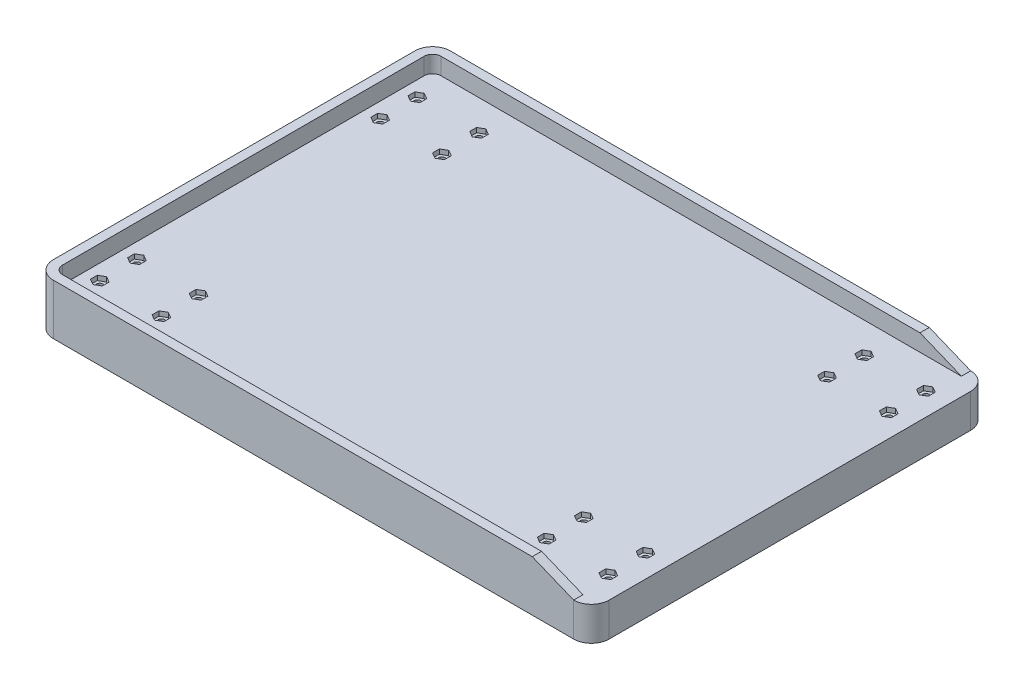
ISO-10303-21;
HEADER;
FILE_DESCRIPTION(('STEP AP214'),'2;1');
FILE_NAME('part.step','',(''),(''),'','','');
FILE_SCHEMA(('AUTOMOTIVE_DESIGN { 1 0 10303 214 1 1 1 1 }'));
ENDSEC;
DATA;
#1=APPLICATION_CONTEXT('core data for automotive mechanical design processes');
#2=APPLICATION_PROTOCOL_DEFINITION('international standard','automotive_design',2000,#1);
#3=PRODUCT_CONTEXT('',#1,'mechanical');
#4=PRODUCT('Part','Part','',(#3));
#5=PRODUCT_RELATED_PRODUCT_CATEGORY('part','',(#4));
#6=PRODUCT_DEFINITION_FORMATION('','',#4);
#7=PRODUCT_DEFINITION_CONTEXT('part definition',#1,'design');
#8=PRODUCT_DEFINITION('design','',#6,#7);
#9=PRODUCT_DEFINITION_SHAPE('','',#8);
#10=(LENGTH_UNIT() NAMED_UNIT(*) SI_UNIT(.MILLI.,.METRE.));
#11=(NAMED_UNIT(*) PLANE_ANGLE_UNIT() SI_UNIT($,.RADIAN.));
#12=(NAMED_UNIT(*) SI_UNIT($,.STERADIAN.) SOLID_ANGLE_UNIT());
#13=UNCERTAINTY_MEASURE_WITH_UNIT(LENGTH_MEASURE(1.E-05),#10,'distance_accuracy_value','');
#14=(GEOMETRIC_REPRESENTATION_CONTEXT(3) GLOBAL_UNCERTAINTY_ASSIGNED_CONTEXT((#13)) GLOBAL_UNIT_ASSIGNED_CONTEXT((#10,
#11,#12)) REPRESENTATION_CONTEXT('',''));
#15=CARTESIAN_POINT('',(0.,0.,0.));
#16=DIRECTION('',(0.,0.,1.));
#17=DIRECTION('',(1.,0.,0.));
#18=AXIS2_PLACEMENT_3D('',#15,#16,#17);
#19=CARTESIAN_POINT('',(329.,60.,-214.));
#20=DIRECTION('',(-1.,0.,0.));
#21=DIRECTION('',(0.,0.,1.));
#22=AXIS2_PLACEMENT_3D('',#19,#20,#21);
#23=PLANE('',#22);
#24=DIRECTION('',(0.,0.,-1.));
#25=VECTOR('',#24,1.);
#26=CARTESIAN_POINT('',(329.,40.,-214.));
#27=LINE('',#26,#25);
#28=CARTESIAN_POINT('',(329.,40.,214.));
#29=VERTEX_POINT('',#28);
#30=CARTESIAN_POINT('',(329.,40.,-214.));
#31=VERTEX_POINT('',#30);
#32=EDGE_CURVE('E1549',#29,#31,#27,.T.);
#33=ORIENTED_EDGE('',*,*,#32,.F.);
#34=DIRECTION('',(0.,-1.,0.));
#35=VECTOR('',#34,1.);
#36=CARTESIAN_POINT('',(329.,60.,214.));
#37=LINE('',#36,#35);
#38=CARTESIAN_POINT('',(329.,0.,214.));
#39=VERTEX_POINT('',#38);
#40=EDGE_CURVE('E1605',#29,#39,#37,.T.);
#41=ORIENTED_EDGE('',*,*,#40,.T.);
#42=DIRECTION('',(0.,0.,-1.));
#43=VECTOR('',#42,1.);
#44=CARTESIAN_POINT('',(329.,0.,-214.));
#45=LINE('',#44,#43);
#46=CARTESIAN_POINT('',(329.,0.,-214.));
#47=VERTEX_POINT('',#46);
#48=EDGE_CURVE('E1582',#39,#47,#45,.T.);
#49=ORIENTED_EDGE('',*,*,#48,.T.);
#50=DIRECTION('',(0.,-1.,0.));
#51=VECTOR('',#50,1.);
#52=CARTESIAN_POINT('',(329.,60.,-214.));
#53=LINE('',#52,#51);
#54=EDGE_CURVE('E1603',#31,#47,#53,.T.);
#55=ORIENTED_EDGE('',*,*,#54,.F.);
#56=EDGE_LOOP('',(#33,#41,#49,#55));
#57=FACE_BOUND('',#56,.T.);
#58=ADVANCED_FACE('F45',(#57),#23,.F.);
#59=CARTESIAN_POINT('',(-308.,60.,214.));
#60=DIRECTION('',(0.,-1.,0.));
#61=DIRECTION('',(0.,0.,-1.));
#62=AXIS2_PLACEMENT_3D('',#59,#60,#61);
#63=CYLINDRICAL_SURFACE('',#62,21.0000000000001);
#64=CARTESIAN_POINT('',(-308.,0.,214.));
#65=DIRECTION('',(0.,1.,0.));
#66=DIRECTION('',(0.,0.,1.));
#67=AXIS2_PLACEMENT_3D('',#64,#65,#66);
#68=CIRCLE('',#67,21.0000000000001);
#69=CARTESIAN_POINT('',(-329.,0.,214.));
#70=VERTEX_POINT('',#69);
#71=CARTESIAN_POINT('',(-308.,0.,235.));
#72=VERTEX_POINT('',#71);
#73=EDGE_CURVE('E1559',#70,#72,#68,.T.);
#74=ORIENTED_EDGE('',*,*,#73,.T.);
#75=DIRECTION('',(0.,-1.,0.));
#76=VECTOR('',#75,1.);
#77=CARTESIAN_POINT('',(-308.,60.,235.));
#78=LINE('',#77,#76);
#79=CARTESIAN_POINT('',(-308.,60.,235.));
#80=VERTEX_POINT('',#79);
#81=EDGE_CURVE('E1609',#80,#72,#78,.T.);
#82=ORIENTED_EDGE('',*,*,#81,.F.);
#83=CARTESIAN_POINT('',(-308.,60.,214.));
#84=DIRECTION('',(0.,1.,0.));
#85=DIRECTION('',(0.,0.,1.));
#86=AXIS2_PLACEMENT_3D('',#83,#84,#85);
#87=CIRCLE('',#86,21.0000000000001);
#88=CARTESIAN_POINT('',(-329.,60.,214.));
#89=VERTEX_POINT('',#88);
#90=EDGE_CURVE('E1560',#89,#80,#87,.T.);
#91=ORIENTED_EDGE('',*,*,#90,.F.);
#92=DIRECTION('',(0.,-1.,0.));
#93=VECTOR('',#92,1.);
#94=CARTESIAN_POINT('',(-329.,60.,214.));
#95=LINE('',#94,#93);
#96=EDGE_CURVE('E1573',#89,#70,#95,.T.);
#97=ORIENTED_EDGE('',*,*,#96,.T.);
#98=EDGE_LOOP('',(#74,#82,#91,#97));
#99=FACE_BOUND('',#98,.T.);
#100=ADVANCED_FACE('F47',(#99),#63,.T.);
#101=CARTESIAN_POINT('',(-308.,60.,235.));
#102=DIRECTION('',(0.,0.,-1.));
#103=DIRECTION('',(-1.,0.,0.));
#104=AXIS2_PLACEMENT_3D('',#101,#102,#103);
#105=PLANE('',#104);
#106=DIRECTION('',(0.,-1.,0.));
#107=VECTOR('',#106,1.);
#108=CARTESIAN_POINT('',(308.,60.,235.));
#109=LINE('',#108,#107);
#110=CARTESIAN_POINT('',(308.,40.,235.));
#111=VERTEX_POINT('',#110);
#112=CARTESIAN_POINT('',(308.,0.,235.));
#113=VERTEX_POINT('',#112);
#114=EDGE_CURVE('E1607',#111,#113,#109,.T.);
#115=ORIENTED_EDGE('',*,*,#114,.F.);
#116=DIRECTION('',(-0.925847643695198,0.377896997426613,0.));
#117=VECTOR('',#116,1.);
#118=CARTESIAN_POINT('',(-227.028918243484,258.379150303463,235.));
#119=LINE('',#118,#117);
#120=CARTESIAN_POINT('',(259.,60.,235.));
#121=VERTEX_POINT('',#120);
#122=EDGE_CURVE('E1517',#111,#121,#119,.T.);
#123=ORIENTED_EDGE('',*,*,#122,.T.);
#124=DIRECTION('',(1.,0.,0.));
#125=VECTOR('',#124,1.);
#126=CARTESIAN_POINT('',(-308.,60.,235.));
#127=LINE('',#126,#125);
#128=EDGE_CURVE('E1563',#80,#121,#127,.T.);
#129=ORIENTED_EDGE('',*,*,#128,.F.);
#130=ORIENTED_EDGE('',*,*,#81,.T.);
#131=DIRECTION('',(1.,0.,0.));
#132=VECTOR('',#131,1.);
#133=CARTESIAN_POINT('',(-308.,0.,235.));
#134=LINE('',#133,#132);
#135=EDGE_CURVE('E1576',#72,#113,#134,.T.);
#136=ORIENTED_EDGE('',*,*,#135,.T.);
#137=EDGE_LOOP('',(#115,#123,#129,#130,#136));
#138=FACE_BOUND('',#137,.T.);
#139=ADVANCED_FACE('F1785',(#138),#105,.F.);
#140=CARTESIAN_POINT('',(308.,60.,214.));
#141=DIRECTION('',(0.,-1.,0.));
#142=DIRECTION('',(0.,0.,-1.));
#143=AXIS2_PLACEMENT_3D('',#140,#141,#142);
#144=CYLINDRICAL_SURFACE('',#143,21.);
#145=CARTESIAN_POINT('',(308.,40.,214.));
#146=DIRECTION('',(0.,1.,0.));
#147=DIRECTION('',(0.,0.,1.));
#148=AXIS2_PLACEMENT_3D('',#145,#146,#147);
#149=CIRCLE('',#148,21.);
#150=EDGE_CURVE('E1557',#111,#29,#149,.T.);
#151=ORIENTED_EDGE('',*,*,#150,.F.);
#152=ORIENTED_EDGE('',*,*,#114,.T.);
#153=CARTESIAN_POINT('',(308.,0.,214.));
#154=DIRECTION('',(0.,1.,0.));
#155=DIRECTION('',(0.,0.,1.));
#156=AXIS2_PLACEMENT_3D('',#153,#154,#155);
#157=CIRCLE('',#156,21.);
#158=EDGE_CURVE('E1579',#113,#39,#157,.T.);
#159=ORIENTED_EDGE('',*,*,#158,.T.);
#160=ORIENTED_EDGE('',*,*,#40,.F.);
#161=EDGE_LOOP('',(#151,#152,#159,#160));
#162=FACE_BOUND('',#161,.T.);
#163=ADVANCED_FACE('F1781',(#162),#144,.T.);
#164=CARTESIAN_POINT('',(308.,60.,-214.));
#165=DIRECTION('',(0.,-1.,0.));
#166=DIRECTION('',(0.,0.,-1.));
#167=AXIS2_PLACEMENT_3D('',#164,#165,#166);
#168=CYLINDRICAL_SURFACE('',#167,21.);
#169=DIRECTION('',(0.,-1.,0.));
#170=VECTOR('',#169,1.);
#171=CARTESIAN_POINT('',(308.,60.,-235.));
#172=LINE('',#171,#170);
#173=CARTESIAN_POINT('',(308.,40.,-235.));
#174=VERTEX_POINT('',#173);
#175=CARTESIAN_POINT('',(308.,0.,-235.));
#176=VERTEX_POINT('',#175);
#177=EDGE_CURVE('E1601',#174,#176,#172,.T.);
#178=ORIENTED_EDGE('',*,*,#177,.F.);
#179=CARTESIAN_POINT('',(308.,40.,-214.));
#180=DIRECTION('',(0.,1.,0.));
#181=DIRECTION('',(0.,0.,1.));
#182=AXIS2_PLACEMENT_3D('',#179,#180,#181);
#183=CIRCLE('',#182,21.);
#184=EDGE_CURVE('E1614',#31,#174,#183,.T.);
#185=ORIENTED_EDGE('',*,*,#184,.F.);
#186=ORIENTED_EDGE('',*,*,#54,.T.);
#187=CARTESIAN_POINT('',(308.,0.,-214.));
#188=DIRECTION('',(0.,1.,0.));
#189=DIRECTION('',(0.,0.,-1.));
#190=AXIS2_PLACEMENT_3D('',#187,#188,#189);
#191=CIRCLE('',#190,21.);
#192=EDGE_CURVE('E1585',#47,#176,#191,.T.);
#193=ORIENTED_EDGE('',*,*,#192,.T.);
#194=EDGE_LOOP('',(#178,#185,#186,#193));
#195=FACE_BOUND('',#194,.T.);
#196=ADVANCED_FACE('F1775',(#195),#168,.T.);
#197=CARTESIAN_POINT('',(-308.,60.,-235.));
#198=DIRECTION('',(0.,0.,1.));
#199=DIRECTION('',(1.,0.,0.));
#200=AXIS2_PLACEMENT_3D('',#197,#198,#199);
#201=PLANE('',#200);
#202=DIRECTION('',(-1.,0.,0.));
#203=VECTOR('',#202,1.);
#204=CARTESIAN_POINT('',(-308.,60.,-235.));
#205=LINE('',#204,#203);
#206=CARTESIAN_POINT('',(259.,60.,-235.));
#207=VERTEX_POINT('',#206);
#208=CARTESIAN_POINT('',(-308.,60.,-235.));
#209=VERTEX_POINT('',#208);
#210=EDGE_CURVE('E1567',#207,#209,#205,.T.);
#211=ORIENTED_EDGE('',*,*,#210,.F.);
#212=DIRECTION('',(0.925847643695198,-0.377896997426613,0.));
#213=VECTOR('',#212,1.);
#214=CARTESIAN_POINT('',(-227.028918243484,258.379150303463,-235.));
#215=LINE('',#214,#213);
#216=EDGE_CURVE('E1514',#207,#174,#215,.T.);
#217=ORIENTED_EDGE('',*,*,#216,.T.);
#218=ORIENTED_EDGE('',*,*,#177,.T.);
#219=DIRECTION('',(-1.,0.,0.));
#220=VECTOR('',#219,1.);
#221=CARTESIAN_POINT('',(-308.,0.,-235.));
#222=LINE('',#221,#220);
#223=CARTESIAN_POINT('',(-308.,0.,-235.));
#224=VERTEX_POINT('',#223);
#225=EDGE_CURVE('E1588',#176,#224,#222,.T.);
#226=ORIENTED_EDGE('',*,*,#225,.T.);
#227=DIRECTION('',(0.,-1.,0.));
#228=VECTOR('',#227,1.);
#229=CARTESIAN_POINT('',(-308.,60.,-235.));
#230=LINE('',#229,#228);
#231=EDGE_CURVE('E1598',#209,#224,#230,.T.);
#232=ORIENTED_EDGE('',*,*,#231,.F.);
#233=EDGE_LOOP('',(#211,#217,#218,#226,#232));
#234=FACE_BOUND('',#233,.T.);
#235=ADVANCED_FACE('F1771',(#234),#201,.F.);
#236=CARTESIAN_POINT('',(-308.,60.,-214.));
#237=DIRECTION('',(0.,-1.,0.));
#238=DIRECTION('',(0.,0.,-1.));
#239=AXIS2_PLACEMENT_3D('',#236,#237,#238);
#240=CYLINDRICAL_SURFACE('',#239,21.0000000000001);
#241=CARTESIAN_POINT('',(-308.,0.,-214.));
#242=DIRECTION('',(0.,1.,0.));
#243=DIRECTION('',(0.,0.,1.));
#244=AXIS2_PLACEMENT_3D('',#241,#242,#243);
#245=CIRCLE('',#244,21.0000000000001);
#246=CARTESIAN_POINT('',(-329.,0.,-214.));
#247=VERTEX_POINT('',#246);
#248=EDGE_CURVE('E1590',#224,#247,#245,.T.);
#249=ORIENTED_EDGE('',*,*,#248,.T.);
#250=DIRECTION('',(0.,-1.,0.));
#251=VECTOR('',#250,1.);
#252=CARTESIAN_POINT('',(-329.,60.,-214.));
#253=LINE('',#252,#251);
#254=CARTESIAN_POINT('',(-329.,60.,-214.));
#255=VERTEX_POINT('',#254);
#256=EDGE_CURVE('E1595',#255,#247,#253,.T.);
#257=ORIENTED_EDGE('',*,*,#256,.F.);
#258=CARTESIAN_POINT('',(-308.,60.,-214.));
#259=DIRECTION('',(0.,1.,0.));
#260=DIRECTION('',(0.,0.,1.));
#261=AXIS2_PLACEMENT_3D('',#258,#259,#260);
#262=CIRCLE('',#261,21.0000000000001);
#263=EDGE_CURVE('E1569',#209,#255,#262,.T.);
#264=ORIENTED_EDGE('',*,*,#263,.F.);
#265=ORIENTED_EDGE('',*,*,#231,.T.);
#266=EDGE_LOOP('',(#249,#257,#264,#265));
#267=FACE_BOUND('',#266,.T.);
#268=ADVANCED_FACE('F1764',(#267),#240,.T.);
#269=CARTESIAN_POINT('',(-329.,60.,-214.));
#270=DIRECTION('',(1.,0.,0.));
#271=DIRECTION('',(0.,0.,-1.));
#272=AXIS2_PLACEMENT_3D('',#269,#270,#271);
#273=PLANE('',#272);
#274=DIRECTION('',(0.,0.,1.));
#275=VECTOR('',#274,1.);
#276=CARTESIAN_POINT('',(-329.,0.,-214.));
#277=LINE('',#276,#275);
#278=EDGE_CURVE('E1564',#247,#70,#277,.T.);
#279=ORIENTED_EDGE('',*,*,#278,.T.);
#280=ORIENTED_EDGE('',*,*,#96,.F.);
#281=DIRECTION('',(0.,0.,1.));
#282=VECTOR('',#281,1.);
#283=CARTESIAN_POINT('',(-329.,60.,-214.));
#284=LINE('',#283,#282);
#285=EDGE_CURVE('E1571',#255,#89,#284,.T.);
#286=ORIENTED_EDGE('',*,*,#285,.F.);
#287=ORIENTED_EDGE('',*,*,#256,.T.);
#288=EDGE_LOOP('',(#279,#280,#286,#287));
#289=FACE_BOUND('',#288,.T.);
#290=ADVANCED_FACE('F1760',(#289),#273,.F.);
#291=CARTESIAN_POINT('',(-308.,60.,214.));
#292=DIRECTION('',(0.,1.,0.));
#293=DIRECTION('',(0.,0.,1.));
#294=AXIS2_PLACEMENT_3D('',#291,#292,#293);
#295=PLANE('',#294);
#296=DIRECTION('',(0.,0.,1.));
#297=VECTOR('',#296,1.);
#298=CARTESIAN_POINT('',(259.,60.,-300.));
#299=LINE('',#298,#297);
#300=CARTESIAN_POINT('',(259.,60.0000000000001,-224.));
#301=VERTEX_POINT('',#300);
#302=EDGE_CURVE('E1509',#207,#301,#299,.T.);
#303=ORIENTED_EDGE('',*,*,#302,.F.);
#304=ORIENTED_EDGE('',*,*,#210,.T.);
#305=ORIENTED_EDGE('',*,*,#263,.T.);
#306=ORIENTED_EDGE('',*,*,#285,.T.);
#307=ORIENTED_EDGE('',*,*,#90,.T.);
#308=ORIENTED_EDGE('',*,*,#128,.T.);
#309=CARTESIAN_POINT('',(259.,60.,224.));
#310=VERTEX_POINT('',#309);
#311=EDGE_CURVE('E1494',#310,#121,#299,.T.);
#312=ORIENTED_EDGE('',*,*,#311,.F.);
#313=DIRECTION('',(1.,0.,0.));
#314=VECTOR('',#313,1.);
#315=CARTESIAN_POINT('',(352.266350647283,60.,224.));
#316=LINE('',#315,#314);
#317=CARTESIAN_POINT('',(-308.,60.,224.));
#318=VERTEX_POINT('',#317);
#319=EDGE_CURVE('E1524',#318,#310,#316,.T.);
#320=ORIENTED_EDGE('',*,*,#319,.F.);
#321=CARTESIAN_POINT('',(-308.,60.,214.));
#322=DIRECTION('',(0.,1.,0.));
#323=DIRECTION('',(0.,0.,1.));
#324=AXIS2_PLACEMENT_3D('',#321,#322,#323);
#325=CIRCLE('',#324,10.0000000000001);
#326=CARTESIAN_POINT('',(-318.,60.,214.));
#327=VERTEX_POINT('',#326);
#328=EDGE_CURVE('E1542',#327,#318,#325,.T.);
#329=ORIENTED_EDGE('',*,*,#328,.F.);
#330=DIRECTION('',(0.,0.,1.));
#331=VECTOR('',#330,1.);
#332=CARTESIAN_POINT('',(-318.,60.,-214.));
#333=LINE('',#332,#331);
#334=CARTESIAN_POINT('',(-318.,60.,-214.));
#335=VERTEX_POINT('',#334);
#336=EDGE_CURVE('E1539',#335,#327,#333,.T.);
#337=ORIENTED_EDGE('',*,*,#336,.F.);
#338=CARTESIAN_POINT('',(-308.,60.,-214.));
#339=DIRECTION('',(0.,1.,0.));
#340=DIRECTION('',(0.,0.,1.));
#341=AXIS2_PLACEMENT_3D('',#338,#339,#340);
#342=CIRCLE('',#341,10.0000000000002);
#343=CARTESIAN_POINT('',(-308.,60.,-224.));
#344=VERTEX_POINT('',#343);
#345=EDGE_CURVE('E1520',#344,#335,#342,.T.);
#346=ORIENTED_EDGE('',*,*,#345,.F.);
#347=DIRECTION('',(-1.,0.,0.));
#348=VECTOR('',#347,1.);
#349=CARTESIAN_POINT('',(-308.,60.,-224.));
#350=LINE('',#349,#348);
#351=EDGE_CURVE('E1612',#301,#344,#350,.T.);
#352=ORIENTED_EDGE('',*,*,#351,.F.);
#353=EDGE_LOOP('',(#303,#304,#305,#306,#307,#308,#312,#320,#329,#337,#346,#352));
#354=FACE_BOUND('',#353,.T.);
#355=ADVANCED_FACE('F1695',(#354),#295,.T.);
#356=CARTESIAN_POINT('',(-308.,0.,214.));
#357=DIRECTION('',(0.,1.,0.));
#358=DIRECTION('',(0.,0.,1.));
#359=AXIS2_PLACEMENT_3D('',#356,#357,#358);
#360=PLANE('',#359);
#361=CARTESIAN_POINT('',(265.5,0.,166.));
#362=DIRECTION('',(0.,1.,0.));
#363=DIRECTION('',(0.,0.,1.));
#364=AXIS2_PLACEMENT_3D('',#361,#362,#363);
#365=CIRCLE('',#364,2.);
#366=CARTESIAN_POINT('',(265.5,0.,168.));
#367=VERTEX_POINT('',#366);
#368=EDGE_CURVE('E13',#367,#367,#365,.F.);
#369=ORIENTED_EDGE('',*,*,#368,.F.);
#370=EDGE_LOOP('',(#369));
#371=FACE_BOUND('',#370,.T.);
#372=CARTESIAN_POINT('',(265.5,0.,-166.));
#373=DIRECTION('',(0.,1.,0.));
#374=DIRECTION('',(0.,0.,1.));
#375=AXIS2_PLACEMENT_3D('',#372,#373,#374);
#376=CIRCLE('',#375,2.);
#377=CARTESIAN_POINT('',(265.5,0.,-164.));
#378=VERTEX_POINT('',#377);
#379=EDGE_CURVE('E53',#378,#378,#376,.F.);
#380=ORIENTED_EDGE('',*,*,#379,.F.);
#381=EDGE_LOOP('',(#380));
#382=FACE_BOUND('',#381,.T.);
#383=CARTESIAN_POINT('',(-263.5,0.,-166.));
#384=DIRECTION('',(0.,1.,0.));
#385=DIRECTION('',(0.,0.,1.));
#386=AXIS2_PLACEMENT_3D('',#383,#384,#385);
#387=CIRCLE('',#386,2.);
#388=CARTESIAN_POINT('',(-263.5,0.,-164.));
#389=VERTEX_POINT('',#388);
#390=EDGE_CURVE('E1684',#389,#389,#387,.F.);
#391=ORIENTED_EDGE('',*,*,#390,.F.);
#392=EDGE_LOOP('',(#391));
#393=FACE_BOUND('',#392,.T.);
#394=CARTESIAN_POINT('',(-263.5,0.,166.));
#395=DIRECTION('',(0.,1.,0.));
#396=DIRECTION('',(0.,0.,1.));
#397=AXIS2_PLACEMENT_3D('',#394,#395,#396);
#398=CIRCLE('',#397,2.);
#399=CARTESIAN_POINT('',(-263.5,0.,168.));
#400=VERTEX_POINT('',#399);
#401=EDGE_CURVE('E1619',#400,#400,#398,.F.);
#402=ORIENTED_EDGE('',*,*,#401,.F.);
#403=EDGE_LOOP('',(#402));
#404=FACE_BOUND('',#403,.T.);
#405=CARTESIAN_POINT('',(302.,0.,-188.));
#406=DIRECTION('',(0.,1.,0.));
#407=DIRECTION('',(0.,0.,1.));
#408=AXIS2_PLACEMENT_3D('',#405,#406,#407);
#409=CIRCLE('',#408,3.99999999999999);
#410=CARTESIAN_POINT('',(302.,0.,-184.));
#411=VERTEX_POINT('',#410);
#412=EDGE_CURVE('E1681',#411,#411,#409,.T.);
#413=ORIENTED_EDGE('',*,*,#412,.T.);
#414=EDGE_LOOP('',(#413));
#415=FACE_BOUND('',#414,.T.);
#416=CARTESIAN_POINT('',(302.,0.,-144.));
#417=DIRECTION('',(0.,1.,0.));
#418=DIRECTION('',(0.,0.,1.));
#419=AXIS2_PLACEMENT_3D('',#416,#417,#418);
#420=CIRCLE('',#419,3.99999999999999);
#421=CARTESIAN_POINT('',(302.,0.,-140.));
#422=VERTEX_POINT('',#421);
#423=EDGE_CURVE('E1677',#422,#422,#420,.T.);
#424=ORIENTED_EDGE('',*,*,#423,.T.);
#425=EDGE_LOOP('',(#424));
#426=FACE_BOUND('',#425,.T.);
#427=CARTESIAN_POINT('',(229.,0.,-144.));
#428=DIRECTION('',(0.,1.,0.));
#429=DIRECTION('',(0.,0.,1.));
#430=AXIS2_PLACEMENT_3D('',#427,#428,#429);
#431=CIRCLE('',#430,3.99999999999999);
#432=CARTESIAN_POINT('',(229.,0.,-140.));
#433=VERTEX_POINT('',#432);
#434=EDGE_CURVE('E1673',#433,#433,#431,.T.);
#435=ORIENTED_EDGE('',*,*,#434,.T.);
#436=EDGE_LOOP('',(#435));
#437=FACE_BOUND('',#436,.T.);
#438=CARTESIAN_POINT('',(229.,0.,-188.));
#439=DIRECTION('',(0.,1.,0.));
#440=DIRECTION('',(0.,0.,1.));
#441=AXIS2_PLACEMENT_3D('',#438,#439,#440);
#442=CIRCLE('',#441,3.99999999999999);
#443=CARTESIAN_POINT('',(229.,0.,-184.));
#444=VERTEX_POINT('',#443);
#445=EDGE_CURVE('E1669',#444,#444,#442,.T.);
#446=ORIENTED_EDGE('',*,*,#445,.T.);
#447=EDGE_LOOP('',(#446));
#448=FACE_BOUND('',#447,.T.);
#449=CARTESIAN_POINT('',(302.,0.,144.));
#450=DIRECTION('',(0.,1.,0.));
#451=DIRECTION('',(0.,0.,1.));
#452=AXIS2_PLACEMENT_3D('',#449,#450,#451);
#453=CIRCLE('',#452,3.99999999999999);
#454=CARTESIAN_POINT('',(302.,0.,148.));
#455=VERTEX_POINT('',#454);
#456=EDGE_CURVE('E1665',#455,#455,#453,.T.);
#457=ORIENTED_EDGE('',*,*,#456,.T.);
#458=EDGE_LOOP('',(#457));
#459=FACE_BOUND('',#458,.T.);
#460=CARTESIAN_POINT('',(302.,0.,188.));
#461=DIRECTION('',(0.,1.,0.));
#462=DIRECTION('',(0.,0.,1.));
#463=AXIS2_PLACEMENT_3D('',#460,#461,#462);
#464=CIRCLE('',#463,3.99999999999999);
#465=CARTESIAN_POINT('',(302.,0.,192.));
#466=VERTEX_POINT('',#465);
#467=EDGE_CURVE('E1661',#466,#466,#464,.T.);
#468=ORIENTED_EDGE('',*,*,#467,.T.);
#469=EDGE_LOOP('',(#468));
#470=FACE_BOUND('',#469,.T.);
#471=CARTESIAN_POINT('',(229.,0.,188.));
#472=DIRECTION('',(0.,1.,0.));
#473=DIRECTION('',(0.,0.,1.));
#474=AXIS2_PLACEMENT_3D('',#471,#472,#473);
#475=CIRCLE('',#474,3.99999999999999);
#476=CARTESIAN_POINT('',(229.,0.,192.));
#477=VERTEX_POINT('',#476);
#478=EDGE_CURVE('E1657',#477,#477,#475,.T.);
#479=ORIENTED_EDGE('',*,*,#478,.T.);
#480=EDGE_LOOP('',(#479));
#481=FACE_BOUND('',#480,.T.);
#482=CARTESIAN_POINT('',(229.,0.,144.));
#483=DIRECTION('',(0.,1.,0.));
#484=DIRECTION('',(0.,0.,1.));
#485=AXIS2_PLACEMENT_3D('',#482,#483,#484);
#486=CIRCLE('',#485,3.99999999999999);
#487=CARTESIAN_POINT('',(229.,0.,148.));
#488=VERTEX_POINT('',#487);
#489=EDGE_CURVE('E1653',#488,#488,#486,.T.);
#490=ORIENTED_EDGE('',*,*,#489,.T.);
#491=EDGE_LOOP('',(#490));
#492=FACE_BOUND('',#491,.T.);
#493=CARTESIAN_POINT('',(-227.,0.,144.));
#494=DIRECTION('',(0.,1.,0.));
#495=DIRECTION('',(0.,0.,1.));
#496=AXIS2_PLACEMENT_3D('',#493,#494,#495);
#497=CIRCLE('',#496,3.99999999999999);
#498=CARTESIAN_POINT('',(-227.,0.,148.));
#499=VERTEX_POINT('',#498);
#500=EDGE_CURVE('E1649',#499,#499,#497,.T.);
#501=ORIENTED_EDGE('',*,*,#500,.T.);
#502=EDGE_LOOP('',(#501));
#503=FACE_BOUND('',#502,.T.);
#504=CARTESIAN_POINT('',(-227.,0.,188.));
#505=DIRECTION('',(0.,1.,0.));
#506=DIRECTION('',(0.,0.,1.));
#507=AXIS2_PLACEMENT_3D('',#504,#505,#506);
#508=CIRCLE('',#507,3.99999999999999);
#509=CARTESIAN_POINT('',(-227.,0.,192.));
#510=VERTEX_POINT('',#509);
#511=EDGE_CURVE('E1645',#510,#510,#508,.T.);
#512=ORIENTED_EDGE('',*,*,#511,.T.);
#513=EDGE_LOOP('',(#512));
#514=FACE_BOUND('',#513,.T.);
#515=CARTESIAN_POINT('',(-300.,0.,188.));
#516=DIRECTION('',(0.,1.,0.));
#517=DIRECTION('',(0.,0.,1.));
#518=AXIS2_PLACEMENT_3D('',#515,#516,#517);
#519=CIRCLE('',#518,3.99999999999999);
#520=CARTESIAN_POINT('',(-300.,0.,192.));
#521=VERTEX_POINT('',#520);
#522=EDGE_CURVE('E1641',#521,#521,#519,.T.);
#523=ORIENTED_EDGE('',*,*,#522,.T.);
#524=EDGE_LOOP('',(#523));
#525=FACE_BOUND('',#524,.T.);
#526=CARTESIAN_POINT('',(-300.,0.,144.));
#527=DIRECTION('',(0.,1.,0.));
#528=DIRECTION('',(0.,0.,1.));
#529=AXIS2_PLACEMENT_3D('',#526,#527,#528);
#530=CIRCLE('',#529,3.99999999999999);
#531=CARTESIAN_POINT('',(-300.,0.,148.));
#532=VERTEX_POINT('',#531);
#533=EDGE_CURVE('E1637',#532,#532,#530,.T.);
#534=ORIENTED_EDGE('',*,*,#533,.T.);
#535=EDGE_LOOP('',(#534));
#536=FACE_BOUND('',#535,.T.);
#537=CARTESIAN_POINT('',(-227.,0.,-188.));
#538=DIRECTION('',(0.,1.,0.));
#539=DIRECTION('',(0.,0.,1.));
#540=AXIS2_PLACEMENT_3D('',#537,#538,#539);
#541=CIRCLE('',#540,3.99999999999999);
#542=CARTESIAN_POINT('',(-227.,0.,-184.));
#543=VERTEX_POINT('',#542);
#544=EDGE_CURVE('E1633',#543,#543,#541,.T.);
#545=ORIENTED_EDGE('',*,*,#544,.T.);
#546=EDGE_LOOP('',(#545));
#547=FACE_BOUND('',#546,.T.);
#548=CARTESIAN_POINT('',(-227.,0.,-144.));
#549=DIRECTION('',(0.,1.,0.));
#550=DIRECTION('',(0.,0.,1.));
#551=AXIS2_PLACEMENT_3D('',#548,#549,#550);
#552=CIRCLE('',#551,3.99999999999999);
#553=CARTESIAN_POINT('',(-227.,0.,-140.));
#554=VERTEX_POINT('',#553);
#555=EDGE_CURVE('E1629',#554,#554,#552,.T.);
#556=ORIENTED_EDGE('',*,*,#555,.T.);
#557=EDGE_LOOP('',(#556));
#558=FACE_BOUND('',#557,.T.);
#559=CARTESIAN_POINT('',(-300.,0.,-144.));
#560=DIRECTION('',(0.,1.,0.));
#561=DIRECTION('',(0.,0.,1.));
#562=AXIS2_PLACEMENT_3D('',#559,#560,#561);
#563=CIRCLE('',#562,3.99999999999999);
#564=CARTESIAN_POINT('',(-300.,0.,-140.));
#565=VERTEX_POINT('',#564);
#566=EDGE_CURVE('E1625',#565,#565,#563,.T.);
#567=ORIENTED_EDGE('',*,*,#566,.T.);
#568=EDGE_LOOP('',(#567));
#569=FACE_BOUND('',#568,.T.);
#570=CARTESIAN_POINT('',(-300.,0.,-188.));
#571=DIRECTION('',(0.,1.,0.));
#572=DIRECTION('',(0.,0.,1.));
#573=AXIS2_PLACEMENT_3D('',#570,#571,#572);
#574=CIRCLE('',#573,3.99999999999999);
#575=CARTESIAN_POINT('',(-300.,0.,-184.));
#576=VERTEX_POINT('',#575);
#577=EDGE_CURVE('E755',#576,#576,#574,.T.);
#578=ORIENTED_EDGE('',*,*,#577,.T.);
#579=EDGE_LOOP('',(#578));
#580=FACE_BOUND('',#579,.T.);
#581=ORIENTED_EDGE('',*,*,#73,.F.);
#582=ORIENTED_EDGE('',*,*,#278,.F.);
#583=ORIENTED_EDGE('',*,*,#248,.F.);
#584=ORIENTED_EDGE('',*,*,#225,.F.);
#585=ORIENTED_EDGE('',*,*,#192,.F.);
#586=ORIENTED_EDGE('',*,*,#48,.F.);
#587=ORIENTED_EDGE('',*,*,#158,.F.);
#588=ORIENTED_EDGE('',*,*,#135,.F.);
#589=EDGE_LOOP('',(#581,#582,#583,#584,#585,#586,#587,#588));
#590=FACE_BOUND('',#589,.T.);
#591=ADVANCED_FACE('F1691',(#371,#382,#393,#404,#415,#426,#437,#448,#459,#470,#481,#492,#503,
#514,#525,#536,#547,#558,#569,#580,#590),#360,.F.);
#592=CARTESIAN_POINT('',(-308.,40.,214.));
#593=DIRECTION('',(0.,1.,0.));
#594=DIRECTION('',(0.,0.,1.));
#595=AXIS2_PLACEMENT_3D('',#592,#593,#594);
#596=PLANE('',#595);
#597=DIRECTION('',(0.,0.,-1.));
#598=VECTOR('',#597,1.);
#599=CARTESIAN_POINT('',(309.,40.,192.041451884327));
#600=LINE('',#599,#598);
#601=CARTESIAN_POINT('',(309.,40.,192.041451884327));
#602=VERTEX_POINT('',#601);
#603=CARTESIAN_POINT('',(309.,40.,183.958548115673));
#604=VERTEX_POINT('',#603);
#605=EDGE_CURVE('E60',#602,#604,#600,.T.);
#606=ORIENTED_EDGE('',*,*,#605,.F.);
#607=DIRECTION('',(0.866025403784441,0.,-0.499999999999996));
#608=VECTOR('',#607,1.);
#609=CARTESIAN_POINT('',(302.,40.,196.082903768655));
#610=LINE('',#609,#608);
#611=CARTESIAN_POINT('',(302.,40.,196.082903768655));
#612=VERTEX_POINT('',#611);
#613=EDGE_CURVE('E749',#612,#602,#610,.T.);
#614=ORIENTED_EDGE('',*,*,#613,.F.);
#615=DIRECTION('',(0.866025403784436,0.,0.500000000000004));
#616=VECTOR('',#615,1.);
#617=CARTESIAN_POINT('',(295.,40.,192.041451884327));
#618=LINE('',#617,#616);
#619=CARTESIAN_POINT('',(295.,40.,192.041451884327));
#620=VERTEX_POINT('',#619);
#621=EDGE_CURVE('E752',#620,#612,#618,.T.);
#622=ORIENTED_EDGE('',*,*,#621,.F.);
#623=DIRECTION('',(0.,0.,1.));
#624=VECTOR('',#623,1.);
#625=CARTESIAN_POINT('',(295.,40.,183.958548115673));
#626=LINE('',#625,#624);
#627=CARTESIAN_POINT('',(295.,40.,183.958548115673));
#628=VERTEX_POINT('',#627);
#629=EDGE_CURVE('E772',#628,#620,#626,.T.);
#630=ORIENTED_EDGE('',*,*,#629,.F.);
#631=DIRECTION('',(-0.866025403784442,0.,0.499999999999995));
#632=VECTOR('',#631,1.);
#633=CARTESIAN_POINT('',(302.,40.,179.917096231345));
#634=LINE('',#633,#632);
#635=CARTESIAN_POINT('',(302.,40.,179.917096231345));
#636=VERTEX_POINT('',#635);
#637=EDGE_CURVE('E769',#636,#628,#634,.T.);
#638=ORIENTED_EDGE('',*,*,#637,.F.);
#639=DIRECTION('',(-0.866025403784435,0.,-0.500000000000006));
#640=VECTOR('',#639,1.);
#641=CARTESIAN_POINT('',(309.,40.,183.958548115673));
#642=LINE('',#641,#640);
#643=EDGE_CURVE('E766',#604,#636,#642,.T.);
#644=ORIENTED_EDGE('',*,*,#643,.F.);
#645=EDGE_LOOP('',(#606,#614,#622,#630,#638,#644));
#646=FACE_BOUND('',#645,.T.);
#647=DIRECTION('',(0.,0.,-1.));
#648=VECTOR('',#647,1.);
#649=CARTESIAN_POINT('',(309.,40.,148.041451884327));
#650=LINE('',#649,#648);
#651=CARTESIAN_POINT('',(309.,40.,148.041451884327));
#652=VERTEX_POINT('',#651);
#653=CARTESIAN_POINT('',(309.,40.,139.958548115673));
#654=VERTEX_POINT('',#653);
#655=EDGE_CURVE('E68',#652,#654,#650,.T.);
#656=ORIENTED_EDGE('',*,*,#655,.F.);
#657=DIRECTION('',(0.866025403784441,0.,-0.499999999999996));
#658=VECTOR('',#657,1.);
#659=CARTESIAN_POINT('',(302.,40.,152.082903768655));
#660=LINE('',#659,#658);
#661=CARTESIAN_POINT('',(302.,40.,152.082903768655));
#662=VERTEX_POINT('',#661);
#663=EDGE_CURVE('E790',#662,#652,#660,.T.);
#664=ORIENTED_EDGE('',*,*,#663,.F.);
#665=DIRECTION('',(0.866025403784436,0.,0.500000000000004));
#666=VECTOR('',#665,1.);
#667=CARTESIAN_POINT('',(295.,40.,148.041451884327));
#668=LINE('',#667,#666);
#669=CARTESIAN_POINT('',(295.,40.,148.041451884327));
#670=VERTEX_POINT('',#669);
#671=EDGE_CURVE('E816',#670,#662,#668,.T.);
#672=ORIENTED_EDGE('',*,*,#671,.F.);
#673=DIRECTION('',(0.,0.,1.));
#674=VECTOR('',#673,1.);
#675=CARTESIAN_POINT('',(295.,40.,139.958548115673));
#676=LINE('',#675,#674);
#677=CARTESIAN_POINT('',(295.,40.,139.958548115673));
#678=VERTEX_POINT('',#677);
#679=EDGE_CURVE('E813',#678,#670,#676,.T.);
#680=ORIENTED_EDGE('',*,*,#679,.F.);
#681=DIRECTION('',(-0.866025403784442,0.,0.499999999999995));
#682=VECTOR('',#681,1.);
#683=CARTESIAN_POINT('',(302.,40.,135.917096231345));
#684=LINE('',#683,#682);
#685=CARTESIAN_POINT('',(302.,40.,135.917096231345));
#686=VERTEX_POINT('',#685);
#687=EDGE_CURVE('E810',#686,#678,#684,.T.);
#688=ORIENTED_EDGE('',*,*,#687,.F.);
#689=DIRECTION('',(-0.866025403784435,0.,-0.500000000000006));
#690=VECTOR('',#689,1.);
#691=CARTESIAN_POINT('',(309.,40.,139.958548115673));
#692=LINE('',#691,#690);
#693=EDGE_CURVE('E807',#654,#686,#692,.T.);
#694=ORIENTED_EDGE('',*,*,#693,.F.);
#695=EDGE_LOOP('',(#656,#664,#672,#680,#688,#694));
#696=FACE_BOUND('',#695,.T.);
#697=DIRECTION('',(0.,0.,-1.));
#698=VECTOR('',#697,1.);
#699=CARTESIAN_POINT('',(236.,40.,192.041451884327));
#700=LINE('',#699,#698);
#701=CARTESIAN_POINT('',(236.,40.,192.041451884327));
#702=VERTEX_POINT('',#701);
#703=CARTESIAN_POINT('',(236.,40.,183.958548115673));
#704=VERTEX_POINT('',#703);
#705=EDGE_CURVE('E823',#702,#704,#700,.T.);
#706=ORIENTED_EDGE('',*,*,#705,.F.);
#707=DIRECTION('',(0.866025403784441,0.,-0.499999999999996));
#708=VECTOR('',#707,1.);
#709=CARTESIAN_POINT('',(229.,40.,196.082903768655));
#710=LINE('',#709,#708);
#711=CARTESIAN_POINT('',(229.,40.,196.082903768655));
#712=VERTEX_POINT('',#711);
#713=EDGE_CURVE('E837',#712,#702,#710,.T.);
#714=ORIENTED_EDGE('',*,*,#713,.F.);
#715=DIRECTION('',(0.866025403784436,0.,0.500000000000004));
#716=VECTOR('',#715,1.);
#717=CARTESIAN_POINT('',(222.,40.,192.041451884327));
#718=LINE('',#717,#716);
#719=CARTESIAN_POINT('',(222.,40.,192.041451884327));
#720=VERTEX_POINT('',#719);
#721=EDGE_CURVE('E863',#720,#712,#718,.T.);
#722=ORIENTED_EDGE('',*,*,#721,.F.);
#723=DIRECTION('',(0.,0.,1.));
#724=VECTOR('',#723,1.);
#725=CARTESIAN_POINT('',(222.,40.,183.958548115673));
#726=LINE('',#725,#724);
#727=CARTESIAN_POINT('',(222.,40.,183.958548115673));
#728=VERTEX_POINT('',#727);
#729=EDGE_CURVE('E860',#728,#720,#726,.T.);
#730=ORIENTED_EDGE('',*,*,#729,.F.);
#731=DIRECTION('',(-0.866025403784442,0.,0.499999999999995));
#732=VECTOR('',#731,1.);
#733=CARTESIAN_POINT('',(229.,40.,179.917096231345));
#734=LINE('',#733,#732);
#735=CARTESIAN_POINT('',(229.,40.,179.917096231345));
#736=VERTEX_POINT('',#735);
#737=EDGE_CURVE('E857',#736,#728,#734,.T.);
#738=ORIENTED_EDGE('',*,*,#737,.F.);
#739=DIRECTION('',(-0.866025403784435,0.,-0.500000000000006));
#740=VECTOR('',#739,1.);
#741=CARTESIAN_POINT('',(236.,40.,183.958548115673));
#742=LINE('',#741,#740);
#743=EDGE_CURVE('E854',#704,#736,#742,.T.);
#744=ORIENTED_EDGE('',*,*,#743,.F.);
#745=EDGE_LOOP('',(#706,#714,#722,#730,#738,#744));
#746=FACE_BOUND('',#745,.T.);
#747=DIRECTION('',(0.,0.,-1.));
#748=VECTOR('',#747,1.);
#749=CARTESIAN_POINT('',(236.,40.,148.041451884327));
#750=LINE('',#749,#748);
#751=CARTESIAN_POINT('',(236.,40.,148.041451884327));
#752=VERTEX_POINT('',#751);
#753=CARTESIAN_POINT('',(236.,40.,139.958548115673));
#754=VERTEX_POINT('',#753);
#755=EDGE_CURVE('E870',#752,#754,#750,.T.);
#756=ORIENTED_EDGE('',*,*,#755,.F.);
#757=DIRECTION('',(0.866025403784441,0.,-0.499999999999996));
#758=VECTOR('',#757,1.);
#759=CARTESIAN_POINT('',(229.,40.,152.082903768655));
#760=LINE('',#759,#758);
#761=CARTESIAN_POINT('',(229.,40.,152.082903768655));
#762=VERTEX_POINT('',#761);
#763=EDGE_CURVE('E885',#762,#752,#760,.T.);
#764=ORIENTED_EDGE('',*,*,#763,.F.);
#765=DIRECTION('',(0.866025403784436,0.,0.500000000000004));
#766=VECTOR('',#765,1.);
#767=CARTESIAN_POINT('',(222.,40.,148.041451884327));
#768=LINE('',#767,#766);
#769=CARTESIAN_POINT('',(222.,40.,148.041451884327));
#770=VERTEX_POINT('',#769);
#771=EDGE_CURVE('E911',#770,#762,#768,.T.);
#772=ORIENTED_EDGE('',*,*,#771,.F.);
#773=DIRECTION('',(0.,0.,1.));
#774=VECTOR('',#773,1.);
#775=CARTESIAN_POINT('',(222.,40.,139.958548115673));
#776=LINE('',#775,#774);
#777=CARTESIAN_POINT('',(222.,40.,139.958548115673));
#778=VERTEX_POINT('',#777);
#779=EDGE_CURVE('E908',#778,#770,#776,.T.);
#780=ORIENTED_EDGE('',*,*,#779,.F.);
#781=DIRECTION('',(-0.866025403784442,0.,0.499999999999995));
#782=VECTOR('',#781,1.);
#783=CARTESIAN_POINT('',(229.,40.,135.917096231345));
#784=LINE('',#783,#782);
#785=CARTESIAN_POINT('',(229.,40.,135.917096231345));
#786=VERTEX_POINT('',#785);
#787=EDGE_CURVE('E905',#786,#778,#784,.T.);
#788=ORIENTED_EDGE('',*,*,#787,.F.);
#789=DIRECTION('',(-0.866025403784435,0.,-0.500000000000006));
#790=VECTOR('',#789,1.);
#791=CARTESIAN_POINT('',(236.,40.,139.958548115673));
#792=LINE('',#791,#790);
#793=EDGE_CURVE('E902',#754,#786,#792,.T.);
#794=ORIENTED_EDGE('',*,*,#793,.F.);
#795=EDGE_LOOP('',(#756,#764,#772,#780,#788,#794));
#796=FACE_BOUND('',#795,.T.);
#797=DIRECTION('',(0.,0.,-1.));
#798=VECTOR('',#797,1.);
#799=CARTESIAN_POINT('',(-220.,40.,192.041451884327));
#800=LINE('',#799,#798);
#801=CARTESIAN_POINT('',(-220.,40.,192.041451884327));
#802=VERTEX_POINT('',#801);
#803=CARTESIAN_POINT('',(-220.,40.,183.958548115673));
#804=VERTEX_POINT('',#803);
#805=EDGE_CURVE('E918',#802,#804,#800,.T.);
#806=ORIENTED_EDGE('',*,*,#805,.F.);
#807=DIRECTION('',(0.866025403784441,0.,-0.499999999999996));
#808=VECTOR('',#807,1.);
#809=CARTESIAN_POINT('',(-227.,40.,196.082903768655));
#810=LINE('',#809,#808);
#811=CARTESIAN_POINT('',(-227.,40.,196.082903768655));
#812=VERTEX_POINT('',#811);
#813=EDGE_CURVE('E933',#812,#802,#810,.T.);
#814=ORIENTED_EDGE('',*,*,#813,.F.);
#815=DIRECTION('',(0.866025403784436,0.,0.500000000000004));
#816=VECTOR('',#815,1.);
#817=CARTESIAN_POINT('',(-234.,40.,192.041451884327));
#818=LINE('',#817,#816);
#819=CARTESIAN_POINT('',(-234.,40.,192.041451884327));
#820=VERTEX_POINT('',#819);
#821=EDGE_CURVE('E959',#820,#812,#818,.T.);
#822=ORIENTED_EDGE('',*,*,#821,.F.);
#823=DIRECTION('',(0.,0.,1.));
#824=VECTOR('',#823,1.);
#825=CARTESIAN_POINT('',(-234.,40.,183.958548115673));
#826=LINE('',#825,#824);
#827=CARTESIAN_POINT('',(-234.,40.,183.958548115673));
#828=VERTEX_POINT('',#827);
#829=EDGE_CURVE('E956',#828,#820,#826,.T.);
#830=ORIENTED_EDGE('',*,*,#829,.F.);
#831=DIRECTION('',(-0.866025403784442,0.,0.499999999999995));
#832=VECTOR('',#831,1.);
#833=CARTESIAN_POINT('',(-227.,40.,179.917096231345));
#834=LINE('',#833,#832);
#835=CARTESIAN_POINT('',(-227.,40.,179.917096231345));
#836=VERTEX_POINT('',#835);
#837=EDGE_CURVE('E953',#836,#828,#834,.T.);
#838=ORIENTED_EDGE('',*,*,#837,.F.);
#839=DIRECTION('',(-0.866025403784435,0.,-0.500000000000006));
#840=VECTOR('',#839,1.);
#841=CARTESIAN_POINT('',(-220.,40.,183.958548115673));
#842=LINE('',#841,#840);
#843=EDGE_CURVE('E950',#804,#836,#842,.T.);
#844=ORIENTED_EDGE('',*,*,#843,.F.);
#845=EDGE_LOOP('',(#806,#814,#822,#830,#838,#844));
#846=FACE_BOUND('',#845,.T.);
#847=DIRECTION('',(0.,0.,-1.));
#848=VECTOR('',#847,1.);
#849=CARTESIAN_POINT('',(-293.,40.,192.041451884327));
#850=LINE('',#849,#848);
#851=CARTESIAN_POINT('',(-293.,40.,192.041451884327));
#852=VERTEX_POINT('',#851);
#853=CARTESIAN_POINT('',(-293.,40.,183.958548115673));
#854=VERTEX_POINT('',#853);
#855=EDGE_CURVE('E966',#852,#854,#850,.T.);
#856=ORIENTED_EDGE('',*,*,#855,.F.);
#857=DIRECTION('',(0.866025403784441,0.,-0.499999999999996));
#858=VECTOR('',#857,1.);
#859=CARTESIAN_POINT('',(-300.,40.,196.082903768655));
#860=LINE('',#859,#858);
#861=CARTESIAN_POINT('',(-300.,40.,196.082903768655));
#862=VERTEX_POINT('',#861);
#863=EDGE_CURVE('E981',#862,#852,#860,.T.);
#864=ORIENTED_EDGE('',*,*,#863,.F.);
#865=DIRECTION('',(0.866025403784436,0.,0.500000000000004));
#866=VECTOR('',#865,1.);
#867=CARTESIAN_POINT('',(-307.,40.,192.041451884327));
#868=LINE('',#867,#866);
#869=CARTESIAN_POINT('',(-307.,40.,192.041451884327));
#870=VERTEX_POINT('',#869);
#871=EDGE_CURVE('E1007',#870,#862,#868,.T.);
#872=ORIENTED_EDGE('',*,*,#871,.F.);
#873=DIRECTION('',(0.,0.,1.));
#874=VECTOR('',#873,1.);
#875=CARTESIAN_POINT('',(-307.,40.,183.958548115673));
#876=LINE('',#875,#874);
#877=CARTESIAN_POINT('',(-307.,40.,183.958548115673));
#878=VERTEX_POINT('',#877);
#879=EDGE_CURVE('E1004',#878,#870,#876,.T.);
#880=ORIENTED_EDGE('',*,*,#879,.F.);
#881=DIRECTION('',(-0.866025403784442,0.,0.499999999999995));
#882=VECTOR('',#881,1.);
#883=CARTESIAN_POINT('',(-300.,40.,179.917096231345));
#884=LINE('',#883,#882);
#885=CARTESIAN_POINT('',(-300.,40.,179.917096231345));
#886=VERTEX_POINT('',#885);
#887=EDGE_CURVE('E1001',#886,#878,#884,.T.);
#888=ORIENTED_EDGE('',*,*,#887,.F.);
#889=DIRECTION('',(-0.866025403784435,0.,-0.500000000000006));
#890=VECTOR('',#889,1.);
#891=CARTESIAN_POINT('',(-293.,40.,183.958548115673));
#892=LINE('',#891,#890);
#893=EDGE_CURVE('E998',#854,#886,#892,.T.);
#894=ORIENTED_EDGE('',*,*,#893,.F.);
#895=EDGE_LOOP('',(#856,#864,#872,#880,#888,#894));
#896=FACE_BOUND('',#895,.T.);
#897=DIRECTION('',(0.,0.,-1.));
#898=VECTOR('',#897,1.);
#899=CARTESIAN_POINT('',(-220.,40.,148.041451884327));
#900=LINE('',#899,#898);
#901=CARTESIAN_POINT('',(-220.,40.,148.041451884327));
#902=VERTEX_POINT('',#901);
#903=CARTESIAN_POINT('',(-220.,40.,139.958548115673));
#904=VERTEX_POINT('',#903);
#905=EDGE_CURVE('E1014',#902,#904,#900,.T.);
#906=ORIENTED_EDGE('',*,*,#905,.F.);
#907=DIRECTION('',(0.866025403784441,0.,-0.499999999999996));
#908=VECTOR('',#907,1.);
#909=CARTESIAN_POINT('',(-227.,40.,152.082903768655));
#910=LINE('',#909,#908);
#911=CARTESIAN_POINT('',(-227.,40.,152.082903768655));
#912=VERTEX_POINT('',#911);
#913=EDGE_CURVE('E1029',#912,#902,#910,.T.);
#914=ORIENTED_EDGE('',*,*,#913,.F.);
#915=DIRECTION('',(0.866025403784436,0.,0.500000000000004));
#916=VECTOR('',#915,1.);
#917=CARTESIAN_POINT('',(-234.,40.,148.041451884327));
#918=LINE('',#917,#916);
#919=CARTESIAN_POINT('',(-234.,40.,148.041451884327));
#920=VERTEX_POINT('',#919);
#921=EDGE_CURVE('E1055',#920,#912,#918,.T.);
#922=ORIENTED_EDGE('',*,*,#921,.F.);
#923=DIRECTION('',(0.,0.,1.));
#924=VECTOR('',#923,1.);
#925=CARTESIAN_POINT('',(-234.,40.,139.958548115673));
#926=LINE('',#925,#924);
#927=CARTESIAN_POINT('',(-234.,40.,139.958548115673));
#928=VERTEX_POINT('',#927);
#929=EDGE_CURVE('E1052',#928,#920,#926,.T.);
#930=ORIENTED_EDGE('',*,*,#929,.F.);
#931=DIRECTION('',(-0.866025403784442,0.,0.499999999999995));
#932=VECTOR('',#931,1.);
#933=CARTESIAN_POINT('',(-227.,40.,135.917096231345));
#934=LINE('',#933,#932);
#935=CARTESIAN_POINT('',(-227.,40.,135.917096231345));
#936=VERTEX_POINT('',#935);
#937=EDGE_CURVE('E1049',#936,#928,#934,.T.);
#938=ORIENTED_EDGE('',*,*,#937,.F.);
#939=DIRECTION('',(-0.866025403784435,0.,-0.500000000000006));
#940=VECTOR('',#939,1.);
#941=CARTESIAN_POINT('',(-220.,40.,139.958548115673));
#942=LINE('',#941,#940);
#943=EDGE_CURVE('E1046',#904,#936,#942,.T.);
#944=ORIENTED_EDGE('',*,*,#943,.F.);
#945=EDGE_LOOP('',(#906,#914,#922,#930,#938,#944));
#946=FACE_BOUND('',#945,.T.);
#947=DIRECTION('',(0.,0.,-1.));
#948=VECTOR('',#947,1.);
#949=CARTESIAN_POINT('',(-293.,40.,148.041451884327));
#950=LINE('',#949,#948);
#951=CARTESIAN_POINT('',(-293.,40.,148.041451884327));
#952=VERTEX_POINT('',#951);
#953=CARTESIAN_POINT('',(-293.,40.,139.958548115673));
#954=VERTEX_POINT('',#953);
#955=EDGE_CURVE('E1062',#952,#954,#950,.T.);
#956=ORIENTED_EDGE('',*,*,#955,.F.);
#957=DIRECTION('',(0.866025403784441,0.,-0.499999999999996));
#958=VECTOR('',#957,1.);
#959=CARTESIAN_POINT('',(-300.,40.,152.082903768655));
#960=LINE('',#959,#958);
#961=CARTESIAN_POINT('',(-300.,40.,152.082903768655));
#962=VERTEX_POINT('',#961);
#963=EDGE_CURVE('E1077',#962,#952,#960,.T.);
#964=ORIENTED_EDGE('',*,*,#963,.F.);
#965=DIRECTION('',(0.866025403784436,0.,0.500000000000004));
#966=VECTOR('',#965,1.);
#967=CARTESIAN_POINT('',(-307.,40.,148.041451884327));
#968=LINE('',#967,#966);
#969=CARTESIAN_POINT('',(-307.,40.,148.041451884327));
#970=VERTEX_POINT('',#969);
#971=EDGE_CURVE('E1103',#970,#962,#968,.T.);
#972=ORIENTED_EDGE('',*,*,#971,.F.);
#973=DIRECTION('',(0.,0.,1.));
#974=VECTOR('',#973,1.);
#975=CARTESIAN_POINT('',(-307.,40.,139.958548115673));
#976=LINE('',#975,#974);
#977=CARTESIAN_POINT('',(-307.,40.,139.958548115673));
#978=VERTEX_POINT('',#977);
#979=EDGE_CURVE('E1100',#978,#970,#976,.T.);
#980=ORIENTED_EDGE('',*,*,#979,.F.);
#981=DIRECTION('',(-0.866025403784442,0.,0.499999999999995));
#982=VECTOR('',#981,1.);
#983=CARTESIAN_POINT('',(-300.,40.,135.917096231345));
#984=LINE('',#983,#982);
#985=CARTESIAN_POINT('',(-300.,40.,135.917096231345));
#986=VERTEX_POINT('',#985);
#987=EDGE_CURVE('E1097',#986,#978,#984,.T.);
#988=ORIENTED_EDGE('',*,*,#987,.F.);
#989=DIRECTION('',(-0.866025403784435,0.,-0.500000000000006));
#990=VECTOR('',#989,1.);
#991=CARTESIAN_POINT('',(-293.,40.,139.958548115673));
#992=LINE('',#991,#990);
#993=EDGE_CURVE('E1094',#954,#986,#992,.T.);
#994=ORIENTED_EDGE('',*,*,#993,.F.);
#995=EDGE_LOOP('',(#956,#964,#972,#980,#988,#994));
#996=FACE_BOUND('',#995,.T.);
#997=DIRECTION('',(0.,0.,-1.));
#998=VECTOR('',#997,1.);
#999=CARTESIAN_POINT('',(-220.,40.,-139.958548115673));
#1000=LINE('',#999,#998);
#1001=CARTESIAN_POINT('',(-220.,40.,-139.958548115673));
#1002=VERTEX_POINT('',#1001);
#1003=CARTESIAN_POINT('',(-220.,40.,-148.041451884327));
#1004=VERTEX_POINT('',#1003);
#1005=EDGE_CURVE('E1110',#1002,#1004,#1000,.T.);
#1006=ORIENTED_EDGE('',*,*,#1005,.F.);
#1007=DIRECTION('',(0.866025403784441,0.,-0.499999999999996));
#1008=VECTOR('',#1007,1.);
#1009=CARTESIAN_POINT('',(-227.,40.,-135.917096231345));
#1010=LINE('',#1009,#1008);
#1011=CARTESIAN_POINT('',(-227.,40.,-135.917096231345));
#1012=VERTEX_POINT('',#1011);
#1013=EDGE_CURVE('E1125',#1012,#1002,#1010,.T.);
#1014=ORIENTED_EDGE('',*,*,#1013,.F.);
#1015=DIRECTION('',(0.866025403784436,0.,0.500000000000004));
#1016=VECTOR('',#1015,1.);
#1017=CARTESIAN_POINT('',(-234.,40.,-139.958548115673));
#1018=LINE('',#1017,#1016);
#1019=CARTESIAN_POINT('',(-234.,40.,-139.958548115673));
#1020=VERTEX_POINT('',#1019);
#1021=EDGE_CURVE('E1151',#1020,#1012,#1018,.T.);
#1022=ORIENTED_EDGE('',*,*,#1021,.F.);
#1023=DIRECTION('',(0.,0.,1.));
#1024=VECTOR('',#1023,1.);
#1025=CARTESIAN_POINT('',(-234.,40.,-148.041451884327));
#1026=LINE('',#1025,#1024);
#1027=CARTESIAN_POINT('',(-234.,40.,-148.041451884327));
#1028=VERTEX_POINT('',#1027);
#1029=EDGE_CURVE('E1148',#1028,#1020,#1026,.T.);
#1030=ORIENTED_EDGE('',*,*,#1029,.F.);
#1031=DIRECTION('',(-0.866025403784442,0.,0.499999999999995));
#1032=VECTOR('',#1031,1.);
#1033=CARTESIAN_POINT('',(-227.,40.,-152.082903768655));
#1034=LINE('',#1033,#1032);
#1035=CARTESIAN_POINT('',(-227.,40.,-152.082903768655));
#1036=VERTEX_POINT('',#1035);
#1037=EDGE_CURVE('E1145',#1036,#1028,#1034,.T.);
#1038=ORIENTED_EDGE('',*,*,#1037,.F.);
#1039=DIRECTION('',(-0.866025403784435,0.,-0.500000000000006));
#1040=VECTOR('',#1039,1.);
#1041=CARTESIAN_POINT('',(-220.,40.,-148.041451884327));
#1042=LINE('',#1041,#1040);
#1043=EDGE_CURVE('E1142',#1004,#1036,#1042,.T.);
#1044=ORIENTED_EDGE('',*,*,#1043,.F.);
#1045=EDGE_LOOP('',(#1006,#1014,#1022,#1030,#1038,#1044));
#1046=FACE_BOUND('',#1045,.T.);
#1047=DIRECTION('',(0.,0.,-1.));
#1048=VECTOR('',#1047,1.);
#1049=CARTESIAN_POINT('',(-293.,40.,-139.958548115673));
#1050=LINE('',#1049,#1048);
#1051=CARTESIAN_POINT('',(-293.,40.,-139.958548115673));
#1052=VERTEX_POINT('',#1051);
#1053=CARTESIAN_POINT('',(-293.,40.,-148.041451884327));
#1054=VERTEX_POINT('',#1053);
#1055=EDGE_CURVE('E1158',#1052,#1054,#1050,.T.);
#1056=ORIENTED_EDGE('',*,*,#1055,.F.);
#1057=DIRECTION('',(0.866025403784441,0.,-0.499999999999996));
#1058=VECTOR('',#1057,1.);
#1059=CARTESIAN_POINT('',(-300.,40.,-135.917096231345));
#1060=LINE('',#1059,#1058);
#1061=CARTESIAN_POINT('',(-300.,40.,-135.917096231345));
#1062=VERTEX_POINT('',#1061);
#1063=EDGE_CURVE('E1173',#1062,#1052,#1060,.T.);
#1064=ORIENTED_EDGE('',*,*,#1063,.F.);
#1065=DIRECTION('',(0.866025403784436,0.,0.500000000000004));
#1066=VECTOR('',#1065,1.);
#1067=CARTESIAN_POINT('',(-307.,40.,-139.958548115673));
#1068=LINE('',#1067,#1066);
#1069=CARTESIAN_POINT('',(-307.,40.,-139.958548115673));
#1070=VERTEX_POINT('',#1069);
#1071=EDGE_CURVE('E1199',#1070,#1062,#1068,.T.);
#1072=ORIENTED_EDGE('',*,*,#1071,.F.);
#1073=DIRECTION('',(0.,0.,1.));
#1074=VECTOR('',#1073,1.);
#1075=CARTESIAN_POINT('',(-307.,40.,-148.041451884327));
#1076=LINE('',#1075,#1074);
#1077=CARTESIAN_POINT('',(-307.,40.,-148.041451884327));
#1078=VERTEX_POINT('',#1077);
#1079=EDGE_CURVE('E1196',#1078,#1070,#1076,.T.);
#1080=ORIENTED_EDGE('',*,*,#1079,.F.);
#1081=DIRECTION('',(-0.866025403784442,0.,0.499999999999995));
#1082=VECTOR('',#1081,1.);
#1083=CARTESIAN_POINT('',(-300.,40.,-152.082903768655));
#1084=LINE('',#1083,#1082);
#1085=CARTESIAN_POINT('',(-300.,40.,-152.082903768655));
#1086=VERTEX_POINT('',#1085);
#1087=EDGE_CURVE('E1193',#1086,#1078,#1084,.T.);
#1088=ORIENTED_EDGE('',*,*,#1087,.F.);
#1089=DIRECTION('',(-0.866025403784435,0.,-0.500000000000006));
#1090=VECTOR('',#1089,1.);
#1091=CARTESIAN_POINT('',(-293.,40.,-148.041451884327));
#1092=LINE('',#1091,#1090);
#1093=EDGE_CURVE('E1190',#1054,#1086,#1092,.T.);
#1094=ORIENTED_EDGE('',*,*,#1093,.F.);
#1095=EDGE_LOOP('',(#1056,#1064,#1072,#1080,#1088,#1094));
#1096=FACE_BOUND('',#1095,.T.);
#1097=DIRECTION('',(0.,0.,-1.));
#1098=VECTOR('',#1097,1.);
#1099=CARTESIAN_POINT('',(-293.,40.,-183.958548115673));
#1100=LINE('',#1099,#1098);
#1101=CARTESIAN_POINT('',(-293.,40.,-183.958548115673));
#1102=VERTEX_POINT('',#1101);
#1103=CARTESIAN_POINT('',(-293.,40.,-192.041451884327));
#1104=VERTEX_POINT('',#1103);
#1105=EDGE_CURVE('E1206',#1102,#1104,#1100,.T.);
#1106=ORIENTED_EDGE('',*,*,#1105,.F.);
#1107=DIRECTION('',(0.866025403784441,0.,-0.499999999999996));
#1108=VECTOR('',#1107,1.);
#1109=CARTESIAN_POINT('',(-300.,40.,-179.917096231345));
#1110=LINE('',#1109,#1108);
#1111=CARTESIAN_POINT('',(-300.,40.,-179.917096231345));
#1112=VERTEX_POINT('',#1111);
#1113=EDGE_CURVE('E1221',#1112,#1102,#1110,.T.);
#1114=ORIENTED_EDGE('',*,*,#1113,.F.);
#1115=DIRECTION('',(0.866025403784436,0.,0.500000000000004));
#1116=VECTOR('',#1115,1.);
#1117=CARTESIAN_POINT('',(-307.,40.,-183.958548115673));
#1118=LINE('',#1117,#1116);
#1119=CARTESIAN_POINT('',(-307.,40.,-183.958548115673));
#1120=VERTEX_POINT('',#1119);
#1121=EDGE_CURVE('E1247',#1120,#1112,#1118,.T.);
#1122=ORIENTED_EDGE('',*,*,#1121,.F.);
#1123=DIRECTION('',(0.,0.,1.));
#1124=VECTOR('',#1123,1.);
#1125=CARTESIAN_POINT('',(-307.,40.,-192.041451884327));
#1126=LINE('',#1125,#1124);
#1127=CARTESIAN_POINT('',(-307.,40.,-192.041451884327));
#1128=VERTEX_POINT('',#1127);
#1129=EDGE_CURVE('E1244',#1128,#1120,#1126,.T.);
#1130=ORIENTED_EDGE('',*,*,#1129,.F.);
#1131=DIRECTION('',(-0.866025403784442,0.,0.499999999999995));
#1132=VECTOR('',#1131,1.);
#1133=CARTESIAN_POINT('',(-300.,40.,-196.082903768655));
#1134=LINE('',#1133,#1132);
#1135=CARTESIAN_POINT('',(-300.,40.,-196.082903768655));
#1136=VERTEX_POINT('',#1135);
#1137=EDGE_CURVE('E1241',#1136,#1128,#1134,.T.);
#1138=ORIENTED_EDGE('',*,*,#1137,.F.);
#1139=DIRECTION('',(-0.866025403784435,0.,-0.500000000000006));
#1140=VECTOR('',#1139,1.);
#1141=CARTESIAN_POINT('',(-293.,40.,-192.041451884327));
#1142=LINE('',#1141,#1140);
#1143=EDGE_CURVE('E1238',#1104,#1136,#1142,.T.);
#1144=ORIENTED_EDGE('',*,*,#1143,.F.);
#1145=EDGE_LOOP('',(#1106,#1114,#1122,#1130,#1138,#1144));
#1146=FACE_BOUND('',#1145,.T.);
#1147=DIRECTION('',(0.,0.,-1.));
#1148=VECTOR('',#1147,1.);
#1149=CARTESIAN_POINT('',(-220.,40.,-183.958548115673));
#1150=LINE('',#1149,#1148);
#1151=CARTESIAN_POINT('',(-220.,40.,-183.958548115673));
#1152=VERTEX_POINT('',#1151);
#1153=CARTESIAN_POINT('',(-220.,40.,-192.041451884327));
#1154=VERTEX_POINT('',#1153);
#1155=EDGE_CURVE('E1254',#1152,#1154,#1150,.T.);
#1156=ORIENTED_EDGE('',*,*,#1155,.F.);
#1157=DIRECTION('',(0.866025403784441,0.,-0.499999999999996));
#1158=VECTOR('',#1157,1.);
#1159=CARTESIAN_POINT('',(-227.,40.,-179.917096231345));
#1160=LINE('',#1159,#1158);
#1161=CARTESIAN_POINT('',(-227.,40.,-179.917096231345));
#1162=VERTEX_POINT('',#1161);
#1163=EDGE_CURVE('E1269',#1162,#1152,#1160,.T.);
#1164=ORIENTED_EDGE('',*,*,#1163,.F.);
#1165=DIRECTION('',(0.866025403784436,0.,0.500000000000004));
#1166=VECTOR('',#1165,1.);
#1167=CARTESIAN_POINT('',(-234.,40.,-183.958548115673));
#1168=LINE('',#1167,#1166);
#1169=CARTESIAN_POINT('',(-234.,40.,-183.958548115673));
#1170=VERTEX_POINT('',#1169);
#1171=EDGE_CURVE('E1295',#1170,#1162,#1168,.T.);
#1172=ORIENTED_EDGE('',*,*,#1171,.F.);
#1173=DIRECTION('',(0.,0.,1.));
#1174=VECTOR('',#1173,1.);
#1175=CARTESIAN_POINT('',(-234.,40.,-192.041451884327));
#1176=LINE('',#1175,#1174);
#1177=CARTESIAN_POINT('',(-234.,40.,-192.041451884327));
#1178=VERTEX_POINT('',#1177);
#1179=EDGE_CURVE('E1292',#1178,#1170,#1176,.T.);
#1180=ORIENTED_EDGE('',*,*,#1179,.F.);
#1181=DIRECTION('',(-0.866025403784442,0.,0.499999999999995));
#1182=VECTOR('',#1181,1.);
#1183=CARTESIAN_POINT('',(-227.,40.,-196.082903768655));
#1184=LINE('',#1183,#1182);
#1185=CARTESIAN_POINT('',(-227.,40.,-196.082903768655));
#1186=VERTEX_POINT('',#1185);
#1187=EDGE_CURVE('E1289',#1186,#1178,#1184,.T.);
#1188=ORIENTED_EDGE('',*,*,#1187,.F.);
#1189=DIRECTION('',(-0.866025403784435,0.,-0.500000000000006));
#1190=VECTOR('',#1189,1.);
#1191=CARTESIAN_POINT('',(-220.,40.,-192.041451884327));
#1192=LINE('',#1191,#1190);
#1193=EDGE_CURVE('E1286',#1154,#1186,#1192,.T.);
#1194=ORIENTED_EDGE('',*,*,#1193,.F.);
#1195=EDGE_LOOP('',(#1156,#1164,#1172,#1180,#1188,#1194));
#1196=FACE_BOUND('',#1195,.T.);
#1197=DIRECTION('',(0.,0.,-1.));
#1198=VECTOR('',#1197,1.);
#1199=CARTESIAN_POINT('',(236.,40.,-183.958548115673));
#1200=LINE('',#1199,#1198);
#1201=CARTESIAN_POINT('',(236.,40.,-183.958548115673));
#1202=VERTEX_POINT('',#1201);
#1203=CARTESIAN_POINT('',(236.,40.,-192.041451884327));
#1204=VERTEX_POINT('',#1203);
#1205=EDGE_CURVE('E1302',#1202,#1204,#1200,.T.);
#1206=ORIENTED_EDGE('',*,*,#1205,.F.);
#1207=DIRECTION('',(0.866025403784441,0.,-0.499999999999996));
#1208=VECTOR('',#1207,1.);
#1209=CARTESIAN_POINT('',(229.,40.,-179.917096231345));
#1210=LINE('',#1209,#1208);
#1211=CARTESIAN_POINT('',(229.,40.,-179.917096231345));
#1212=VERTEX_POINT('',#1211);
#1213=EDGE_CURVE('E1317',#1212,#1202,#1210,.T.);
#1214=ORIENTED_EDGE('',*,*,#1213,.F.);
#1215=DIRECTION('',(0.866025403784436,0.,0.500000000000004));
#1216=VECTOR('',#1215,1.);
#1217=CARTESIAN_POINT('',(222.,40.,-183.958548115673));
#1218=LINE('',#1217,#1216);
#1219=CARTESIAN_POINT('',(222.,40.,-183.958548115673));
#1220=VERTEX_POINT('',#1219);
#1221=EDGE_CURVE('E1343',#1220,#1212,#1218,.T.);
#1222=ORIENTED_EDGE('',*,*,#1221,.F.);
#1223=DIRECTION('',(0.,0.,1.));
#1224=VECTOR('',#1223,1.);
#1225=CARTESIAN_POINT('',(222.,40.,-192.041451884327));
#1226=LINE('',#1225,#1224);
#1227=CARTESIAN_POINT('',(222.,40.,-192.041451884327));
#1228=VERTEX_POINT('',#1227);
#1229=EDGE_CURVE('E1340',#1228,#1220,#1226,.T.);
#1230=ORIENTED_EDGE('',*,*,#1229,.F.);
#1231=DIRECTION('',(-0.866025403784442,0.,0.499999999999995));
#1232=VECTOR('',#1231,1.);
#1233=CARTESIAN_POINT('',(229.,40.,-196.082903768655));
#1234=LINE('',#1233,#1232);
#1235=CARTESIAN_POINT('',(229.,40.,-196.082903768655));
#1236=VERTEX_POINT('',#1235);
#1237=EDGE_CURVE('E1337',#1236,#1228,#1234,.T.);
#1238=ORIENTED_EDGE('',*,*,#1237,.F.);
#1239=DIRECTION('',(-0.866025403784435,0.,-0.500000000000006));
#1240=VECTOR('',#1239,1.);
#1241=CARTESIAN_POINT('',(236.,40.,-192.041451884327));
#1242=LINE('',#1241,#1240);
#1243=EDGE_CURVE('E1334',#1204,#1236,#1242,.T.);
#1244=ORIENTED_EDGE('',*,*,#1243,.F.);
#1245=EDGE_LOOP('',(#1206,#1214,#1222,#1230,#1238,#1244));
#1246=FACE_BOUND('',#1245,.T.);
#1247=DIRECTION('',(0.,0.,-1.));
#1248=VECTOR('',#1247,1.);
#1249=CARTESIAN_POINT('',(236.,40.,-139.958548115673));
#1250=LINE('',#1249,#1248);
#1251=CARTESIAN_POINT('',(236.,40.,-139.958548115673));
#1252=VERTEX_POINT('',#1251);
#1253=CARTESIAN_POINT('',(236.,40.,-148.041451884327));
#1254=VERTEX_POINT('',#1253);
#1255=EDGE_CURVE('E1350',#1252,#1254,#1250,.T.);
#1256=ORIENTED_EDGE('',*,*,#1255,.F.);
#1257=DIRECTION('',(0.866025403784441,0.,-0.499999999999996));
#1258=VECTOR('',#1257,1.);
#1259=CARTESIAN_POINT('',(229.,40.,-135.917096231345));
#1260=LINE('',#1259,#1258);
#1261=CARTESIAN_POINT('',(229.,40.,-135.917096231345));
#1262=VERTEX_POINT('',#1261);
#1263=EDGE_CURVE('E1365',#1262,#1252,#1260,.T.);
#1264=ORIENTED_EDGE('',*,*,#1263,.F.);
#1265=DIRECTION('',(0.866025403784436,0.,0.500000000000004));
#1266=VECTOR('',#1265,1.);
#1267=CARTESIAN_POINT('',(222.,40.,-139.958548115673));
#1268=LINE('',#1267,#1266);
#1269=CARTESIAN_POINT('',(222.,40.,-139.958548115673));
#1270=VERTEX_POINT('',#1269);
#1271=EDGE_CURVE('E1391',#1270,#1262,#1268,.T.);
#1272=ORIENTED_EDGE('',*,*,#1271,.F.);
#1273=DIRECTION('',(0.,0.,1.));
#1274=VECTOR('',#1273,1.);
#1275=CARTESIAN_POINT('',(222.,40.,-148.041451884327));
#1276=LINE('',#1275,#1274);
#1277=CARTESIAN_POINT('',(222.,40.,-148.041451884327));
#1278=VERTEX_POINT('',#1277);
#1279=EDGE_CURVE('E1388',#1278,#1270,#1276,.T.);
#1280=ORIENTED_EDGE('',*,*,#1279,.F.);
#1281=DIRECTION('',(-0.866025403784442,0.,0.499999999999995));
#1282=VECTOR('',#1281,1.);
#1283=CARTESIAN_POINT('',(229.,40.,-152.082903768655));
#1284=LINE('',#1283,#1282);
#1285=CARTESIAN_POINT('',(229.,40.,-152.082903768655));
#1286=VERTEX_POINT('',#1285);
#1287=EDGE_CURVE('E1385',#1286,#1278,#1284,.T.);
#1288=ORIENTED_EDGE('',*,*,#1287,.F.);
#1289=DIRECTION('',(-0.866025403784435,0.,-0.500000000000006));
#1290=VECTOR('',#1289,1.);
#1291=CARTESIAN_POINT('',(236.,40.,-148.041451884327));
#1292=LINE('',#1291,#1290);
#1293=EDGE_CURVE('E1382',#1254,#1286,#1292,.T.);
#1294=ORIENTED_EDGE('',*,*,#1293,.F.);
#1295=EDGE_LOOP('',(#1256,#1264,#1272,#1280,#1288,#1294));
#1296=FACE_BOUND('',#1295,.T.);
#1297=DIRECTION('',(0.866025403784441,0.,-0.499999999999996));
#1298=VECTOR('',#1297,1.);
#1299=CARTESIAN_POINT('',(302.,40.,-179.917096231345));
#1300=LINE('',#1299,#1298);
#1301=CARTESIAN_POINT('',(302.,40.,-179.917096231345));
#1302=VERTEX_POINT('',#1301);
#1303=CARTESIAN_POINT('',(309.,40.,-183.958548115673));
#1304=VERTEX_POINT('',#1303);
#1305=EDGE_CURVE('E1398',#1302,#1304,#1300,.T.);
#1306=ORIENTED_EDGE('',*,*,#1305,.F.);
#1307=DIRECTION('',(0.866025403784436,0.,0.500000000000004));
#1308=VECTOR('',#1307,1.);
#1309=CARTESIAN_POINT('',(295.,40.,-183.958548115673));
#1310=LINE('',#1309,#1308);
#1311=CARTESIAN_POINT('',(295.,40.,-183.958548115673));
#1312=VERTEX_POINT('',#1311);
#1313=EDGE_CURVE('E1413',#1312,#1302,#1310,.T.);
#1314=ORIENTED_EDGE('',*,*,#1313,.F.);
#1315=DIRECTION('',(0.,0.,1.));
#1316=VECTOR('',#1315,1.);
#1317=CARTESIAN_POINT('',(295.,40.,-192.041451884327));
#1318=LINE('',#1317,#1316);
#1319=CARTESIAN_POINT('',(295.,40.,-192.041451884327));
#1320=VERTEX_POINT('',#1319);
#1321=EDGE_CURVE('E1439',#1320,#1312,#1318,.T.);
#1322=ORIENTED_EDGE('',*,*,#1321,.F.);
#1323=DIRECTION('',(-0.866025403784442,0.,0.499999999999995));
#1324=VECTOR('',#1323,1.);
#1325=CARTESIAN_POINT('',(302.,40.,-196.082903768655));
#1326=LINE('',#1325,#1324);
#1327=CARTESIAN_POINT('',(302.,40.,-196.082903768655));
#1328=VERTEX_POINT('',#1327);
#1329=EDGE_CURVE('E1436',#1328,#1320,#1326,.T.);
#1330=ORIENTED_EDGE('',*,*,#1329,.F.);
#1331=DIRECTION('',(-0.866025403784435,0.,-0.500000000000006));
#1332=VECTOR('',#1331,1.);
#1333=CARTESIAN_POINT('',(309.,40.,-192.041451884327));
#1334=LINE('',#1333,#1332);
#1335=CARTESIAN_POINT('',(309.,40.,-192.041451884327));
#1336=VERTEX_POINT('',#1335);
#1337=EDGE_CURVE('E1433',#1336,#1328,#1334,.T.);
#1338=ORIENTED_EDGE('',*,*,#1337,.F.);
#1339=DIRECTION('',(0.,0.,-1.));
#1340=VECTOR('',#1339,1.);
#1341=CARTESIAN_POINT('',(309.,40.,-183.958548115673));
#1342=LINE('',#1341,#1340);
#1343=EDGE_CURVE('E1430',#1304,#1336,#1342,.T.);
#1344=ORIENTED_EDGE('',*,*,#1343,.F.);
#1345=EDGE_LOOP('',(#1306,#1314,#1322,#1330,#1338,#1344));
#1346=FACE_BOUND('',#1345,.T.);
#1347=DIRECTION('',(0.,0.,-1.));
#1348=VECTOR('',#1347,1.);
#1349=CARTESIAN_POINT('',(309.,40.,-139.958548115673));
#1350=LINE('',#1349,#1348);
#1351=CARTESIAN_POINT('',(309.,40.,-139.958548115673));
#1352=VERTEX_POINT('',#1351);
#1353=CARTESIAN_POINT('',(309.,40.,-148.041451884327));
#1354=VERTEX_POINT('',#1353);
#1355=EDGE_CURVE('E1446',#1352,#1354,#1350,.T.);
#1356=ORIENTED_EDGE('',*,*,#1355,.F.);
#1357=DIRECTION('',(0.866025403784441,0.,-0.499999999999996));
#1358=VECTOR('',#1357,1.);
#1359=CARTESIAN_POINT('',(302.,40.,-135.917096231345));
#1360=LINE('',#1359,#1358);
#1361=CARTESIAN_POINT('',(302.,40.,-135.917096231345));
#1362=VERTEX_POINT('',#1361);
#1363=EDGE_CURVE('E1461',#1362,#1352,#1360,.T.);
#1364=ORIENTED_EDGE('',*,*,#1363,.F.);
#1365=DIRECTION('',(0.866025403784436,0.,0.500000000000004));
#1366=VECTOR('',#1365,1.);
#1367=CARTESIAN_POINT('',(295.,40.,-139.958548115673));
#1368=LINE('',#1367,#1366);
#1369=CARTESIAN_POINT('',(295.,40.,-139.958548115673));
#1370=VERTEX_POINT('',#1369);
#1371=EDGE_CURVE('E1487',#1370,#1362,#1368,.T.);
#1372=ORIENTED_EDGE('',*,*,#1371,.F.);
#1373=DIRECTION('',(0.,0.,1.));
#1374=VECTOR('',#1373,1.);
#1375=CARTESIAN_POINT('',(295.,40.,-148.041451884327));
#1376=LINE('',#1375,#1374);
#1377=CARTESIAN_POINT('',(295.,40.,-148.041451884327));
#1378=VERTEX_POINT('',#1377);
#1379=EDGE_CURVE('E1484',#1378,#1370,#1376,.T.);
#1380=ORIENTED_EDGE('',*,*,#1379,.F.);
#1381=DIRECTION('',(-0.866025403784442,0.,0.499999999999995));
#1382=VECTOR('',#1381,1.);
#1383=CARTESIAN_POINT('',(302.,40.,-152.082903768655));
#1384=LINE('',#1383,#1382);
#1385=CARTESIAN_POINT('',(302.,40.,-152.082903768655));
#1386=VERTEX_POINT('',#1385);
#1387=EDGE_CURVE('E1481',#1386,#1378,#1384,.T.);
#1388=ORIENTED_EDGE('',*,*,#1387,.F.);
#1389=DIRECTION('',(-0.866025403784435,0.,-0.500000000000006));
#1390=VECTOR('',#1389,1.);
#1391=CARTESIAN_POINT('',(309.,40.,-148.041451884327));
#1392=LINE('',#1391,#1390);
#1393=EDGE_CURVE('E1478',#1354,#1386,#1392,.T.);
#1394=ORIENTED_EDGE('',*,*,#1393,.F.);
#1395=EDGE_LOOP('',(#1356,#1364,#1372,#1380,#1388,#1394));
#1396=FACE_BOUND('',#1395,.T.);
#1397=DIRECTION('',(1.,0.,0.));
#1398=VECTOR('',#1397,1.);
#1399=CARTESIAN_POINT('',(-308.,40.,224.));
#1400=LINE('',#1399,#1398);
#1401=CARTESIAN_POINT('',(-308.,40.,224.));
#1402=VERTEX_POINT('',#1401);
#1403=CARTESIAN_POINT('',(308.,40.,224.));
#1404=VERTEX_POINT('',#1403);
#1405=EDGE_CURVE('E1533',#1402,#1404,#1400,.T.);
#1406=ORIENTED_EDGE('',*,*,#1405,.T.);
#1407=DIRECTION('',(0.,0.,1.));
#1408=VECTOR('',#1407,1.);
#1409=CARTESIAN_POINT('',(308.,40.,-300.));
#1410=LINE('',#1409,#1408);
#1411=EDGE_CURVE('E1505',#1404,#111,#1410,.T.);
#1412=ORIENTED_EDGE('',*,*,#1411,.T.);
#1413=ORIENTED_EDGE('',*,*,#150,.T.);
#1414=ORIENTED_EDGE('',*,*,#32,.T.);
#1415=ORIENTED_EDGE('',*,*,#184,.T.);
#1416=CARTESIAN_POINT('',(308.,40.,-224.));
#1417=VERTEX_POINT('',#1416);
#1418=EDGE_CURVE('E1508',#174,#1417,#1410,.T.);
#1419=ORIENTED_EDGE('',*,*,#1418,.T.);
#1420=DIRECTION('',(-1.,0.,0.));
#1421=VECTOR('',#1420,1.);
#1422=CARTESIAN_POINT('',(308.,40.,-224.));
#1423=LINE('',#1422,#1421);
#1424=CARTESIAN_POINT('',(-308.,40.,-224.));
#1425=VERTEX_POINT('',#1424);
#1426=EDGE_CURVE('E1521',#1417,#1425,#1423,.T.);
#1427=ORIENTED_EDGE('',*,*,#1426,.T.);
#1428=CARTESIAN_POINT('',(-308.,40.,-214.));
#1429=DIRECTION('',(0.,1.,0.));
#1430=DIRECTION('',(0.,0.,1.));
#1431=AXIS2_PLACEMENT_3D('',#1428,#1429,#1430);
#1432=CIRCLE('',#1431,10.0000000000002);
#1433=CARTESIAN_POINT('',(-318.,40.,-214.));
#1434=VERTEX_POINT('',#1433);
#1435=EDGE_CURVE('E1523',#1425,#1434,#1432,.T.);
#1436=ORIENTED_EDGE('',*,*,#1435,.T.);
#1437=DIRECTION('',(0.,0.,1.));
#1438=VECTOR('',#1437,1.);
#1439=CARTESIAN_POINT('',(-318.,40.,-214.));
#1440=LINE('',#1439,#1438);
#1441=CARTESIAN_POINT('',(-318.,40.,214.));
#1442=VERTEX_POINT('',#1441);
#1443=EDGE_CURVE('E1527',#1434,#1442,#1440,.T.);
#1444=ORIENTED_EDGE('',*,*,#1443,.T.);
#1445=CARTESIAN_POINT('',(-308.,40.,214.));
#1446=DIRECTION('',(0.,1.,0.));
#1447=DIRECTION('',(0.,0.,1.));
#1448=AXIS2_PLACEMENT_3D('',#1445,#1446,#1447);
#1449=CIRCLE('',#1448,10.0000000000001);
#1450=EDGE_CURVE('E1530',#1442,#1402,#1449,.T.);
#1451=ORIENTED_EDGE('',*,*,#1450,.T.);
#1452=EDGE_LOOP('',(#1406,#1412,#1413,#1414,#1415,#1419,#1427,#1436,#1444,#1451));
#1453=FACE_BOUND('',#1452,.T.);
#1454=ADVANCED_FACE('F1694',(#646,#696,#746,#796,#846,#896,#946,#996,#1046,#1096,#1146,#1196,
#1246,#1296,#1346,#1396,#1453),#596,.T.);
#1455=CARTESIAN_POINT('',(352.266350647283,40.,224.));
#1456=DIRECTION('',(0.,0.,1.));
#1457=DIRECTION('',(1.,0.,0.));
#1458=AXIS2_PLACEMENT_3D('',#1455,#1456,#1457);
#1459=PLANE('',#1458);
#1460=ORIENTED_EDGE('',*,*,#319,.T.);
#1461=DIRECTION('',(0.925847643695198,-0.377896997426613,0.));
#1462=VECTOR('',#1461,1.);
#1463=CARTESIAN_POINT('',(345.944843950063,24.512308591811,224.));
#1464=LINE('',#1463,#1462);
#1465=EDGE_CURVE('E1511',#310,#1404,#1464,.T.);
#1466=ORIENTED_EDGE('',*,*,#1465,.T.);
#1467=ORIENTED_EDGE('',*,*,#1405,.F.);
#1468=DIRECTION('',(0.,1.,0.));
#1469=VECTOR('',#1468,1.);
#1470=CARTESIAN_POINT('',(-308.,40.,224.));
#1471=LINE('',#1470,#1469);
#1472=EDGE_CURVE('E1547',#1402,#318,#1471,.T.);
#1473=ORIENTED_EDGE('',*,*,#1472,.T.);
#1474=EDGE_LOOP('',(#1460,#1466,#1467,#1473));
#1475=FACE_BOUND('',#1474,.T.);
#1476=ADVANCED_FACE('F1805',(#1475),#1459,.F.);
#1477=CARTESIAN_POINT('',(308.,40.,-224.));
#1478=DIRECTION('',(0.,0.,-1.));
#1479=DIRECTION('',(-1.,0.,0.));
#1480=AXIS2_PLACEMENT_3D('',#1477,#1478,#1479);
#1481=PLANE('',#1480);
#1482=ORIENTED_EDGE('',*,*,#1426,.F.);
#1483=DIRECTION('',(-0.925847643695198,0.377896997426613,0.));
#1484=VECTOR('',#1483,1.);
#1485=CARTESIAN_POINT('',(308.,40.,-224.));
#1486=LINE('',#1485,#1484);
#1487=EDGE_CURVE('E1616',#1417,#301,#1486,.T.);
#1488=ORIENTED_EDGE('',*,*,#1487,.T.);
#1489=ORIENTED_EDGE('',*,*,#351,.T.);
#1490=DIRECTION('',(0.,1.,0.));
#1491=VECTOR('',#1490,1.);
#1492=CARTESIAN_POINT('',(-308.,40.,-224.));
#1493=LINE('',#1492,#1491);
#1494=EDGE_CURVE('E1536',#1425,#344,#1493,.T.);
#1495=ORIENTED_EDGE('',*,*,#1494,.F.);
#1496=EDGE_LOOP('',(#1482,#1488,#1489,#1495));
#1497=FACE_BOUND('',#1496,.T.);
#1498=ADVANCED_FACE('F1797',(#1497),#1481,.F.);
#1499=CARTESIAN_POINT('',(-308.,40.,214.));
#1500=DIRECTION('',(0.,1.,0.));
#1501=DIRECTION('',(0.,0.,1.));
#1502=AXIS2_PLACEMENT_3D('',#1499,#1500,#1501);
#1503=CYLINDRICAL_SURFACE('',#1502,10.0000000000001);
#1504=ORIENTED_EDGE('',*,*,#328,.T.);
#1505=ORIENTED_EDGE('',*,*,#1472,.F.);
#1506=ORIENTED_EDGE('',*,*,#1450,.F.);
#1507=DIRECTION('',(0.,1.,0.));
#1508=VECTOR('',#1507,1.);
#1509=CARTESIAN_POINT('',(-318.,40.,214.));
#1510=LINE('',#1509,#1508);
#1511=EDGE_CURVE('E1550',#1442,#327,#1510,.T.);
#1512=ORIENTED_EDGE('',*,*,#1511,.T.);
#1513=EDGE_LOOP('',(#1504,#1505,#1506,#1512));
#1514=FACE_BOUND('',#1513,.T.);
#1515=ADVANCED_FACE('F1810',(#1514),#1503,.F.);
#1516=CARTESIAN_POINT('',(-318.,40.,-214.));
#1517=DIRECTION('',(-1.,0.,0.));
#1518=DIRECTION('',(0.,0.,1.));
#1519=AXIS2_PLACEMENT_3D('',#1516,#1517,#1518);
#1520=PLANE('',#1519);
#1521=ORIENTED_EDGE('',*,*,#336,.T.);
#1522=ORIENTED_EDGE('',*,*,#1511,.F.);
#1523=ORIENTED_EDGE('',*,*,#1443,.F.);
#1524=DIRECTION('',(0.,1.,0.));
#1525=VECTOR('',#1524,1.);
#1526=CARTESIAN_POINT('',(-318.,40.,-214.));
#1527=LINE('',#1526,#1525);
#1528=EDGE_CURVE('E1552',#1434,#335,#1527,.T.);
#1529=ORIENTED_EDGE('',*,*,#1528,.T.);
#1530=EDGE_LOOP('',(#1521,#1522,#1523,#1529));
#1531=FACE_BOUND('',#1530,.T.);
#1532=ADVANCED_FACE('F1814',(#1531),#1520,.F.);
#1533=CARTESIAN_POINT('',(-308.,40.,-214.));
#1534=DIRECTION('',(0.,1.,0.));
#1535=DIRECTION('',(0.,0.,1.));
#1536=AXIS2_PLACEMENT_3D('',#1533,#1534,#1535);
#1537=CYLINDRICAL_SURFACE('',#1536,10.0000000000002);
#1538=ORIENTED_EDGE('',*,*,#345,.T.);
#1539=ORIENTED_EDGE('',*,*,#1528,.F.);
#1540=ORIENTED_EDGE('',*,*,#1435,.F.);
#1541=ORIENTED_EDGE('',*,*,#1494,.T.);
#1542=EDGE_LOOP('',(#1538,#1539,#1540,#1541));
#1543=FACE_BOUND('',#1542,.T.);
#1544=ADVANCED_FACE('F1816',(#1543),#1537,.F.);
#1545=CARTESIAN_POINT('',(308.,40.,-300.));
#1546=DIRECTION('',(-0.377896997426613,-0.925847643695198,0.));
#1547=DIRECTION('',(0.925847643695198,-0.377896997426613,0.));
#1548=AXIS2_PLACEMENT_3D('',#1545,#1546,#1547);
#1549=PLANE('',#1548);
#1550=ORIENTED_EDGE('',*,*,#302,.T.);
#1551=ORIENTED_EDGE('',*,*,#1487,.F.);
#1552=ORIENTED_EDGE('',*,*,#1418,.F.);
#1553=ORIENTED_EDGE('',*,*,#216,.F.);
#1554=EDGE_LOOP('',(#1550,#1551,#1552,#1553));
#1555=FACE_BOUND('',#1554,.T.);
#1556=ADVANCED_FACE('F1792',(#1555),#1549,.F.);
#1557=ORIENTED_EDGE('',*,*,#1411,.F.);
#1558=ORIENTED_EDGE('',*,*,#1465,.F.);
#1559=ORIENTED_EDGE('',*,*,#311,.T.);
#1560=ORIENTED_EDGE('',*,*,#122,.F.);
#1561=EDGE_LOOP('',(#1557,#1558,#1559,#1560));
#1562=FACE_BOUND('',#1561,.T.);
#1563=ADVANCED_FACE('F1803',(#1562),#1549,.F.);
#1564=CARTESIAN_POINT('',(309.,34.5,-139.958548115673));
#1565=DIRECTION('',(1.,0.,0.));
#1566=DIRECTION('',(0.,0.,-1.));
#1567=AXIS2_PLACEMENT_3D('',#1564,#1565,#1566);
#1568=PLANE('',#1567);
#1569=ORIENTED_EDGE('',*,*,#1355,.T.);
#1570=DIRECTION('',(0.,1.,0.));
#1571=VECTOR('',#1570,1.);
#1572=CARTESIAN_POINT('',(309.,34.5,-148.041451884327));
#1573=LINE('',#1572,#1571);
#1574=CARTESIAN_POINT('',(309.,34.5,-148.041451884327));
#1575=VERTEX_POINT('',#1574);
#1576=EDGE_CURVE('E1476',#1575,#1354,#1573,.T.);
#1577=ORIENTED_EDGE('',*,*,#1576,.F.);
#1578=DIRECTION('',(0.,0.,-1.));
#1579=VECTOR('',#1578,1.);
#1580=CARTESIAN_POINT('',(309.,34.5,-139.958548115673));
#1581=LINE('',#1580,#1579);
#1582=CARTESIAN_POINT('',(309.,34.5,-139.958548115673));
#1583=VERTEX_POINT('',#1582);
#1584=EDGE_CURVE('E1457',#1583,#1575,#1581,.T.);
#1585=ORIENTED_EDGE('',*,*,#1584,.F.);
#1586=DIRECTION('',(0.,1.,0.));
#1587=VECTOR('',#1586,1.);
#1588=CARTESIAN_POINT('',(309.,34.5,-139.958548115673));
#1589=LINE('',#1588,#1587);
#1590=EDGE_CURVE('E1492',#1583,#1352,#1589,.T.);
#1591=ORIENTED_EDGE('',*,*,#1590,.T.);
#1592=EDGE_LOOP('',(#1569,#1577,#1585,#1591));
#1593=FACE_BOUND('',#1592,.T.);
#1594=ADVANCED_FACE('F1935',(#1593),#1568,.F.);
#1595=CARTESIAN_POINT('',(302.,34.5,-135.917096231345));
#1596=DIRECTION('',(0.499999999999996,0.,0.866025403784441));
#1597=DIRECTION('',(0.866025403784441,0.,-0.499999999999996));
#1598=AXIS2_PLACEMENT_3D('',#1595,#1596,#1597);
#1599=PLANE('',#1598);
#1600=ORIENTED_EDGE('',*,*,#1363,.T.);
#1601=ORIENTED_EDGE('',*,*,#1590,.F.);
#1602=DIRECTION('',(0.866025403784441,0.,-0.499999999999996));
#1603=VECTOR('',#1602,1.);
#1604=CARTESIAN_POINT('',(302.,34.5,-135.917096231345));
#1605=LINE('',#1604,#1603);
#1606=CARTESIAN_POINT('',(302.,34.5,-135.917096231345));
#1607=VERTEX_POINT('',#1606);
#1608=EDGE_CURVE('E1473',#1607,#1583,#1605,.T.);
#1609=ORIENTED_EDGE('',*,*,#1608,.F.);
#1610=DIRECTION('',(0.,1.,0.));
#1611=VECTOR('',#1610,1.);
#1612=CARTESIAN_POINT('',(302.,34.5,-135.917096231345));
#1613=LINE('',#1612,#1611);
#1614=EDGE_CURVE('E1495',#1607,#1362,#1613,.T.);
#1615=ORIENTED_EDGE('',*,*,#1614,.T.);
#1616=EDGE_LOOP('',(#1600,#1601,#1609,#1615));
#1617=FACE_BOUND('',#1616,.T.);
#1618=ADVANCED_FACE('F1941',(#1617),#1599,.F.);
#1619=CARTESIAN_POINT('',(295.,34.5,-139.958548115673));
#1620=DIRECTION('',(-0.500000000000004,0.,0.866025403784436));
#1621=DIRECTION('',(0.866025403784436,0.,0.500000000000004));
#1622=AXIS2_PLACEMENT_3D('',#1619,#1620,#1621);
#1623=PLANE('',#1622);
#1624=ORIENTED_EDGE('',*,*,#1371,.T.);
#1625=ORIENTED_EDGE('',*,*,#1614,.F.);
#1626=DIRECTION('',(0.866025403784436,0.,0.500000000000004));
#1627=VECTOR('',#1626,1.);
#1628=CARTESIAN_POINT('',(295.,34.5,-139.958548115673));
#1629=LINE('',#1628,#1627);
#1630=CARTESIAN_POINT('',(295.,34.5,-139.958548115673));
#1631=VERTEX_POINT('',#1630);
#1632=EDGE_CURVE('E1470',#1631,#1607,#1629,.T.);
#1633=ORIENTED_EDGE('',*,*,#1632,.F.);
#1634=DIRECTION('',(0.,1.,0.));
#1635=VECTOR('',#1634,1.);
#1636=CARTESIAN_POINT('',(295.,34.5,-139.958548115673));
#1637=LINE('',#1636,#1635);
#1638=EDGE_CURVE('E1497',#1631,#1370,#1637,.T.);
#1639=ORIENTED_EDGE('',*,*,#1638,.T.);
#1640=EDGE_LOOP('',(#1624,#1625,#1633,#1639));
#1641=FACE_BOUND('',#1640,.T.);
#1642=ADVANCED_FACE('F1950',(#1641),#1623,.F.);
#1643=CARTESIAN_POINT('',(295.,34.5,-148.041451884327));
#1644=DIRECTION('',(-1.,0.,0.));
#1645=DIRECTION('',(0.,0.,1.));
#1646=AXIS2_PLACEMENT_3D('',#1643,#1644,#1645);
#1647=PLANE('',#1646);
#1648=ORIENTED_EDGE('',*,*,#1379,.T.);
#1649=ORIENTED_EDGE('',*,*,#1638,.F.);
#1650=DIRECTION('',(0.,0.,1.));
#1651=VECTOR('',#1650,1.);
#1652=CARTESIAN_POINT('',(295.,34.5,-148.041451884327));
#1653=LINE('',#1652,#1651);
#1654=CARTESIAN_POINT('',(295.,34.5,-148.041451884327));
#1655=VERTEX_POINT('',#1654);
#1656=EDGE_CURVE('E1467',#1655,#1631,#1653,.T.);
#1657=ORIENTED_EDGE('',*,*,#1656,.F.);
#1658=DIRECTION('',(0.,1.,0.));
#1659=VECTOR('',#1658,1.);
#1660=CARTESIAN_POINT('',(295.,34.5,-148.041451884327));
#1661=LINE('',#1660,#1659);
#1662=EDGE_CURVE('E1499',#1655,#1378,#1661,.T.);
#1663=ORIENTED_EDGE('',*,*,#1662,.T.);
#1664=EDGE_LOOP('',(#1648,#1649,#1657,#1663));
#1665=FACE_BOUND('',#1664,.T.);
#1666=ADVANCED_FACE('F1959',(#1665),#1647,.F.);
#1667=CARTESIAN_POINT('',(302.,34.5,-152.082903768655));
#1668=DIRECTION('',(-0.499999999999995,0.,-0.866025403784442));
#1669=DIRECTION('',(-0.866025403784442,0.,0.499999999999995));
#1670=AXIS2_PLACEMENT_3D('',#1667,#1668,#1669);
#1671=PLANE('',#1670);
#1672=ORIENTED_EDGE('',*,*,#1387,.T.);
#1673=ORIENTED_EDGE('',*,*,#1662,.F.);
#1674=DIRECTION('',(-0.866025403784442,0.,0.499999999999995));
#1675=VECTOR('',#1674,1.);
#1676=CARTESIAN_POINT('',(302.,34.5,-152.082903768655));
#1677=LINE('',#1676,#1675);
#1678=CARTESIAN_POINT('',(302.,34.5,-152.082903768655));
#1679=VERTEX_POINT('',#1678);
#1680=EDGE_CURVE('E1464',#1679,#1655,#1677,.T.);
#1681=ORIENTED_EDGE('',*,*,#1680,.F.);
#1682=DIRECTION('',(0.,1.,0.));
#1683=VECTOR('',#1682,1.);
#1684=CARTESIAN_POINT('',(302.,34.5,-152.082903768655));
#1685=LINE('',#1684,#1683);
#1686=EDGE_CURVE('E1501',#1679,#1386,#1685,.T.);
#1687=ORIENTED_EDGE('',*,*,#1686,.T.);
#1688=EDGE_LOOP('',(#1672,#1673,#1681,#1687));
#1689=FACE_BOUND('',#1688,.T.);
#1690=ADVANCED_FACE('F1968',(#1689),#1671,.F.);
#1691=CARTESIAN_POINT('',(309.,34.5,-148.041451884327));
#1692=DIRECTION('',(0.500000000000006,0.,-0.866025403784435));
#1693=DIRECTION('',(-0.866025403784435,0.,-0.500000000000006));
#1694=AXIS2_PLACEMENT_3D('',#1691,#1692,#1693);
#1695=PLANE('',#1694);
#1696=ORIENTED_EDGE('',*,*,#1393,.T.);
#1697=ORIENTED_EDGE('',*,*,#1686,.F.);
#1698=DIRECTION('',(-0.866025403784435,0.,-0.500000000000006));
#1699=VECTOR('',#1698,1.);
#1700=CARTESIAN_POINT('',(309.,34.5,-148.041451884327));
#1701=LINE('',#1700,#1699);
#1702=EDGE_CURVE('E1460',#1575,#1679,#1701,.T.);
#1703=ORIENTED_EDGE('',*,*,#1702,.F.);
#1704=ORIENTED_EDGE('',*,*,#1576,.T.);
#1705=EDGE_LOOP('',(#1696,#1697,#1703,#1704));
#1706=FACE_BOUND('',#1705,.T.);
#1707=ADVANCED_FACE('F1977',(#1706),#1695,.F.);
#1708=CARTESIAN_POINT('',(0.,34.5,0.));
#1709=DIRECTION('',(0.,1.,0.));
#1710=DIRECTION('',(0.,0.,1.));
#1711=AXIS2_PLACEMENT_3D('',#1708,#1709,#1710);
#1712=PLANE('',#1711);
#1713=CARTESIAN_POINT('',(302.,34.5,-144.));
#1714=DIRECTION('',(0.,1.,0.));
#1715=DIRECTION('',(0.,0.,1.));
#1716=AXIS2_PLACEMENT_3D('',#1713,#1714,#1715);
#1717=CIRCLE('',#1716,3.99999999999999);
#1718=CARTESIAN_POINT('',(302.,34.5,-140.));
#1719=VERTEX_POINT('',#1718);
#1720=EDGE_CURVE('E1674',#1719,#1719,#1717,.T.);
#1721=ORIENTED_EDGE('',*,*,#1720,.F.);
#1722=EDGE_LOOP('',(#1721));
#1723=FACE_BOUND('',#1722,.T.);
#1724=ORIENTED_EDGE('',*,*,#1584,.T.);
#1725=ORIENTED_EDGE('',*,*,#1702,.T.);
#1726=ORIENTED_EDGE('',*,*,#1680,.T.);
#1727=ORIENTED_EDGE('',*,*,#1656,.T.);
#1728=ORIENTED_EDGE('',*,*,#1632,.T.);
#1729=ORIENTED_EDGE('',*,*,#1608,.T.);
#1730=EDGE_LOOP('',(#1724,#1725,#1726,#1727,#1728,#1729));
#1731=FACE_BOUND('',#1730,.T.);
#1732=ADVANCED_FACE('F1986',(#1723,#1731),#1712,.T.);
#1733=CARTESIAN_POINT('',(302.,34.5,-179.917096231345));
#1734=DIRECTION('',(0.499999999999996,0.,0.866025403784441));
#1735=DIRECTION('',(0.866025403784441,0.,-0.499999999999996));
#1736=AXIS2_PLACEMENT_3D('',#1733,#1734,#1735);
#1737=PLANE('',#1736);
#1738=ORIENTED_EDGE('',*,*,#1305,.T.);
#1739=DIRECTION('',(0.,1.,0.));
#1740=VECTOR('',#1739,1.);
#1741=CARTESIAN_POINT('',(309.,34.5,-183.958548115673));
#1742=LINE('',#1741,#1740);
#1743=CARTESIAN_POINT('',(309.,34.5,-183.958548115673));
#1744=VERTEX_POINT('',#1743);
#1745=EDGE_CURVE('E1428',#1744,#1304,#1742,.T.);
#1746=ORIENTED_EDGE('',*,*,#1745,.F.);
#1747=DIRECTION('',(0.866025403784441,0.,-0.499999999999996));
#1748=VECTOR('',#1747,1.);
#1749=CARTESIAN_POINT('',(302.,34.5,-179.917096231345));
#1750=LINE('',#1749,#1748);
#1751=CARTESIAN_POINT('',(302.,34.5,-179.917096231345));
#1752=VERTEX_POINT('',#1751);
#1753=EDGE_CURVE('E1409',#1752,#1744,#1750,.T.);
#1754=ORIENTED_EDGE('',*,*,#1753,.F.);
#1755=DIRECTION('',(0.,1.,0.));
#1756=VECTOR('',#1755,1.);
#1757=CARTESIAN_POINT('',(302.,34.5,-179.917096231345));
#1758=LINE('',#1757,#1756);
#1759=EDGE_CURVE('E1444',#1752,#1302,#1758,.T.);
#1760=ORIENTED_EDGE('',*,*,#1759,.T.);
#1761=EDGE_LOOP('',(#1738,#1746,#1754,#1760));
#1762=FACE_BOUND('',#1761,.T.);
#1763=ADVANCED_FACE('F1996',(#1762),#1737,.F.);
#1764=CARTESIAN_POINT('',(295.,34.5,-183.958548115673));
#1765=DIRECTION('',(-0.500000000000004,0.,0.866025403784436));
#1766=DIRECTION('',(0.866025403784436,0.,0.500000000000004));
#1767=AXIS2_PLACEMENT_3D('',#1764,#1765,#1766);
#1768=PLANE('',#1767);
#1769=ORIENTED_EDGE('',*,*,#1313,.T.);
#1770=ORIENTED_EDGE('',*,*,#1759,.F.);
#1771=DIRECTION('',(0.866025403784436,0.,0.500000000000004));
#1772=VECTOR('',#1771,1.);
#1773=CARTESIAN_POINT('',(295.,34.5,-183.958548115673));
#1774=LINE('',#1773,#1772);
#1775=CARTESIAN_POINT('',(295.,34.5,-183.958548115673));
#1776=VERTEX_POINT('',#1775);
#1777=EDGE_CURVE('E1425',#1776,#1752,#1774,.T.);
#1778=ORIENTED_EDGE('',*,*,#1777,.F.);
#1779=DIRECTION('',(0.,1.,0.));
#1780=VECTOR('',#1779,1.);
#1781=CARTESIAN_POINT('',(295.,34.5,-183.958548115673));
#1782=LINE('',#1781,#1780);
#1783=EDGE_CURVE('E1447',#1776,#1312,#1782,.T.);
#1784=ORIENTED_EDGE('',*,*,#1783,.T.);
#1785=EDGE_LOOP('',(#1769,#1770,#1778,#1784));
#1786=FACE_BOUND('',#1785,.T.);
#1787=ADVANCED_FACE('F2006',(#1786),#1768,.F.);
#1788=CARTESIAN_POINT('',(295.,34.5,-192.041451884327));
#1789=DIRECTION('',(-1.,0.,0.));
#1790=DIRECTION('',(0.,0.,1.));
#1791=AXIS2_PLACEMENT_3D('',#1788,#1789,#1790);
#1792=PLANE('',#1791);
#1793=ORIENTED_EDGE('',*,*,#1321,.T.);
#1794=ORIENTED_EDGE('',*,*,#1783,.F.);
#1795=DIRECTION('',(0.,0.,1.));
#1796=VECTOR('',#1795,1.);
#1797=CARTESIAN_POINT('',(295.,34.5,-192.041451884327));
#1798=LINE('',#1797,#1796);
#1799=CARTESIAN_POINT('',(295.,34.5,-192.041451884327));
#1800=VERTEX_POINT('',#1799);
#1801=EDGE_CURVE('E1422',#1800,#1776,#1798,.T.);
#1802=ORIENTED_EDGE('',*,*,#1801,.F.);
#1803=DIRECTION('',(0.,1.,0.));
#1804=VECTOR('',#1803,1.);
#1805=CARTESIAN_POINT('',(295.,34.5,-192.041451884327));
#1806=LINE('',#1805,#1804);
#1807=EDGE_CURVE('E1449',#1800,#1320,#1806,.T.);
#1808=ORIENTED_EDGE('',*,*,#1807,.T.);
#1809=EDGE_LOOP('',(#1793,#1794,#1802,#1808));
#1810=FACE_BOUND('',#1809,.T.);
#1811=ADVANCED_FACE('F2015',(#1810),#1792,.F.);
#1812=CARTESIAN_POINT('',(302.,34.5,-196.082903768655));
#1813=DIRECTION('',(-0.499999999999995,0.,-0.866025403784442));
#1814=DIRECTION('',(-0.866025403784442,0.,0.499999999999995));
#1815=AXIS2_PLACEMENT_3D('',#1812,#1813,#1814);
#1816=PLANE('',#1815);
#1817=ORIENTED_EDGE('',*,*,#1329,.T.);
#1818=ORIENTED_EDGE('',*,*,#1807,.F.);
#1819=DIRECTION('',(-0.866025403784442,0.,0.499999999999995));
#1820=VECTOR('',#1819,1.);
#1821=CARTESIAN_POINT('',(302.,34.5,-196.082903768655));
#1822=LINE('',#1821,#1820);
#1823=CARTESIAN_POINT('',(302.,34.5,-196.082903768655));
#1824=VERTEX_POINT('',#1823);
#1825=EDGE_CURVE('E1419',#1824,#1800,#1822,.T.);
#1826=ORIENTED_EDGE('',*,*,#1825,.F.);
#1827=DIRECTION('',(0.,1.,0.));
#1828=VECTOR('',#1827,1.);
#1829=CARTESIAN_POINT('',(302.,34.5,-196.082903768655));
#1830=LINE('',#1829,#1828);
#1831=EDGE_CURVE('E1451',#1824,#1328,#1830,.T.);
#1832=ORIENTED_EDGE('',*,*,#1831,.T.);
#1833=EDGE_LOOP('',(#1817,#1818,#1826,#1832));
#1834=FACE_BOUND('',#1833,.T.);
#1835=ADVANCED_FACE('F2024',(#1834),#1816,.F.);
#1836=CARTESIAN_POINT('',(309.,34.5,-192.041451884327));
#1837=DIRECTION('',(0.500000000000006,0.,-0.866025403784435));
#1838=DIRECTION('',(-0.866025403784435,0.,-0.500000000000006));
#1839=AXIS2_PLACEMENT_3D('',#1836,#1837,#1838);
#1840=PLANE('',#1839);
#1841=ORIENTED_EDGE('',*,*,#1337,.T.);
#1842=ORIENTED_EDGE('',*,*,#1831,.F.);
#1843=DIRECTION('',(-0.866025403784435,0.,-0.500000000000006));
#1844=VECTOR('',#1843,1.);
#1845=CARTESIAN_POINT('',(309.,34.5,-192.041451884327));
#1846=LINE('',#1845,#1844);
#1847=CARTESIAN_POINT('',(309.,34.5,-192.041451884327));
#1848=VERTEX_POINT('',#1847);
#1849=EDGE_CURVE('E1416',#1848,#1824,#1846,.T.);
#1850=ORIENTED_EDGE('',*,*,#1849,.F.);
#1851=DIRECTION('',(0.,1.,0.));
#1852=VECTOR('',#1851,1.);
#1853=CARTESIAN_POINT('',(309.,34.5,-192.041451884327));
#1854=LINE('',#1853,#1852);
#1855=EDGE_CURVE('E1453',#1848,#1336,#1854,.T.);
#1856=ORIENTED_EDGE('',*,*,#1855,.T.);
#1857=EDGE_LOOP('',(#1841,#1842,#1850,#1856));
#1858=FACE_BOUND('',#1857,.T.);
#1859=ADVANCED_FACE('F2033',(#1858),#1840,.F.);
#1860=CARTESIAN_POINT('',(309.,34.5,-183.958548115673));
#1861=DIRECTION('',(1.,0.,0.));
#1862=DIRECTION('',(0.,0.,-1.));
#1863=AXIS2_PLACEMENT_3D('',#1860,#1861,#1862);
#1864=PLANE('',#1863);
#1865=ORIENTED_EDGE('',*,*,#1343,.T.);
#1866=ORIENTED_EDGE('',*,*,#1855,.F.);
#1867=DIRECTION('',(0.,0.,-1.));
#1868=VECTOR('',#1867,1.);
#1869=CARTESIAN_POINT('',(309.,34.5,-183.958548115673));
#1870=LINE('',#1869,#1868);
#1871=EDGE_CURVE('E1412',#1744,#1848,#1870,.T.);
#1872=ORIENTED_EDGE('',*,*,#1871,.F.);
#1873=ORIENTED_EDGE('',*,*,#1745,.T.);
#1874=EDGE_LOOP('',(#1865,#1866,#1872,#1873));
#1875=FACE_BOUND('',#1874,.T.);
#1876=ADVANCED_FACE('F2042',(#1875),#1864,.F.);
#1877=CARTESIAN_POINT('',(0.,34.5,0.));
#1878=DIRECTION('',(0.,1.,0.));
#1879=DIRECTION('',(0.,0.,1.));
#1880=AXIS2_PLACEMENT_3D('',#1877,#1878,#1879);
#1881=PLANE('',#1880);
#1882=CARTESIAN_POINT('',(302.,34.5,-188.));
#1883=DIRECTION('',(0.,1.,0.));
#1884=DIRECTION('',(0.,0.,1.));
#1885=AXIS2_PLACEMENT_3D('',#1882,#1883,#1884);
#1886=CIRCLE('',#1885,3.99999999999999);
#1887=CARTESIAN_POINT('',(302.,34.5,-184.));
#1888=VERTEX_POINT('',#1887);
#1889=EDGE_CURVE('E1678',#1888,#1888,#1886,.T.);
#1890=ORIENTED_EDGE('',*,*,#1889,.F.);
#1891=EDGE_LOOP('',(#1890));
#1892=FACE_BOUND('',#1891,.T.);
#1893=ORIENTED_EDGE('',*,*,#1753,.T.);
#1894=ORIENTED_EDGE('',*,*,#1871,.T.);
#1895=ORIENTED_EDGE('',*,*,#1849,.T.);
#1896=ORIENTED_EDGE('',*,*,#1825,.T.);
#1897=ORIENTED_EDGE('',*,*,#1801,.T.);
#1898=ORIENTED_EDGE('',*,*,#1777,.T.);
#1899=EDGE_LOOP('',(#1893,#1894,#1895,#1896,#1897,#1898));
#1900=FACE_BOUND('',#1899,.T.);
#1901=ADVANCED_FACE('F2051',(#1892,#1900),#1881,.T.);
#1902=CARTESIAN_POINT('',(236.,34.5,-139.958548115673));
#1903=DIRECTION('',(1.,0.,0.));
#1904=DIRECTION('',(0.,0.,-1.));
#1905=AXIS2_PLACEMENT_3D('',#1902,#1903,#1904);
#1906=PLANE('',#1905);
#1907=ORIENTED_EDGE('',*,*,#1255,.T.);
#1908=DIRECTION('',(0.,1.,0.));
#1909=VECTOR('',#1908,1.);
#1910=CARTESIAN_POINT('',(236.,34.5,-148.041451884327));
#1911=LINE('',#1910,#1909);
#1912=CARTESIAN_POINT('',(236.,34.5,-148.041451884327));
#1913=VERTEX_POINT('',#1912);
#1914=EDGE_CURVE('E1380',#1913,#1254,#1911,.T.);
#1915=ORIENTED_EDGE('',*,*,#1914,.F.);
#1916=DIRECTION('',(0.,0.,-1.));
#1917=VECTOR('',#1916,1.);
#1918=CARTESIAN_POINT('',(236.,34.5,-139.958548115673));
#1919=LINE('',#1918,#1917);
#1920=CARTESIAN_POINT('',(236.,34.5,-139.958548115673));
#1921=VERTEX_POINT('',#1920);
#1922=EDGE_CURVE('E1361',#1921,#1913,#1919,.T.);
#1923=ORIENTED_EDGE('',*,*,#1922,.F.);
#1924=DIRECTION('',(0.,1.,0.));
#1925=VECTOR('',#1924,1.);
#1926=CARTESIAN_POINT('',(236.,34.5,-139.958548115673));
#1927=LINE('',#1926,#1925);
#1928=EDGE_CURVE('E1396',#1921,#1252,#1927,.T.);
#1929=ORIENTED_EDGE('',*,*,#1928,.T.);
#1930=EDGE_LOOP('',(#1907,#1915,#1923,#1929));
#1931=FACE_BOUND('',#1930,.T.);
#1932=ADVANCED_FACE('F2060',(#1931),#1906,.F.);
#1933=CARTESIAN_POINT('',(229.,34.5,-135.917096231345));
#1934=DIRECTION('',(0.499999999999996,0.,0.866025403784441));
#1935=DIRECTION('',(0.866025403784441,0.,-0.499999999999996));
#1936=AXIS2_PLACEMENT_3D('',#1933,#1934,#1935);
#1937=PLANE('',#1936);
#1938=ORIENTED_EDGE('',*,*,#1263,.T.);
#1939=ORIENTED_EDGE('',*,*,#1928,.F.);
#1940=DIRECTION('',(0.866025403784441,0.,-0.499999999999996));
#1941=VECTOR('',#1940,1.);
#1942=CARTESIAN_POINT('',(229.,34.5,-135.917096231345));
#1943=LINE('',#1942,#1941);
#1944=CARTESIAN_POINT('',(229.,34.5,-135.917096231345));
#1945=VERTEX_POINT('',#1944);
#1946=EDGE_CURVE('E1377',#1945,#1921,#1943,.T.);
#1947=ORIENTED_EDGE('',*,*,#1946,.F.);
#1948=DIRECTION('',(0.,1.,0.));
#1949=VECTOR('',#1948,1.);
#1950=CARTESIAN_POINT('',(229.,34.5,-135.917096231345));
#1951=LINE('',#1950,#1949);
#1952=EDGE_CURVE('E1399',#1945,#1262,#1951,.T.);
#1953=ORIENTED_EDGE('',*,*,#1952,.T.);
#1954=EDGE_LOOP('',(#1938,#1939,#1947,#1953));
#1955=FACE_BOUND('',#1954,.T.);
#1956=ADVANCED_FACE('F2069',(#1955),#1937,.F.);
#1957=CARTESIAN_POINT('',(222.,34.5,-139.958548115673));
#1958=DIRECTION('',(-0.500000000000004,0.,0.866025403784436));
#1959=DIRECTION('',(0.866025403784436,0.,0.500000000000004));
#1960=AXIS2_PLACEMENT_3D('',#1957,#1958,#1959);
#1961=PLANE('',#1960);
#1962=ORIENTED_EDGE('',*,*,#1271,.T.);
#1963=ORIENTED_EDGE('',*,*,#1952,.F.);
#1964=DIRECTION('',(0.866025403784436,0.,0.500000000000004));
#1965=VECTOR('',#1964,1.);
#1966=CARTESIAN_POINT('',(222.,34.5,-139.958548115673));
#1967=LINE('',#1966,#1965);
#1968=CARTESIAN_POINT('',(222.,34.5,-139.958548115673));
#1969=VERTEX_POINT('',#1968);
#1970=EDGE_CURVE('E1374',#1969,#1945,#1967,.T.);
#1971=ORIENTED_EDGE('',*,*,#1970,.F.);
#1972=DIRECTION('',(0.,1.,0.));
#1973=VECTOR('',#1972,1.);
#1974=CARTESIAN_POINT('',(222.,34.5,-139.958548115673));
#1975=LINE('',#1974,#1973);
#1976=EDGE_CURVE('E1401',#1969,#1270,#1975,.T.);
#1977=ORIENTED_EDGE('',*,*,#1976,.T.);
#1978=EDGE_LOOP('',(#1962,#1963,#1971,#1977));
#1979=FACE_BOUND('',#1978,.T.);
#1980=ADVANCED_FACE('F2078',(#1979),#1961,.F.);
#1981=CARTESIAN_POINT('',(222.,34.5,-148.041451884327));
#1982=DIRECTION('',(-1.,0.,0.));
#1983=DIRECTION('',(0.,0.,1.));
#1984=AXIS2_PLACEMENT_3D('',#1981,#1982,#1983);
#1985=PLANE('',#1984);
#1986=ORIENTED_EDGE('',*,*,#1279,.T.);
#1987=ORIENTED_EDGE('',*,*,#1976,.F.);
#1988=DIRECTION('',(0.,0.,1.));
#1989=VECTOR('',#1988,1.);
#1990=CARTESIAN_POINT('',(222.,34.5,-148.041451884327));
#1991=LINE('',#1990,#1989);
#1992=CARTESIAN_POINT('',(222.,34.5,-148.041451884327));
#1993=VERTEX_POINT('',#1992);
#1994=EDGE_CURVE('E1371',#1993,#1969,#1991,.T.);
#1995=ORIENTED_EDGE('',*,*,#1994,.F.);
#1996=DIRECTION('',(0.,1.,0.));
#1997=VECTOR('',#1996,1.);
#1998=CARTESIAN_POINT('',(222.,34.5,-148.041451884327));
#1999=LINE('',#1998,#1997);
#2000=EDGE_CURVE('E1403',#1993,#1278,#1999,.T.);
#2001=ORIENTED_EDGE('',*,*,#2000,.T.);
#2002=EDGE_LOOP('',(#1986,#1987,#1995,#2001));
#2003=FACE_BOUND('',#2002,.T.);
#2004=ADVANCED_FACE('F2087',(#2003),#1985,.F.);
#2005=CARTESIAN_POINT('',(229.,34.5,-152.082903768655));
#2006=DIRECTION('',(-0.499999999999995,0.,-0.866025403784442));
#2007=DIRECTION('',(-0.866025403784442,0.,0.499999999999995));
#2008=AXIS2_PLACEMENT_3D('',#2005,#2006,#2007);
#2009=PLANE('',#2008);
#2010=ORIENTED_EDGE('',*,*,#1287,.T.);
#2011=ORIENTED_EDGE('',*,*,#2000,.F.);
#2012=DIRECTION('',(-0.866025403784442,0.,0.499999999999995));
#2013=VECTOR('',#2012,1.);
#2014=CARTESIAN_POINT('',(229.,34.5,-152.082903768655));
#2015=LINE('',#2014,#2013);
#2016=CARTESIAN_POINT('',(229.,34.5,-152.082903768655));
#2017=VERTEX_POINT('',#2016);
#2018=EDGE_CURVE('E1368',#2017,#1993,#2015,.T.);
#2019=ORIENTED_EDGE('',*,*,#2018,.F.);
#2020=DIRECTION('',(0.,1.,0.));
#2021=VECTOR('',#2020,1.);
#2022=CARTESIAN_POINT('',(229.,34.5,-152.082903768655));
#2023=LINE('',#2022,#2021);
#2024=EDGE_CURVE('E1405',#2017,#1286,#2023,.T.);
#2025=ORIENTED_EDGE('',*,*,#2024,.T.);
#2026=EDGE_LOOP('',(#2010,#2011,#2019,#2025));
#2027=FACE_BOUND('',#2026,.T.);
#2028=ADVANCED_FACE('F2096',(#2027),#2009,.F.);
#2029=CARTESIAN_POINT('',(236.,34.5,-148.041451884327));
#2030=DIRECTION('',(0.500000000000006,0.,-0.866025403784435));
#2031=DIRECTION('',(-0.866025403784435,0.,-0.500000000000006));
#2032=AXIS2_PLACEMENT_3D('',#2029,#2030,#2031);
#2033=PLANE('',#2032);
#2034=ORIENTED_EDGE('',*,*,#1293,.T.);
#2035=ORIENTED_EDGE('',*,*,#2024,.F.);
#2036=DIRECTION('',(-0.866025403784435,0.,-0.500000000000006));
#2037=VECTOR('',#2036,1.);
#2038=CARTESIAN_POINT('',(236.,34.5,-148.041451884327));
#2039=LINE('',#2038,#2037);
#2040=EDGE_CURVE('E1364',#1913,#2017,#2039,.T.);
#2041=ORIENTED_EDGE('',*,*,#2040,.F.);
#2042=ORIENTED_EDGE('',*,*,#1914,.T.);
#2043=EDGE_LOOP('',(#2034,#2035,#2041,#2042));
#2044=FACE_BOUND('',#2043,.T.);
#2045=ADVANCED_FACE('F2105',(#2044),#2033,.F.);
#2046=CARTESIAN_POINT('',(0.,34.5,0.));
#2047=DIRECTION('',(0.,1.,0.));
#2048=DIRECTION('',(0.,0.,1.));
#2049=AXIS2_PLACEMENT_3D('',#2046,#2047,#2048);
#2050=PLANE('',#2049);
#2051=CARTESIAN_POINT('',(229.,34.5,-144.));
#2052=DIRECTION('',(0.,1.,0.));
#2053=DIRECTION('',(0.,0.,1.));
#2054=AXIS2_PLACEMENT_3D('',#2051,#2052,#2053);
#2055=CIRCLE('',#2054,3.99999999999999);
#2056=CARTESIAN_POINT('',(229.,34.5,-140.));
#2057=VERTEX_POINT('',#2056);
#2058=EDGE_CURVE('E1670',#2057,#2057,#2055,.T.);
#2059=ORIENTED_EDGE('',*,*,#2058,.F.);
#2060=EDGE_LOOP('',(#2059));
#2061=FACE_BOUND('',#2060,.T.);
#2062=ORIENTED_EDGE('',*,*,#1922,.T.);
#2063=ORIENTED_EDGE('',*,*,#2040,.T.);
#2064=ORIENTED_EDGE('',*,*,#2018,.T.);
#2065=ORIENTED_EDGE('',*,*,#1994,.T.);
#2066=ORIENTED_EDGE('',*,*,#1970,.T.);
#2067=ORIENTED_EDGE('',*,*,#1946,.T.);
#2068=EDGE_LOOP('',(#2062,#2063,#2064,#2065,#2066,#2067));
#2069=FACE_BOUND('',#2068,.T.);
#2070=ADVANCED_FACE('F2114',(#2061,#2069),#2050,.T.);
#2071=CARTESIAN_POINT('',(236.,34.5,-183.958548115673));
#2072=DIRECTION('',(1.,0.,0.));
#2073=DIRECTION('',(0.,0.,-1.));
#2074=AXIS2_PLACEMENT_3D('',#2071,#2072,#2073);
#2075=PLANE('',#2074);
#2076=ORIENTED_EDGE('',*,*,#1205,.T.);
#2077=DIRECTION('',(0.,1.,0.));
#2078=VECTOR('',#2077,1.);
#2079=CARTESIAN_POINT('',(236.,34.5,-192.041451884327));
#2080=LINE('',#2079,#2078);
#2081=CARTESIAN_POINT('',(236.,34.5,-192.041451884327));
#2082=VERTEX_POINT('',#2081);
#2083=EDGE_CURVE('E1332',#2082,#1204,#2080,.T.);
#2084=ORIENTED_EDGE('',*,*,#2083,.F.);
#2085=DIRECTION('',(0.,0.,-1.));
#2086=VECTOR('',#2085,1.);
#2087=CARTESIAN_POINT('',(236.,34.5,-183.958548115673));
#2088=LINE('',#2087,#2086);
#2089=CARTESIAN_POINT('',(236.,34.5,-183.958548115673));
#2090=VERTEX_POINT('',#2089);
#2091=EDGE_CURVE('E1313',#2090,#2082,#2088,.T.);
#2092=ORIENTED_EDGE('',*,*,#2091,.F.);
#2093=DIRECTION('',(0.,1.,0.));
#2094=VECTOR('',#2093,1.);
#2095=CARTESIAN_POINT('',(236.,34.5,-183.958548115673));
#2096=LINE('',#2095,#2094);
#2097=EDGE_CURVE('E1348',#2090,#1202,#2096,.T.);
#2098=ORIENTED_EDGE('',*,*,#2097,.T.);
#2099=EDGE_LOOP('',(#2076,#2084,#2092,#2098));
#2100=FACE_BOUND('',#2099,.T.);
#2101=ADVANCED_FACE('F2123',(#2100),#2075,.F.);
#2102=CARTESIAN_POINT('',(229.,34.5,-179.917096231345));
#2103=DIRECTION('',(0.499999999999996,0.,0.866025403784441));
#2104=DIRECTION('',(0.866025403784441,0.,-0.499999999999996));
#2105=AXIS2_PLACEMENT_3D('',#2102,#2103,#2104);
#2106=PLANE('',#2105);
#2107=ORIENTED_EDGE('',*,*,#1213,.T.);
#2108=ORIENTED_EDGE('',*,*,#2097,.F.);
#2109=DIRECTION('',(0.866025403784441,0.,-0.499999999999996));
#2110=VECTOR('',#2109,1.);
#2111=CARTESIAN_POINT('',(229.,34.5,-179.917096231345));
#2112=LINE('',#2111,#2110);
#2113=CARTESIAN_POINT('',(229.,34.5,-179.917096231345));
#2114=VERTEX_POINT('',#2113);
#2115=EDGE_CURVE('E1329',#2114,#2090,#2112,.T.);
#2116=ORIENTED_EDGE('',*,*,#2115,.F.);
#2117=DIRECTION('',(0.,1.,0.));
#2118=VECTOR('',#2117,1.);
#2119=CARTESIAN_POINT('',(229.,34.5,-179.917096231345));
#2120=LINE('',#2119,#2118);
#2121=EDGE_CURVE('E1351',#2114,#1212,#2120,.T.);
#2122=ORIENTED_EDGE('',*,*,#2121,.T.);
#2123=EDGE_LOOP('',(#2107,#2108,#2116,#2122));
#2124=FACE_BOUND('',#2123,.T.);
#2125=ADVANCED_FACE('F2132',(#2124),#2106,.F.);
#2126=CARTESIAN_POINT('',(222.,34.5,-183.958548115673));
#2127=DIRECTION('',(-0.500000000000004,0.,0.866025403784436));
#2128=DIRECTION('',(0.866025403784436,0.,0.500000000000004));
#2129=AXIS2_PLACEMENT_3D('',#2126,#2127,#2128);
#2130=PLANE('',#2129);
#2131=ORIENTED_EDGE('',*,*,#1221,.T.);
#2132=ORIENTED_EDGE('',*,*,#2121,.F.);
#2133=DIRECTION('',(0.866025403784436,0.,0.500000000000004));
#2134=VECTOR('',#2133,1.);
#2135=CARTESIAN_POINT('',(222.,34.5,-183.958548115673));
#2136=LINE('',#2135,#2134);
#2137=CARTESIAN_POINT('',(222.,34.5,-183.958548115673));
#2138=VERTEX_POINT('',#2137);
#2139=EDGE_CURVE('E1326',#2138,#2114,#2136,.T.);
#2140=ORIENTED_EDGE('',*,*,#2139,.F.);
#2141=DIRECTION('',(0.,1.,0.));
#2142=VECTOR('',#2141,1.);
#2143=CARTESIAN_POINT('',(222.,34.5,-183.958548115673));
#2144=LINE('',#2143,#2142);
#2145=EDGE_CURVE('E1353',#2138,#1220,#2144,.T.);
#2146=ORIENTED_EDGE('',*,*,#2145,.T.);
#2147=EDGE_LOOP('',(#2131,#2132,#2140,#2146));
#2148=FACE_BOUND('',#2147,.T.);
#2149=ADVANCED_FACE('F2141',(#2148),#2130,.F.);
#2150=CARTESIAN_POINT('',(222.,34.5,-192.041451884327));
#2151=DIRECTION('',(-1.,0.,0.));
#2152=DIRECTION('',(0.,0.,1.));
#2153=AXIS2_PLACEMENT_3D('',#2150,#2151,#2152);
#2154=PLANE('',#2153);
#2155=ORIENTED_EDGE('',*,*,#1229,.T.);
#2156=ORIENTED_EDGE('',*,*,#2145,.F.);
#2157=DIRECTION('',(0.,0.,1.));
#2158=VECTOR('',#2157,1.);
#2159=CARTESIAN_POINT('',(222.,34.5,-192.041451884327));
#2160=LINE('',#2159,#2158);
#2161=CARTESIAN_POINT('',(222.,34.5,-192.041451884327));
#2162=VERTEX_POINT('',#2161);
#2163=EDGE_CURVE('E1323',#2162,#2138,#2160,.T.);
#2164=ORIENTED_EDGE('',*,*,#2163,.F.);
#2165=DIRECTION('',(0.,1.,0.));
#2166=VECTOR('',#2165,1.);
#2167=CARTESIAN_POINT('',(222.,34.5,-192.041451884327));
#2168=LINE('',#2167,#2166);
#2169=EDGE_CURVE('E1355',#2162,#1228,#2168,.T.);
#2170=ORIENTED_EDGE('',*,*,#2169,.T.);
#2171=EDGE_LOOP('',(#2155,#2156,#2164,#2170));
#2172=FACE_BOUND('',#2171,.T.);
#2173=ADVANCED_FACE('F2150',(#2172),#2154,.F.);
#2174=CARTESIAN_POINT('',(229.,34.5,-196.082903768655));
#2175=DIRECTION('',(-0.499999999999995,0.,-0.866025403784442));
#2176=DIRECTION('',(-0.866025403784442,0.,0.499999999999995));
#2177=AXIS2_PLACEMENT_3D('',#2174,#2175,#2176);
#2178=PLANE('',#2177);
#2179=ORIENTED_EDGE('',*,*,#1237,.T.);
#2180=ORIENTED_EDGE('',*,*,#2169,.F.);
#2181=DIRECTION('',(-0.866025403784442,0.,0.499999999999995));
#2182=VECTOR('',#2181,1.);
#2183=CARTESIAN_POINT('',(229.,34.5,-196.082903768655));
#2184=LINE('',#2183,#2182);
#2185=CARTESIAN_POINT('',(229.,34.5,-196.082903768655));
#2186=VERTEX_POINT('',#2185);
#2187=EDGE_CURVE('E1320',#2186,#2162,#2184,.T.);
#2188=ORIENTED_EDGE('',*,*,#2187,.F.);
#2189=DIRECTION('',(0.,1.,0.));
#2190=VECTOR('',#2189,1.);
#2191=CARTESIAN_POINT('',(229.,34.5,-196.082903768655));
#2192=LINE('',#2191,#2190);
#2193=EDGE_CURVE('E1357',#2186,#1236,#2192,.T.);
#2194=ORIENTED_EDGE('',*,*,#2193,.T.);
#2195=EDGE_LOOP('',(#2179,#2180,#2188,#2194));
#2196=FACE_BOUND('',#2195,.T.);
#2197=ADVANCED_FACE('F2159',(#2196),#2178,.F.);
#2198=CARTESIAN_POINT('',(236.,34.5,-192.041451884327));
#2199=DIRECTION('',(0.500000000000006,0.,-0.866025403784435));
#2200=DIRECTION('',(-0.866025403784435,0.,-0.500000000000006));
#2201=AXIS2_PLACEMENT_3D('',#2198,#2199,#2200);
#2202=PLANE('',#2201);
#2203=ORIENTED_EDGE('',*,*,#1243,.T.);
#2204=ORIENTED_EDGE('',*,*,#2193,.F.);
#2205=DIRECTION('',(-0.866025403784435,0.,-0.500000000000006));
#2206=VECTOR('',#2205,1.);
#2207=CARTESIAN_POINT('',(236.,34.5,-192.041451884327));
#2208=LINE('',#2207,#2206);
#2209=EDGE_CURVE('E1316',#2082,#2186,#2208,.T.);
#2210=ORIENTED_EDGE('',*,*,#2209,.F.);
#2211=ORIENTED_EDGE('',*,*,#2083,.T.);
#2212=EDGE_LOOP('',(#2203,#2204,#2210,#2211));
#2213=FACE_BOUND('',#2212,.T.);
#2214=ADVANCED_FACE('F2168',(#2213),#2202,.F.);
#2215=CARTESIAN_POINT('',(0.,34.5,0.));
#2216=DIRECTION('',(0.,1.,0.));
#2217=DIRECTION('',(0.,0.,1.));
#2218=AXIS2_PLACEMENT_3D('',#2215,#2216,#2217);
#2219=PLANE('',#2218);
#2220=CARTESIAN_POINT('',(229.,34.5,-188.));
#2221=DIRECTION('',(0.,1.,0.));
#2222=DIRECTION('',(0.,0.,1.));
#2223=AXIS2_PLACEMENT_3D('',#2220,#2221,#2222);
#2224=CIRCLE('',#2223,3.99999999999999);
#2225=CARTESIAN_POINT('',(229.,34.5,-184.));
#2226=VERTEX_POINT('',#2225);
#2227=EDGE_CURVE('E1666',#2226,#2226,#2224,.T.);
#2228=ORIENTED_EDGE('',*,*,#2227,.F.);
#2229=EDGE_LOOP('',(#2228));
#2230=FACE_BOUND('',#2229,.T.);
#2231=ORIENTED_EDGE('',*,*,#2091,.T.);
#2232=ORIENTED_EDGE('',*,*,#2209,.T.);
#2233=ORIENTED_EDGE('',*,*,#2187,.T.);
#2234=ORIENTED_EDGE('',*,*,#2163,.T.);
#2235=ORIENTED_EDGE('',*,*,#2139,.T.);
#2236=ORIENTED_EDGE('',*,*,#2115,.T.);
#2237=EDGE_LOOP('',(#2231,#2232,#2233,#2234,#2235,#2236));
#2238=FACE_BOUND('',#2237,.T.);
#2239=ADVANCED_FACE('F2177',(#2230,#2238),#2219,.T.);
#2240=CARTESIAN_POINT('',(-220.,34.5,-183.958548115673));
#2241=DIRECTION('',(1.,0.,0.));
#2242=DIRECTION('',(0.,0.,-1.));
#2243=AXIS2_PLACEMENT_3D('',#2240,#2241,#2242);
#2244=PLANE('',#2243);
#2245=ORIENTED_EDGE('',*,*,#1155,.T.);
#2246=DIRECTION('',(0.,1.,0.));
#2247=VECTOR('',#2246,1.);
#2248=CARTESIAN_POINT('',(-220.,34.5,-192.041451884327));
#2249=LINE('',#2248,#2247);
#2250=CARTESIAN_POINT('',(-220.,34.5,-192.041451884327));
#2251=VERTEX_POINT('',#2250);
#2252=EDGE_CURVE('E1284',#2251,#1154,#2249,.T.);
#2253=ORIENTED_EDGE('',*,*,#2252,.F.);
#2254=DIRECTION('',(0.,0.,-1.));
#2255=VECTOR('',#2254,1.);
#2256=CARTESIAN_POINT('',(-220.,34.5,-183.958548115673));
#2257=LINE('',#2256,#2255);
#2258=CARTESIAN_POINT('',(-220.,34.5,-183.958548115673));
#2259=VERTEX_POINT('',#2258);
#2260=EDGE_CURVE('E1265',#2259,#2251,#2257,.T.);
#2261=ORIENTED_EDGE('',*,*,#2260,.F.);
#2262=DIRECTION('',(0.,1.,0.));
#2263=VECTOR('',#2262,1.);
#2264=CARTESIAN_POINT('',(-220.,34.5,-183.958548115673));
#2265=LINE('',#2264,#2263);
#2266=EDGE_CURVE('E1300',#2259,#1152,#2265,.T.);
#2267=ORIENTED_EDGE('',*,*,#2266,.T.);
#2268=EDGE_LOOP('',(#2245,#2253,#2261,#2267));
#2269=FACE_BOUND('',#2268,.T.);
#2270=ADVANCED_FACE('F2186',(#2269),#2244,.F.);
#2271=CARTESIAN_POINT('',(-227.,34.5,-179.917096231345));
#2272=DIRECTION('',(0.499999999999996,0.,0.866025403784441));
#2273=DIRECTION('',(0.866025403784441,0.,-0.499999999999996));
#2274=AXIS2_PLACEMENT_3D('',#2271,#2272,#2273);
#2275=PLANE('',#2274);
#2276=ORIENTED_EDGE('',*,*,#1163,.T.);
#2277=ORIENTED_EDGE('',*,*,#2266,.F.);
#2278=DIRECTION('',(0.866025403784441,0.,-0.499999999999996));
#2279=VECTOR('',#2278,1.);
#2280=CARTESIAN_POINT('',(-227.,34.5,-179.917096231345));
#2281=LINE('',#2280,#2279);
#2282=CARTESIAN_POINT('',(-227.,34.5,-179.917096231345));
#2283=VERTEX_POINT('',#2282);
#2284=EDGE_CURVE('E1281',#2283,#2259,#2281,.T.);
#2285=ORIENTED_EDGE('',*,*,#2284,.F.);
#2286=DIRECTION('',(0.,1.,0.));
#2287=VECTOR('',#2286,1.);
#2288=CARTESIAN_POINT('',(-227.,34.5,-179.917096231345));
#2289=LINE('',#2288,#2287);
#2290=EDGE_CURVE('E1303',#2283,#1162,#2289,.T.);
#2291=ORIENTED_EDGE('',*,*,#2290,.T.);
#2292=EDGE_LOOP('',(#2276,#2277,#2285,#2291));
#2293=FACE_BOUND('',#2292,.T.);
#2294=ADVANCED_FACE('F2195',(#2293),#2275,.F.);
#2295=CARTESIAN_POINT('',(-234.,34.5,-183.958548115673));
#2296=DIRECTION('',(-0.500000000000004,0.,0.866025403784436));
#2297=DIRECTION('',(0.866025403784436,0.,0.500000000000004));
#2298=AXIS2_PLACEMENT_3D('',#2295,#2296,#2297);
#2299=PLANE('',#2298);
#2300=ORIENTED_EDGE('',*,*,#1171,.T.);
#2301=ORIENTED_EDGE('',*,*,#2290,.F.);
#2302=DIRECTION('',(0.866025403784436,0.,0.500000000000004));
#2303=VECTOR('',#2302,1.);
#2304=CARTESIAN_POINT('',(-234.,34.5,-183.958548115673));
#2305=LINE('',#2304,#2303);
#2306=CARTESIAN_POINT('',(-234.,34.5,-183.958548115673));
#2307=VERTEX_POINT('',#2306);
#2308=EDGE_CURVE('E1278',#2307,#2283,#2305,.T.);
#2309=ORIENTED_EDGE('',*,*,#2308,.F.);
#2310=DIRECTION('',(0.,1.,0.));
#2311=VECTOR('',#2310,1.);
#2312=CARTESIAN_POINT('',(-234.,34.5,-183.958548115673));
#2313=LINE('',#2312,#2311);
#2314=EDGE_CURVE('E1305',#2307,#1170,#2313,.T.);
#2315=ORIENTED_EDGE('',*,*,#2314,.T.);
#2316=EDGE_LOOP('',(#2300,#2301,#2309,#2315));
#2317=FACE_BOUND('',#2316,.T.);
#2318=ADVANCED_FACE('F2204',(#2317),#2299,.F.);
#2319=CARTESIAN_POINT('',(-234.,34.5,-192.041451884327));
#2320=DIRECTION('',(-1.,0.,0.));
#2321=DIRECTION('',(0.,0.,1.));
#2322=AXIS2_PLACEMENT_3D('',#2319,#2320,#2321);
#2323=PLANE('',#2322);
#2324=ORIENTED_EDGE('',*,*,#1179,.T.);
#2325=ORIENTED_EDGE('',*,*,#2314,.F.);
#2326=DIRECTION('',(0.,0.,1.));
#2327=VECTOR('',#2326,1.);
#2328=CARTESIAN_POINT('',(-234.,34.5,-192.041451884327));
#2329=LINE('',#2328,#2327);
#2330=CARTESIAN_POINT('',(-234.,34.5,-192.041451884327));
#2331=VERTEX_POINT('',#2330);
#2332=EDGE_CURVE('E1275',#2331,#2307,#2329,.T.);
#2333=ORIENTED_EDGE('',*,*,#2332,.F.);
#2334=DIRECTION('',(0.,1.,0.));
#2335=VECTOR('',#2334,1.);
#2336=CARTESIAN_POINT('',(-234.,34.5,-192.041451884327));
#2337=LINE('',#2336,#2335);
#2338=EDGE_CURVE('E1307',#2331,#1178,#2337,.T.);
#2339=ORIENTED_EDGE('',*,*,#2338,.T.);
#2340=EDGE_LOOP('',(#2324,#2325,#2333,#2339));
#2341=FACE_BOUND('',#2340,.T.);
#2342=ADVANCED_FACE('F2213',(#2341),#2323,.F.);
#2343=CARTESIAN_POINT('',(-227.,34.5,-196.082903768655));
#2344=DIRECTION('',(-0.499999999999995,0.,-0.866025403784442));
#2345=DIRECTION('',(-0.866025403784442,0.,0.499999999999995));
#2346=AXIS2_PLACEMENT_3D('',#2343,#2344,#2345);
#2347=PLANE('',#2346);
#2348=ORIENTED_EDGE('',*,*,#1187,.T.);
#2349=ORIENTED_EDGE('',*,*,#2338,.F.);
#2350=DIRECTION('',(-0.866025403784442,0.,0.499999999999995));
#2351=VECTOR('',#2350,1.);
#2352=CARTESIAN_POINT('',(-227.,34.5,-196.082903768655));
#2353=LINE('',#2352,#2351);
#2354=CARTESIAN_POINT('',(-227.,34.5,-196.082903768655));
#2355=VERTEX_POINT('',#2354);
#2356=EDGE_CURVE('E1272',#2355,#2331,#2353,.T.);
#2357=ORIENTED_EDGE('',*,*,#2356,.F.);
#2358=DIRECTION('',(0.,1.,0.));
#2359=VECTOR('',#2358,1.);
#2360=CARTESIAN_POINT('',(-227.,34.5,-196.082903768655));
#2361=LINE('',#2360,#2359);
#2362=EDGE_CURVE('E1309',#2355,#1186,#2361,.T.);
#2363=ORIENTED_EDGE('',*,*,#2362,.T.);
#2364=EDGE_LOOP('',(#2348,#2349,#2357,#2363));
#2365=FACE_BOUND('',#2364,.T.);
#2366=ADVANCED_FACE('F2222',(#2365),#2347,.F.);
#2367=CARTESIAN_POINT('',(-220.,34.5,-192.041451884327));
#2368=DIRECTION('',(0.500000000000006,0.,-0.866025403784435));
#2369=DIRECTION('',(-0.866025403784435,0.,-0.500000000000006));
#2370=AXIS2_PLACEMENT_3D('',#2367,#2368,#2369);
#2371=PLANE('',#2370);
#2372=ORIENTED_EDGE('',*,*,#1193,.T.);
#2373=ORIENTED_EDGE('',*,*,#2362,.F.);
#2374=DIRECTION('',(-0.866025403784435,0.,-0.500000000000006));
#2375=VECTOR('',#2374,1.);
#2376=CARTESIAN_POINT('',(-220.,34.5,-192.041451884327));
#2377=LINE('',#2376,#2375);
#2378=EDGE_CURVE('E1268',#2251,#2355,#2377,.T.);
#2379=ORIENTED_EDGE('',*,*,#2378,.F.);
#2380=ORIENTED_EDGE('',*,*,#2252,.T.);
#2381=EDGE_LOOP('',(#2372,#2373,#2379,#2380));
#2382=FACE_BOUND('',#2381,.T.);
#2383=ADVANCED_FACE('F2231',(#2382),#2371,.F.);
#2384=CARTESIAN_POINT('',(0.,34.5,0.));
#2385=DIRECTION('',(0.,1.,0.));
#2386=DIRECTION('',(0.,0.,1.));
#2387=AXIS2_PLACEMENT_3D('',#2384,#2385,#2386);
#2388=PLANE('',#2387);
#2389=CARTESIAN_POINT('',(-227.,34.5,-188.));
#2390=DIRECTION('',(0.,1.,0.));
#2391=DIRECTION('',(0.,0.,1.));
#2392=AXIS2_PLACEMENT_3D('',#2389,#2390,#2391);
#2393=CIRCLE('',#2392,3.99999999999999);
#2394=CARTESIAN_POINT('',(-227.,34.5,-184.));
#2395=VERTEX_POINT('',#2394);
#2396=EDGE_CURVE('E1630',#2395,#2395,#2393,.T.);
#2397=ORIENTED_EDGE('',*,*,#2396,.F.);
#2398=EDGE_LOOP('',(#2397));
#2399=FACE_BOUND('',#2398,.T.);
#2400=ORIENTED_EDGE('',*,*,#2260,.T.);
#2401=ORIENTED_EDGE('',*,*,#2378,.T.);
#2402=ORIENTED_EDGE('',*,*,#2356,.T.);
#2403=ORIENTED_EDGE('',*,*,#2332,.T.);
#2404=ORIENTED_EDGE('',*,*,#2308,.T.);
#2405=ORIENTED_EDGE('',*,*,#2284,.T.);
#2406=EDGE_LOOP('',(#2400,#2401,#2402,#2403,#2404,#2405));
#2407=FACE_BOUND('',#2406,.T.);
#2408=ADVANCED_FACE('F2240',(#2399,#2407),#2388,.T.);
#2409=CARTESIAN_POINT('',(-293.,34.5,-183.958548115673));
#2410=DIRECTION('',(1.,0.,0.));
#2411=DIRECTION('',(0.,0.,-1.));
#2412=AXIS2_PLACEMENT_3D('',#2409,#2410,#2411);
#2413=PLANE('',#2412);
#2414=ORIENTED_EDGE('',*,*,#1105,.T.);
#2415=DIRECTION('',(0.,1.,0.));
#2416=VECTOR('',#2415,1.);
#2417=CARTESIAN_POINT('',(-293.,34.5,-192.041451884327));
#2418=LINE('',#2417,#2416);
#2419=CARTESIAN_POINT('',(-293.,34.5,-192.041451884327));
#2420=VERTEX_POINT('',#2419);
#2421=EDGE_CURVE('E1236',#2420,#1104,#2418,.T.);
#2422=ORIENTED_EDGE('',*,*,#2421,.F.);
#2423=DIRECTION('',(0.,0.,-1.));
#2424=VECTOR('',#2423,1.);
#2425=CARTESIAN_POINT('',(-293.,34.5,-183.958548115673));
#2426=LINE('',#2425,#2424);
#2427=CARTESIAN_POINT('',(-293.,34.5,-183.958548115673));
#2428=VERTEX_POINT('',#2427);
#2429=EDGE_CURVE('E1217',#2428,#2420,#2426,.T.);
#2430=ORIENTED_EDGE('',*,*,#2429,.F.);
#2431=DIRECTION('',(0.,1.,0.));
#2432=VECTOR('',#2431,1.);
#2433=CARTESIAN_POINT('',(-293.,34.5,-183.958548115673));
#2434=LINE('',#2433,#2432);
#2435=EDGE_CURVE('E1252',#2428,#1102,#2434,.T.);
#2436=ORIENTED_EDGE('',*,*,#2435,.T.);
#2437=EDGE_LOOP('',(#2414,#2422,#2430,#2436));
#2438=FACE_BOUND('',#2437,.T.);
#2439=ADVANCED_FACE('F2249',(#2438),#2413,.F.);
#2440=CARTESIAN_POINT('',(-300.,34.5,-179.917096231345));
#2441=DIRECTION('',(0.499999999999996,0.,0.866025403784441));
#2442=DIRECTION('',(0.866025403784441,0.,-0.499999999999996));
#2443=AXIS2_PLACEMENT_3D('',#2440,#2441,#2442);
#2444=PLANE('',#2443);
#2445=ORIENTED_EDGE('',*,*,#1113,.T.);
#2446=ORIENTED_EDGE('',*,*,#2435,.F.);
#2447=DIRECTION('',(0.866025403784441,0.,-0.499999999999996));
#2448=VECTOR('',#2447,1.);
#2449=CARTESIAN_POINT('',(-300.,34.5,-179.917096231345));
#2450=LINE('',#2449,#2448);
#2451=CARTESIAN_POINT('',(-300.,34.5,-179.917096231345));
#2452=VERTEX_POINT('',#2451);
#2453=EDGE_CURVE('E1233',#2452,#2428,#2450,.T.);
#2454=ORIENTED_EDGE('',*,*,#2453,.F.);
#2455=DIRECTION('',(0.,1.,0.));
#2456=VECTOR('',#2455,1.);
#2457=CARTESIAN_POINT('',(-300.,34.5,-179.917096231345));
#2458=LINE('',#2457,#2456);
#2459=EDGE_CURVE('E1255',#2452,#1112,#2458,.T.);
#2460=ORIENTED_EDGE('',*,*,#2459,.T.);
#2461=EDGE_LOOP('',(#2445,#2446,#2454,#2460));
#2462=FACE_BOUND('',#2461,.T.);
#2463=ADVANCED_FACE('F2258',(#2462),#2444,.F.);
#2464=CARTESIAN_POINT('',(-307.,34.5,-183.958548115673));
#2465=DIRECTION('',(-0.500000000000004,0.,0.866025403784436));
#2466=DIRECTION('',(0.866025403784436,0.,0.500000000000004));
#2467=AXIS2_PLACEMENT_3D('',#2464,#2465,#2466);
#2468=PLANE('',#2467);
#2469=ORIENTED_EDGE('',*,*,#1121,.T.);
#2470=ORIENTED_EDGE('',*,*,#2459,.F.);
#2471=DIRECTION('',(0.866025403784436,0.,0.500000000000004));
#2472=VECTOR('',#2471,1.);
#2473=CARTESIAN_POINT('',(-307.,34.5,-183.958548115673));
#2474=LINE('',#2473,#2472);
#2475=CARTESIAN_POINT('',(-307.,34.5,-183.958548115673));
#2476=VERTEX_POINT('',#2475);
#2477=EDGE_CURVE('E1230',#2476,#2452,#2474,.T.);
#2478=ORIENTED_EDGE('',*,*,#2477,.F.);
#2479=DIRECTION('',(0.,1.,0.));
#2480=VECTOR('',#2479,1.);
#2481=CARTESIAN_POINT('',(-307.,34.5,-183.958548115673));
#2482=LINE('',#2481,#2480);
#2483=EDGE_CURVE('E1257',#2476,#1120,#2482,.T.);
#2484=ORIENTED_EDGE('',*,*,#2483,.T.);
#2485=EDGE_LOOP('',(#2469,#2470,#2478,#2484));
#2486=FACE_BOUND('',#2485,.T.);
#2487=ADVANCED_FACE('F2267',(#2486),#2468,.F.);
#2488=CARTESIAN_POINT('',(-307.,34.5,-192.041451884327));
#2489=DIRECTION('',(-1.,0.,0.));
#2490=DIRECTION('',(0.,0.,1.));
#2491=AXIS2_PLACEMENT_3D('',#2488,#2489,#2490);
#2492=PLANE('',#2491);
#2493=ORIENTED_EDGE('',*,*,#1129,.T.);
#2494=ORIENTED_EDGE('',*,*,#2483,.F.);
#2495=DIRECTION('',(0.,0.,1.));
#2496=VECTOR('',#2495,1.);
#2497=CARTESIAN_POINT('',(-307.,34.5,-192.041451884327));
#2498=LINE('',#2497,#2496);
#2499=CARTESIAN_POINT('',(-307.,34.5,-192.041451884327));
#2500=VERTEX_POINT('',#2499);
#2501=EDGE_CURVE('E1227',#2500,#2476,#2498,.T.);
#2502=ORIENTED_EDGE('',*,*,#2501,.F.);
#2503=DIRECTION('',(0.,1.,0.));
#2504=VECTOR('',#2503,1.);
#2505=CARTESIAN_POINT('',(-307.,34.5,-192.041451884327));
#2506=LINE('',#2505,#2504);
#2507=EDGE_CURVE('E1259',#2500,#1128,#2506,.T.);
#2508=ORIENTED_EDGE('',*,*,#2507,.T.);
#2509=EDGE_LOOP('',(#2493,#2494,#2502,#2508));
#2510=FACE_BOUND('',#2509,.T.);
#2511=ADVANCED_FACE('F2276',(#2510),#2492,.F.);
#2512=CARTESIAN_POINT('',(-300.,34.5,-196.082903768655));
#2513=DIRECTION('',(-0.499999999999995,0.,-0.866025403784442));
#2514=DIRECTION('',(-0.866025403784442,0.,0.499999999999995));
#2515=AXIS2_PLACEMENT_3D('',#2512,#2513,#2514);
#2516=PLANE('',#2515);
#2517=ORIENTED_EDGE('',*,*,#1137,.T.);
#2518=ORIENTED_EDGE('',*,*,#2507,.F.);
#2519=DIRECTION('',(-0.866025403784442,0.,0.499999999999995));
#2520=VECTOR('',#2519,1.);
#2521=CARTESIAN_POINT('',(-300.,34.5,-196.082903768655));
#2522=LINE('',#2521,#2520);
#2523=CARTESIAN_POINT('',(-300.,34.5,-196.082903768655));
#2524=VERTEX_POINT('',#2523);
#2525=EDGE_CURVE('E1224',#2524,#2500,#2522,.T.);
#2526=ORIENTED_EDGE('',*,*,#2525,.F.);
#2527=DIRECTION('',(0.,1.,0.));
#2528=VECTOR('',#2527,1.);
#2529=CARTESIAN_POINT('',(-300.,34.5,-196.082903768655));
#2530=LINE('',#2529,#2528);
#2531=EDGE_CURVE('E1261',#2524,#1136,#2530,.T.);
#2532=ORIENTED_EDGE('',*,*,#2531,.T.);
#2533=EDGE_LOOP('',(#2517,#2518,#2526,#2532));
#2534=FACE_BOUND('',#2533,.T.);
#2535=ADVANCED_FACE('F2285',(#2534),#2516,.F.);
#2536=CARTESIAN_POINT('',(-293.,34.5,-192.041451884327));
#2537=DIRECTION('',(0.500000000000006,0.,-0.866025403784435));
#2538=DIRECTION('',(-0.866025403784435,0.,-0.500000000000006));
#2539=AXIS2_PLACEMENT_3D('',#2536,#2537,#2538);
#2540=PLANE('',#2539);
#2541=ORIENTED_EDGE('',*,*,#1143,.T.);
#2542=ORIENTED_EDGE('',*,*,#2531,.F.);
#2543=DIRECTION('',(-0.866025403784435,0.,-0.500000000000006));
#2544=VECTOR('',#2543,1.);
#2545=CARTESIAN_POINT('',(-293.,34.5,-192.041451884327));
#2546=LINE('',#2545,#2544);
#2547=EDGE_CURVE('E1220',#2420,#2524,#2546,.T.);
#2548=ORIENTED_EDGE('',*,*,#2547,.F.);
#2549=ORIENTED_EDGE('',*,*,#2421,.T.);
#2550=EDGE_LOOP('',(#2541,#2542,#2548,#2549));
#2551=FACE_BOUND('',#2550,.T.);
#2552=ADVANCED_FACE('F2294',(#2551),#2540,.F.);
#2553=CARTESIAN_POINT('',(0.,34.5,0.));
#2554=DIRECTION('',(0.,1.,0.));
#2555=DIRECTION('',(0.,0.,1.));
#2556=AXIS2_PLACEMENT_3D('',#2553,#2554,#2555);
#2557=PLANE('',#2556);
#2558=CARTESIAN_POINT('',(-300.,34.5,-188.));
#2559=DIRECTION('',(0.,1.,0.));
#2560=DIRECTION('',(0.,0.,1.));
#2561=AXIS2_PLACEMENT_3D('',#2558,#2559,#2560);
#2562=CIRCLE('',#2561,3.99999999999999);
#2563=CARTESIAN_POINT('',(-300.,34.5,-184.));
#2564=VERTEX_POINT('',#2563);
#2565=EDGE_CURVE('E767',#2564,#2564,#2562,.T.);
#2566=ORIENTED_EDGE('',*,*,#2565,.F.);
#2567=EDGE_LOOP('',(#2566));
#2568=FACE_BOUND('',#2567,.T.);
#2569=ORIENTED_EDGE('',*,*,#2429,.T.);
#2570=ORIENTED_EDGE('',*,*,#2547,.T.);
#2571=ORIENTED_EDGE('',*,*,#2525,.T.);
#2572=ORIENTED_EDGE('',*,*,#2501,.T.);
#2573=ORIENTED_EDGE('',*,*,#2477,.T.);
#2574=ORIENTED_EDGE('',*,*,#2453,.T.);
#2575=EDGE_LOOP('',(#2569,#2570,#2571,#2572,#2573,#2574));
#2576=FACE_BOUND('',#2575,.T.);
#2577=ADVANCED_FACE('F2303',(#2568,#2576),#2557,.T.);
#2578=CARTESIAN_POINT('',(-293.,34.5,-139.958548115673));
#2579=DIRECTION('',(1.,0.,0.));
#2580=DIRECTION('',(0.,0.,-1.));
#2581=AXIS2_PLACEMENT_3D('',#2578,#2579,#2580);
#2582=PLANE('',#2581);
#2583=ORIENTED_EDGE('',*,*,#1055,.T.);
#2584=DIRECTION('',(0.,1.,0.));
#2585=VECTOR('',#2584,1.);
#2586=CARTESIAN_POINT('',(-293.,34.5,-148.041451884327));
#2587=LINE('',#2586,#2585);
#2588=CARTESIAN_POINT('',(-293.,34.5,-148.041451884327));
#2589=VERTEX_POINT('',#2588);
#2590=EDGE_CURVE('E1188',#2589,#1054,#2587,.T.);
#2591=ORIENTED_EDGE('',*,*,#2590,.F.);
#2592=DIRECTION('',(0.,0.,-1.));
#2593=VECTOR('',#2592,1.);
#2594=CARTESIAN_POINT('',(-293.,34.5,-139.958548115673));
#2595=LINE('',#2594,#2593);
#2596=CARTESIAN_POINT('',(-293.,34.5,-139.958548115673));
#2597=VERTEX_POINT('',#2596);
#2598=EDGE_CURVE('E1169',#2597,#2589,#2595,.T.);
#2599=ORIENTED_EDGE('',*,*,#2598,.F.);
#2600=DIRECTION('',(0.,1.,0.));
#2601=VECTOR('',#2600,1.);
#2602=CARTESIAN_POINT('',(-293.,34.5,-139.958548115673));
#2603=LINE('',#2602,#2601);
#2604=EDGE_CURVE('E1204',#2597,#1052,#2603,.T.);
#2605=ORIENTED_EDGE('',*,*,#2604,.T.);
#2606=EDGE_LOOP('',(#2583,#2591,#2599,#2605));
#2607=FACE_BOUND('',#2606,.T.);
#2608=ADVANCED_FACE('F2312',(#2607),#2582,.F.);
#2609=CARTESIAN_POINT('',(-300.,34.5,-135.917096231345));
#2610=DIRECTION('',(0.499999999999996,0.,0.866025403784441));
#2611=DIRECTION('',(0.866025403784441,0.,-0.499999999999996));
#2612=AXIS2_PLACEMENT_3D('',#2609,#2610,#2611);
#2613=PLANE('',#2612);
#2614=ORIENTED_EDGE('',*,*,#1063,.T.);
#2615=ORIENTED_EDGE('',*,*,#2604,.F.);
#2616=DIRECTION('',(0.866025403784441,0.,-0.499999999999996));
#2617=VECTOR('',#2616,1.);
#2618=CARTESIAN_POINT('',(-300.,34.5,-135.917096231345));
#2619=LINE('',#2618,#2617);
#2620=CARTESIAN_POINT('',(-300.,34.5,-135.917096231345));
#2621=VERTEX_POINT('',#2620);
#2622=EDGE_CURVE('E1185',#2621,#2597,#2619,.T.);
#2623=ORIENTED_EDGE('',*,*,#2622,.F.);
#2624=DIRECTION('',(0.,1.,0.));
#2625=VECTOR('',#2624,1.);
#2626=CARTESIAN_POINT('',(-300.,34.5,-135.917096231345));
#2627=LINE('',#2626,#2625);
#2628=EDGE_CURVE('E1207',#2621,#1062,#2627,.T.);
#2629=ORIENTED_EDGE('',*,*,#2628,.T.);
#2630=EDGE_LOOP('',(#2614,#2615,#2623,#2629));
#2631=FACE_BOUND('',#2630,.T.);
#2632=ADVANCED_FACE('F2321',(#2631),#2613,.F.);
#2633=CARTESIAN_POINT('',(-307.,34.5,-139.958548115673));
#2634=DIRECTION('',(-0.500000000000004,0.,0.866025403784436));
#2635=DIRECTION('',(0.866025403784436,0.,0.500000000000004));
#2636=AXIS2_PLACEMENT_3D('',#2633,#2634,#2635);
#2637=PLANE('',#2636);
#2638=ORIENTED_EDGE('',*,*,#1071,.T.);
#2639=ORIENTED_EDGE('',*,*,#2628,.F.);
#2640=DIRECTION('',(0.866025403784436,0.,0.500000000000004));
#2641=VECTOR('',#2640,1.);
#2642=CARTESIAN_POINT('',(-307.,34.5,-139.958548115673));
#2643=LINE('',#2642,#2641);
#2644=CARTESIAN_POINT('',(-307.,34.5,-139.958548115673));
#2645=VERTEX_POINT('',#2644);
#2646=EDGE_CURVE('E1182',#2645,#2621,#2643,.T.);
#2647=ORIENTED_EDGE('',*,*,#2646,.F.);
#2648=DIRECTION('',(0.,1.,0.));
#2649=VECTOR('',#2648,1.);
#2650=CARTESIAN_POINT('',(-307.,34.5,-139.958548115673));
#2651=LINE('',#2650,#2649);
#2652=EDGE_CURVE('E1209',#2645,#1070,#2651,.T.);
#2653=ORIENTED_EDGE('',*,*,#2652,.T.);
#2654=EDGE_LOOP('',(#2638,#2639,#2647,#2653));
#2655=FACE_BOUND('',#2654,.T.);
#2656=ADVANCED_FACE('F2330',(#2655),#2637,.F.);
#2657=CARTESIAN_POINT('',(-307.,34.5,-148.041451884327));
#2658=DIRECTION('',(-1.,0.,0.));
#2659=DIRECTION('',(0.,0.,1.));
#2660=AXIS2_PLACEMENT_3D('',#2657,#2658,#2659);
#2661=PLANE('',#2660);
#2662=ORIENTED_EDGE('',*,*,#1079,.T.);
#2663=ORIENTED_EDGE('',*,*,#2652,.F.);
#2664=DIRECTION('',(0.,0.,1.));
#2665=VECTOR('',#2664,1.);
#2666=CARTESIAN_POINT('',(-307.,34.5,-148.041451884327));
#2667=LINE('',#2666,#2665);
#2668=CARTESIAN_POINT('',(-307.,34.5,-148.041451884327));
#2669=VERTEX_POINT('',#2668);
#2670=EDGE_CURVE('E1179',#2669,#2645,#2667,.T.);
#2671=ORIENTED_EDGE('',*,*,#2670,.F.);
#2672=DIRECTION('',(0.,1.,0.));
#2673=VECTOR('',#2672,1.);
#2674=CARTESIAN_POINT('',(-307.,34.5,-148.041451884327));
#2675=LINE('',#2674,#2673);
#2676=EDGE_CURVE('E1211',#2669,#1078,#2675,.T.);
#2677=ORIENTED_EDGE('',*,*,#2676,.T.);
#2678=EDGE_LOOP('',(#2662,#2663,#2671,#2677));
#2679=FACE_BOUND('',#2678,.T.);
#2680=ADVANCED_FACE('F2339',(#2679),#2661,.F.);
#2681=CARTESIAN_POINT('',(-300.,34.5,-152.082903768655));
#2682=DIRECTION('',(-0.499999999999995,0.,-0.866025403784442));
#2683=DIRECTION('',(-0.866025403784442,0.,0.499999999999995));
#2684=AXIS2_PLACEMENT_3D('',#2681,#2682,#2683);
#2685=PLANE('',#2684);
#2686=ORIENTED_EDGE('',*,*,#1087,.T.);
#2687=ORIENTED_EDGE('',*,*,#2676,.F.);
#2688=DIRECTION('',(-0.866025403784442,0.,0.499999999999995));
#2689=VECTOR('',#2688,1.);
#2690=CARTESIAN_POINT('',(-300.,34.5,-152.082903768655));
#2691=LINE('',#2690,#2689);
#2692=CARTESIAN_POINT('',(-300.,34.5,-152.082903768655));
#2693=VERTEX_POINT('',#2692);
#2694=EDGE_CURVE('E1176',#2693,#2669,#2691,.T.);
#2695=ORIENTED_EDGE('',*,*,#2694,.F.);
#2696=DIRECTION('',(0.,1.,0.));
#2697=VECTOR('',#2696,1.);
#2698=CARTESIAN_POINT('',(-300.,34.5,-152.082903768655));
#2699=LINE('',#2698,#2697);
#2700=EDGE_CURVE('E1213',#2693,#1086,#2699,.T.);
#2701=ORIENTED_EDGE('',*,*,#2700,.T.);
#2702=EDGE_LOOP('',(#2686,#2687,#2695,#2701));
#2703=FACE_BOUND('',#2702,.T.);
#2704=ADVANCED_FACE('F2348',(#2703),#2685,.F.);
#2705=CARTESIAN_POINT('',(-293.,34.5,-148.041451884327));
#2706=DIRECTION('',(0.500000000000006,0.,-0.866025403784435));
#2707=DIRECTION('',(-0.866025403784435,0.,-0.500000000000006));
#2708=AXIS2_PLACEMENT_3D('',#2705,#2706,#2707);
#2709=PLANE('',#2708);
#2710=ORIENTED_EDGE('',*,*,#1093,.T.);
#2711=ORIENTED_EDGE('',*,*,#2700,.F.);
#2712=DIRECTION('',(-0.866025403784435,0.,-0.500000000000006));
#2713=VECTOR('',#2712,1.);
#2714=CARTESIAN_POINT('',(-293.,34.5,-148.041451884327));
#2715=LINE('',#2714,#2713);
#2716=EDGE_CURVE('E1172',#2589,#2693,#2715,.T.);
#2717=ORIENTED_EDGE('',*,*,#2716,.F.);
#2718=ORIENTED_EDGE('',*,*,#2590,.T.);
#2719=EDGE_LOOP('',(#2710,#2711,#2717,#2718));
#2720=FACE_BOUND('',#2719,.T.);
#2721=ADVANCED_FACE('F2357',(#2720),#2709,.F.);
#2722=CARTESIAN_POINT('',(0.,34.5,0.));
#2723=DIRECTION('',(0.,1.,0.));
#2724=DIRECTION('',(0.,0.,1.));
#2725=AXIS2_PLACEMENT_3D('',#2722,#2723,#2724);
#2726=PLANE('',#2725);
#2727=CARTESIAN_POINT('',(-300.,34.5,-144.));
#2728=DIRECTION('',(0.,1.,0.));
#2729=DIRECTION('',(0.,0.,1.));
#2730=AXIS2_PLACEMENT_3D('',#2727,#2728,#2729);
#2731=CIRCLE('',#2730,3.99999999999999);
#2732=CARTESIAN_POINT('',(-300.,34.5,-140.));
#2733=VERTEX_POINT('',#2732);
#2734=EDGE_CURVE('E1622',#2733,#2733,#2731,.T.);
#2735=ORIENTED_EDGE('',*,*,#2734,.F.);
#2736=EDGE_LOOP('',(#2735));
#2737=FACE_BOUND('',#2736,.T.);
#2738=ORIENTED_EDGE('',*,*,#2598,.T.);
#2739=ORIENTED_EDGE('',*,*,#2716,.T.);
#2740=ORIENTED_EDGE('',*,*,#2694,.T.);
#2741=ORIENTED_EDGE('',*,*,#2670,.T.);
#2742=ORIENTED_EDGE('',*,*,#2646,.T.);
#2743=ORIENTED_EDGE('',*,*,#2622,.T.);
#2744=EDGE_LOOP('',(#2738,#2739,#2740,#2741,#2742,#2743));
#2745=FACE_BOUND('',#2744,.T.);
#2746=ADVANCED_FACE('F2366',(#2737,#2745),#2726,.T.);
#2747=CARTESIAN_POINT('',(-220.,34.5,-139.958548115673));
#2748=DIRECTION('',(1.,0.,0.));
#2749=DIRECTION('',(0.,0.,-1.));
#2750=AXIS2_PLACEMENT_3D('',#2747,#2748,#2749);
#2751=PLANE('',#2750);
#2752=ORIENTED_EDGE('',*,*,#1005,.T.);
#2753=DIRECTION('',(0.,1.,0.));
#2754=VECTOR('',#2753,1.);
#2755=CARTESIAN_POINT('',(-220.,34.5,-148.041451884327));
#2756=LINE('',#2755,#2754);
#2757=CARTESIAN_POINT('',(-220.,34.5,-148.041451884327));
#2758=VERTEX_POINT('',#2757);
#2759=EDGE_CURVE('E1140',#2758,#1004,#2756,.T.);
#2760=ORIENTED_EDGE('',*,*,#2759,.F.);
#2761=DIRECTION('',(0.,0.,-1.));
#2762=VECTOR('',#2761,1.);
#2763=CARTESIAN_POINT('',(-220.,34.5,-139.958548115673));
#2764=LINE('',#2763,#2762);
#2765=CARTESIAN_POINT('',(-220.,34.5,-139.958548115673));
#2766=VERTEX_POINT('',#2765);
#2767=EDGE_CURVE('E1121',#2766,#2758,#2764,.T.);
#2768=ORIENTED_EDGE('',*,*,#2767,.F.);
#2769=DIRECTION('',(0.,1.,0.));
#2770=VECTOR('',#2769,1.);
#2771=CARTESIAN_POINT('',(-220.,34.5,-139.958548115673));
#2772=LINE('',#2771,#2770);
#2773=EDGE_CURVE('E1156',#2766,#1002,#2772,.T.);
#2774=ORIENTED_EDGE('',*,*,#2773,.T.);
#2775=EDGE_LOOP('',(#2752,#2760,#2768,#2774));
#2776=FACE_BOUND('',#2775,.T.);
#2777=ADVANCED_FACE('F2375',(#2776),#2751,.F.);
#2778=CARTESIAN_POINT('',(-227.,34.5,-135.917096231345));
#2779=DIRECTION('',(0.499999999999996,0.,0.866025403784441));
#2780=DIRECTION('',(0.866025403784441,0.,-0.499999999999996));
#2781=AXIS2_PLACEMENT_3D('',#2778,#2779,#2780);
#2782=PLANE('',#2781);
#2783=ORIENTED_EDGE('',*,*,#1013,.T.);
#2784=ORIENTED_EDGE('',*,*,#2773,.F.);
#2785=DIRECTION('',(0.866025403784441,0.,-0.499999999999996));
#2786=VECTOR('',#2785,1.);
#2787=CARTESIAN_POINT('',(-227.,34.5,-135.917096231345));
#2788=LINE('',#2787,#2786);
#2789=CARTESIAN_POINT('',(-227.,34.5,-135.917096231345));
#2790=VERTEX_POINT('',#2789);
#2791=EDGE_CURVE('E1137',#2790,#2766,#2788,.T.);
#2792=ORIENTED_EDGE('',*,*,#2791,.F.);
#2793=DIRECTION('',(0.,1.,0.));
#2794=VECTOR('',#2793,1.);
#2795=CARTESIAN_POINT('',(-227.,34.5,-135.917096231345));
#2796=LINE('',#2795,#2794);
#2797=EDGE_CURVE('E1159',#2790,#1012,#2796,.T.);
#2798=ORIENTED_EDGE('',*,*,#2797,.T.);
#2799=EDGE_LOOP('',(#2783,#2784,#2792,#2798));
#2800=FACE_BOUND('',#2799,.T.);
#2801=ADVANCED_FACE('F2384',(#2800),#2782,.F.);
#2802=CARTESIAN_POINT('',(-234.,34.5,-139.958548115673));
#2803=DIRECTION('',(-0.500000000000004,0.,0.866025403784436));
#2804=DIRECTION('',(0.866025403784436,0.,0.500000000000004));
#2805=AXIS2_PLACEMENT_3D('',#2802,#2803,#2804);
#2806=PLANE('',#2805);
#2807=ORIENTED_EDGE('',*,*,#1021,.T.);
#2808=ORIENTED_EDGE('',*,*,#2797,.F.);
#2809=DIRECTION('',(0.866025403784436,0.,0.500000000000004));
#2810=VECTOR('',#2809,1.);
#2811=CARTESIAN_POINT('',(-234.,34.5,-139.958548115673));
#2812=LINE('',#2811,#2810);
#2813=CARTESIAN_POINT('',(-234.,34.5,-139.958548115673));
#2814=VERTEX_POINT('',#2813);
#2815=EDGE_CURVE('E1134',#2814,#2790,#2812,.T.);
#2816=ORIENTED_EDGE('',*,*,#2815,.F.);
#2817=DIRECTION('',(0.,1.,0.));
#2818=VECTOR('',#2817,1.);
#2819=CARTESIAN_POINT('',(-234.,34.5,-139.958548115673));
#2820=LINE('',#2819,#2818);
#2821=EDGE_CURVE('E1161',#2814,#1020,#2820,.T.);
#2822=ORIENTED_EDGE('',*,*,#2821,.T.);
#2823=EDGE_LOOP('',(#2807,#2808,#2816,#2822));
#2824=FACE_BOUND('',#2823,.T.);
#2825=ADVANCED_FACE('F2393',(#2824),#2806,.F.);
#2826=CARTESIAN_POINT('',(-234.,34.5,-148.041451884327));
#2827=DIRECTION('',(-1.,0.,0.));
#2828=DIRECTION('',(0.,0.,1.));
#2829=AXIS2_PLACEMENT_3D('',#2826,#2827,#2828);
#2830=PLANE('',#2829);
#2831=ORIENTED_EDGE('',*,*,#1029,.T.);
#2832=ORIENTED_EDGE('',*,*,#2821,.F.);
#2833=DIRECTION('',(0.,0.,1.));
#2834=VECTOR('',#2833,1.);
#2835=CARTESIAN_POINT('',(-234.,34.5,-148.041451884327));
#2836=LINE('',#2835,#2834);
#2837=CARTESIAN_POINT('',(-234.,34.5,-148.041451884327));
#2838=VERTEX_POINT('',#2837);
#2839=EDGE_CURVE('E1131',#2838,#2814,#2836,.T.);
#2840=ORIENTED_EDGE('',*,*,#2839,.F.);
#2841=DIRECTION('',(0.,1.,0.));
#2842=VECTOR('',#2841,1.);
#2843=CARTESIAN_POINT('',(-234.,34.5,-148.041451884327));
#2844=LINE('',#2843,#2842);
#2845=EDGE_CURVE('E1163',#2838,#1028,#2844,.T.);
#2846=ORIENTED_EDGE('',*,*,#2845,.T.);
#2847=EDGE_LOOP('',(#2831,#2832,#2840,#2846));
#2848=FACE_BOUND('',#2847,.T.);
#2849=ADVANCED_FACE('F2402',(#2848),#2830,.F.);
#2850=CARTESIAN_POINT('',(-227.,34.5,-152.082903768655));
#2851=DIRECTION('',(-0.499999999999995,0.,-0.866025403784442));
#2852=DIRECTION('',(-0.866025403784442,0.,0.499999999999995));
#2853=AXIS2_PLACEMENT_3D('',#2850,#2851,#2852);
#2854=PLANE('',#2853);
#2855=ORIENTED_EDGE('',*,*,#1037,.T.);
#2856=ORIENTED_EDGE('',*,*,#2845,.F.);
#2857=DIRECTION('',(-0.866025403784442,0.,0.499999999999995));
#2858=VECTOR('',#2857,1.);
#2859=CARTESIAN_POINT('',(-227.,34.5,-152.082903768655));
#2860=LINE('',#2859,#2858);
#2861=CARTESIAN_POINT('',(-227.,34.5,-152.082903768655));
#2862=VERTEX_POINT('',#2861);
#2863=EDGE_CURVE('E1128',#2862,#2838,#2860,.T.);
#2864=ORIENTED_EDGE('',*,*,#2863,.F.);
#2865=DIRECTION('',(0.,1.,0.));
#2866=VECTOR('',#2865,1.);
#2867=CARTESIAN_POINT('',(-227.,34.5,-152.082903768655));
#2868=LINE('',#2867,#2866);
#2869=EDGE_CURVE('E1165',#2862,#1036,#2868,.T.);
#2870=ORIENTED_EDGE('',*,*,#2869,.T.);
#2871=EDGE_LOOP('',(#2855,#2856,#2864,#2870));
#2872=FACE_BOUND('',#2871,.T.);
#2873=ADVANCED_FACE('F2411',(#2872),#2854,.F.);
#2874=CARTESIAN_POINT('',(-220.,34.5,-148.041451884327));
#2875=DIRECTION('',(0.500000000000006,0.,-0.866025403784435));
#2876=DIRECTION('',(-0.866025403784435,0.,-0.500000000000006));
#2877=AXIS2_PLACEMENT_3D('',#2874,#2875,#2876);
#2878=PLANE('',#2877);
#2879=ORIENTED_EDGE('',*,*,#1043,.T.);
#2880=ORIENTED_EDGE('',*,*,#2869,.F.);
#2881=DIRECTION('',(-0.866025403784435,0.,-0.500000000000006));
#2882=VECTOR('',#2881,1.);
#2883=CARTESIAN_POINT('',(-220.,34.5,-148.041451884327));
#2884=LINE('',#2883,#2882);
#2885=EDGE_CURVE('E1124',#2758,#2862,#2884,.T.);
#2886=ORIENTED_EDGE('',*,*,#2885,.F.);
#2887=ORIENTED_EDGE('',*,*,#2759,.T.);
#2888=EDGE_LOOP('',(#2879,#2880,#2886,#2887));
#2889=FACE_BOUND('',#2888,.T.);
#2890=ADVANCED_FACE('F2420',(#2889),#2878,.F.);
#2891=CARTESIAN_POINT('',(0.,34.5,0.));
#2892=DIRECTION('',(0.,1.,0.));
#2893=DIRECTION('',(0.,0.,1.));
#2894=AXIS2_PLACEMENT_3D('',#2891,#2892,#2893);
#2895=PLANE('',#2894);
#2896=CARTESIAN_POINT('',(-227.,34.5,-144.));
#2897=DIRECTION('',(0.,1.,0.));
#2898=DIRECTION('',(0.,0.,1.));
#2899=AXIS2_PLACEMENT_3D('',#2896,#2897,#2898);
#2900=CIRCLE('',#2899,3.99999999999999);
#2901=CARTESIAN_POINT('',(-227.,34.5,-140.));
#2902=VERTEX_POINT('',#2901);
#2903=EDGE_CURVE('E1626',#2902,#2902,#2900,.T.);
#2904=ORIENTED_EDGE('',*,*,#2903,.F.);
#2905=EDGE_LOOP('',(#2904));
#2906=FACE_BOUND('',#2905,.T.);
#2907=ORIENTED_EDGE('',*,*,#2767,.T.);
#2908=ORIENTED_EDGE('',*,*,#2885,.T.);
#2909=ORIENTED_EDGE('',*,*,#2863,.T.);
#2910=ORIENTED_EDGE('',*,*,#2839,.T.);
#2911=ORIENTED_EDGE('',*,*,#2815,.T.);
#2912=ORIENTED_EDGE('',*,*,#2791,.T.);
#2913=EDGE_LOOP('',(#2907,#2908,#2909,#2910,#2911,#2912));
#2914=FACE_BOUND('',#2913,.T.);
#2915=ADVANCED_FACE('F2429',(#2906,#2914),#2895,.T.);
#2916=CARTESIAN_POINT('',(-293.,34.5,148.041451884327));
#2917=DIRECTION('',(1.,0.,0.));
#2918=DIRECTION('',(0.,0.,-1.));
#2919=AXIS2_PLACEMENT_3D('',#2916,#2917,#2918);
#2920=PLANE('',#2919);
#2921=ORIENTED_EDGE('',*,*,#955,.T.);
#2922=DIRECTION('',(0.,1.,0.));
#2923=VECTOR('',#2922,1.);
#2924=CARTESIAN_POINT('',(-293.,34.5,139.958548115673));
#2925=LINE('',#2924,#2923);
#2926=CARTESIAN_POINT('',(-293.,34.5,139.958548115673));
#2927=VERTEX_POINT('',#2926);
#2928=EDGE_CURVE('E1092',#2927,#954,#2925,.T.);
#2929=ORIENTED_EDGE('',*,*,#2928,.F.);
#2930=DIRECTION('',(0.,0.,-1.));
#2931=VECTOR('',#2930,1.);
#2932=CARTESIAN_POINT('',(-293.,34.5,148.041451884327));
#2933=LINE('',#2932,#2931);
#2934=CARTESIAN_POINT('',(-293.,34.5,148.041451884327));
#2935=VERTEX_POINT('',#2934);
#2936=EDGE_CURVE('E1073',#2935,#2927,#2933,.T.);
#2937=ORIENTED_EDGE('',*,*,#2936,.F.);
#2938=DIRECTION('',(0.,1.,0.));
#2939=VECTOR('',#2938,1.);
#2940=CARTESIAN_POINT('',(-293.,34.5,148.041451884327));
#2941=LINE('',#2940,#2939);
#2942=EDGE_CURVE('E1108',#2935,#952,#2941,.T.);
#2943=ORIENTED_EDGE('',*,*,#2942,.T.);
#2944=EDGE_LOOP('',(#2921,#2929,#2937,#2943));
#2945=FACE_BOUND('',#2944,.T.);
#2946=ADVANCED_FACE('F2438',(#2945),#2920,.F.);
#2947=CARTESIAN_POINT('',(-300.,34.5,152.082903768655));
#2948=DIRECTION('',(0.499999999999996,0.,0.866025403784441));
#2949=DIRECTION('',(0.866025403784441,0.,-0.499999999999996));
#2950=AXIS2_PLACEMENT_3D('',#2947,#2948,#2949);
#2951=PLANE('',#2950);
#2952=ORIENTED_EDGE('',*,*,#963,.T.);
#2953=ORIENTED_EDGE('',*,*,#2942,.F.);
#2954=DIRECTION('',(0.866025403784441,0.,-0.499999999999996));
#2955=VECTOR('',#2954,1.);
#2956=CARTESIAN_POINT('',(-300.,34.5,152.082903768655));
#2957=LINE('',#2956,#2955);
#2958=CARTESIAN_POINT('',(-300.,34.5,152.082903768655));
#2959=VERTEX_POINT('',#2958);
#2960=EDGE_CURVE('E1089',#2959,#2935,#2957,.T.);
#2961=ORIENTED_EDGE('',*,*,#2960,.F.);
#2962=DIRECTION('',(0.,1.,0.));
#2963=VECTOR('',#2962,1.);
#2964=CARTESIAN_POINT('',(-300.,34.5,152.082903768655));
#2965=LINE('',#2964,#2963);
#2966=EDGE_CURVE('E1111',#2959,#962,#2965,.T.);
#2967=ORIENTED_EDGE('',*,*,#2966,.T.);
#2968=EDGE_LOOP('',(#2952,#2953,#2961,#2967));
#2969=FACE_BOUND('',#2968,.T.);
#2970=ADVANCED_FACE('F2447',(#2969),#2951,.F.);
#2971=CARTESIAN_POINT('',(-307.,34.5,148.041451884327));
#2972=DIRECTION('',(-0.500000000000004,0.,0.866025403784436));
#2973=DIRECTION('',(0.866025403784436,0.,0.500000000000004));
#2974=AXIS2_PLACEMENT_3D('',#2971,#2972,#2973);
#2975=PLANE('',#2974);
#2976=ORIENTED_EDGE('',*,*,#971,.T.);
#2977=ORIENTED_EDGE('',*,*,#2966,.F.);
#2978=DIRECTION('',(0.866025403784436,0.,0.500000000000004));
#2979=VECTOR('',#2978,1.);
#2980=CARTESIAN_POINT('',(-307.,34.5,148.041451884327));
#2981=LINE('',#2980,#2979);
#2982=CARTESIAN_POINT('',(-307.,34.5,148.041451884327));
#2983=VERTEX_POINT('',#2982);
#2984=EDGE_CURVE('E1086',#2983,#2959,#2981,.T.);
#2985=ORIENTED_EDGE('',*,*,#2984,.F.);
#2986=DIRECTION('',(0.,1.,0.));
#2987=VECTOR('',#2986,1.);
#2988=CARTESIAN_POINT('',(-307.,34.5,148.041451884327));
#2989=LINE('',#2988,#2987);
#2990=EDGE_CURVE('E1113',#2983,#970,#2989,.T.);
#2991=ORIENTED_EDGE('',*,*,#2990,.T.);
#2992=EDGE_LOOP('',(#2976,#2977,#2985,#2991));
#2993=FACE_BOUND('',#2992,.T.);
#2994=ADVANCED_FACE('F2456',(#2993),#2975,.F.);
#2995=CARTESIAN_POINT('',(-307.,34.5,139.958548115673));
#2996=DIRECTION('',(-1.,0.,0.));
#2997=DIRECTION('',(0.,0.,1.));
#2998=AXIS2_PLACEMENT_3D('',#2995,#2996,#2997);
#2999=PLANE('',#2998);
#3000=ORIENTED_EDGE('',*,*,#979,.T.);
#3001=ORIENTED_EDGE('',*,*,#2990,.F.);
#3002=DIRECTION('',(0.,0.,1.));
#3003=VECTOR('',#3002,1.);
#3004=CARTESIAN_POINT('',(-307.,34.5,139.958548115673));
#3005=LINE('',#3004,#3003);
#3006=CARTESIAN_POINT('',(-307.,34.5,139.958548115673));
#3007=VERTEX_POINT('',#3006);
#3008=EDGE_CURVE('E1083',#3007,#2983,#3005,.T.);
#3009=ORIENTED_EDGE('',*,*,#3008,.F.);
#3010=DIRECTION('',(0.,1.,0.));
#3011=VECTOR('',#3010,1.);
#3012=CARTESIAN_POINT('',(-307.,34.5,139.958548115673));
#3013=LINE('',#3012,#3011);
#3014=EDGE_CURVE('E1115',#3007,#978,#3013,.T.);
#3015=ORIENTED_EDGE('',*,*,#3014,.T.);
#3016=EDGE_LOOP('',(#3000,#3001,#3009,#3015));
#3017=FACE_BOUND('',#3016,.T.);
#3018=ADVANCED_FACE('F2465',(#3017),#2999,.F.);
#3019=CARTESIAN_POINT('',(-300.,34.5,135.917096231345));
#3020=DIRECTION('',(-0.499999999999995,0.,-0.866025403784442));
#3021=DIRECTION('',(-0.866025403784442,0.,0.499999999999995));
#3022=AXIS2_PLACEMENT_3D('',#3019,#3020,#3021);
#3023=PLANE('',#3022);
#3024=ORIENTED_EDGE('',*,*,#987,.T.);
#3025=ORIENTED_EDGE('',*,*,#3014,.F.);
#3026=DIRECTION('',(-0.866025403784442,0.,0.499999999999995));
#3027=VECTOR('',#3026,1.);
#3028=CARTESIAN_POINT('',(-300.,34.5,135.917096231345));
#3029=LINE('',#3028,#3027);
#3030=CARTESIAN_POINT('',(-300.,34.5,135.917096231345));
#3031=VERTEX_POINT('',#3030);
#3032=EDGE_CURVE('E1080',#3031,#3007,#3029,.T.);
#3033=ORIENTED_EDGE('',*,*,#3032,.F.);
#3034=DIRECTION('',(0.,1.,0.));
#3035=VECTOR('',#3034,1.);
#3036=CARTESIAN_POINT('',(-300.,34.5,135.917096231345));
#3037=LINE('',#3036,#3035);
#3038=EDGE_CURVE('E1117',#3031,#986,#3037,.T.);
#3039=ORIENTED_EDGE('',*,*,#3038,.T.);
#3040=EDGE_LOOP('',(#3024,#3025,#3033,#3039));
#3041=FACE_BOUND('',#3040,.T.);
#3042=ADVANCED_FACE('F2474',(#3041),#3023,.F.);
#3043=CARTESIAN_POINT('',(-293.,34.5,139.958548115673));
#3044=DIRECTION('',(0.500000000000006,0.,-0.866025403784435));
#3045=DIRECTION('',(-0.866025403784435,0.,-0.500000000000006));
#3046=AXIS2_PLACEMENT_3D('',#3043,#3044,#3045);
#3047=PLANE('',#3046);
#3048=ORIENTED_EDGE('',*,*,#993,.T.);
#3049=ORIENTED_EDGE('',*,*,#3038,.F.);
#3050=DIRECTION('',(-0.866025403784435,0.,-0.500000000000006));
#3051=VECTOR('',#3050,1.);
#3052=CARTESIAN_POINT('',(-293.,34.5,139.958548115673));
#3053=LINE('',#3052,#3051);
#3054=EDGE_CURVE('E1076',#2927,#3031,#3053,.T.);
#3055=ORIENTED_EDGE('',*,*,#3054,.F.);
#3056=ORIENTED_EDGE('',*,*,#2928,.T.);
#3057=EDGE_LOOP('',(#3048,#3049,#3055,#3056));
#3058=FACE_BOUND('',#3057,.T.);
#3059=ADVANCED_FACE('F2483',(#3058),#3047,.F.);
#3060=CARTESIAN_POINT('',(0.,34.5,0.));
#3061=DIRECTION('',(0.,1.,0.));
#3062=DIRECTION('',(0.,0.,1.));
#3063=AXIS2_PLACEMENT_3D('',#3060,#3061,#3062);
#3064=PLANE('',#3063);
#3065=CARTESIAN_POINT('',(-300.,34.5,144.));
#3066=DIRECTION('',(0.,1.,0.));
#3067=DIRECTION('',(0.,0.,1.));
#3068=AXIS2_PLACEMENT_3D('',#3065,#3066,#3067);
#3069=CIRCLE('',#3068,3.99999999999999);
#3070=CARTESIAN_POINT('',(-300.,34.5,148.));
#3071=VERTEX_POINT('',#3070);
#3072=EDGE_CURVE('E1634',#3071,#3071,#3069,.T.);
#3073=ORIENTED_EDGE('',*,*,#3072,.F.);
#3074=EDGE_LOOP('',(#3073));
#3075=FACE_BOUND('',#3074,.T.);
#3076=ORIENTED_EDGE('',*,*,#2936,.T.);
#3077=ORIENTED_EDGE('',*,*,#3054,.T.);
#3078=ORIENTED_EDGE('',*,*,#3032,.T.);
#3079=ORIENTED_EDGE('',*,*,#3008,.T.);
#3080=ORIENTED_EDGE('',*,*,#2984,.T.);
#3081=ORIENTED_EDGE('',*,*,#2960,.T.);
#3082=EDGE_LOOP('',(#3076,#3077,#3078,#3079,#3080,#3081));
#3083=FACE_BOUND('',#3082,.T.);
#3084=ADVANCED_FACE('F2492',(#3075,#3083),#3064,.T.);
#3085=CARTESIAN_POINT('',(-220.,34.5,148.041451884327));
#3086=DIRECTION('',(1.,0.,0.));
#3087=DIRECTION('',(0.,0.,-1.));
#3088=AXIS2_PLACEMENT_3D('',#3085,#3086,#3087);
#3089=PLANE('',#3088);
#3090=ORIENTED_EDGE('',*,*,#905,.T.);
#3091=DIRECTION('',(0.,1.,0.));
#3092=VECTOR('',#3091,1.);
#3093=CARTESIAN_POINT('',(-220.,34.5,139.958548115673));
#3094=LINE('',#3093,#3092);
#3095=CARTESIAN_POINT('',(-220.,34.5,139.958548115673));
#3096=VERTEX_POINT('',#3095);
#3097=EDGE_CURVE('E1044',#3096,#904,#3094,.T.);
#3098=ORIENTED_EDGE('',*,*,#3097,.F.);
#3099=DIRECTION('',(0.,0.,-1.));
#3100=VECTOR('',#3099,1.);
#3101=CARTESIAN_POINT('',(-220.,34.5,148.041451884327));
#3102=LINE('',#3101,#3100);
#3103=CARTESIAN_POINT('',(-220.,34.5,148.041451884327));
#3104=VERTEX_POINT('',#3103);
#3105=EDGE_CURVE('E1025',#3104,#3096,#3102,.T.);
#3106=ORIENTED_EDGE('',*,*,#3105,.F.);
#3107=DIRECTION('',(0.,1.,0.));
#3108=VECTOR('',#3107,1.);
#3109=CARTESIAN_POINT('',(-220.,34.5,148.041451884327));
#3110=LINE('',#3109,#3108);
#3111=EDGE_CURVE('E1060',#3104,#902,#3110,.T.);
#3112=ORIENTED_EDGE('',*,*,#3111,.T.);
#3113=EDGE_LOOP('',(#3090,#3098,#3106,#3112));
#3114=FACE_BOUND('',#3113,.T.);
#3115=ADVANCED_FACE('F2501',(#3114),#3089,.F.);
#3116=CARTESIAN_POINT('',(-227.,34.5,152.082903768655));
#3117=DIRECTION('',(0.499999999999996,0.,0.866025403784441));
#3118=DIRECTION('',(0.866025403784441,0.,-0.499999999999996));
#3119=AXIS2_PLACEMENT_3D('',#3116,#3117,#3118);
#3120=PLANE('',#3119);
#3121=ORIENTED_EDGE('',*,*,#913,.T.);
#3122=ORIENTED_EDGE('',*,*,#3111,.F.);
#3123=DIRECTION('',(0.866025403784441,0.,-0.499999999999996));
#3124=VECTOR('',#3123,1.);
#3125=CARTESIAN_POINT('',(-227.,34.5,152.082903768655));
#3126=LINE('',#3125,#3124);
#3127=CARTESIAN_POINT('',(-227.,34.5,152.082903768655));
#3128=VERTEX_POINT('',#3127);
#3129=EDGE_CURVE('E1041',#3128,#3104,#3126,.T.);
#3130=ORIENTED_EDGE('',*,*,#3129,.F.);
#3131=DIRECTION('',(0.,1.,0.));
#3132=VECTOR('',#3131,1.);
#3133=CARTESIAN_POINT('',(-227.,34.5,152.082903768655));
#3134=LINE('',#3133,#3132);
#3135=EDGE_CURVE('E1063',#3128,#912,#3134,.T.);
#3136=ORIENTED_EDGE('',*,*,#3135,.T.);
#3137=EDGE_LOOP('',(#3121,#3122,#3130,#3136));
#3138=FACE_BOUND('',#3137,.T.);
#3139=ADVANCED_FACE('F2510',(#3138),#3120,.F.);
#3140=CARTESIAN_POINT('',(-234.,34.5,148.041451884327));
#3141=DIRECTION('',(-0.500000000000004,0.,0.866025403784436));
#3142=DIRECTION('',(0.866025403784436,0.,0.500000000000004));
#3143=AXIS2_PLACEMENT_3D('',#3140,#3141,#3142);
#3144=PLANE('',#3143);
#3145=ORIENTED_EDGE('',*,*,#921,.T.);
#3146=ORIENTED_EDGE('',*,*,#3135,.F.);
#3147=DIRECTION('',(0.866025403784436,0.,0.500000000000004));
#3148=VECTOR('',#3147,1.);
#3149=CARTESIAN_POINT('',(-234.,34.5,148.041451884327));
#3150=LINE('',#3149,#3148);
#3151=CARTESIAN_POINT('',(-234.,34.5,148.041451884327));
#3152=VERTEX_POINT('',#3151);
#3153=EDGE_CURVE('E1038',#3152,#3128,#3150,.T.);
#3154=ORIENTED_EDGE('',*,*,#3153,.F.);
#3155=DIRECTION('',(0.,1.,0.));
#3156=VECTOR('',#3155,1.);
#3157=CARTESIAN_POINT('',(-234.,34.5,148.041451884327));
#3158=LINE('',#3157,#3156);
#3159=EDGE_CURVE('E1065',#3152,#920,#3158,.T.);
#3160=ORIENTED_EDGE('',*,*,#3159,.T.);
#3161=EDGE_LOOP('',(#3145,#3146,#3154,#3160));
#3162=FACE_BOUND('',#3161,.T.);
#3163=ADVANCED_FACE('F2519',(#3162),#3144,.F.);
#3164=CARTESIAN_POINT('',(-234.,34.5,139.958548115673));
#3165=DIRECTION('',(-1.,0.,0.));
#3166=DIRECTION('',(0.,0.,1.));
#3167=AXIS2_PLACEMENT_3D('',#3164,#3165,#3166);
#3168=PLANE('',#3167);
#3169=ORIENTED_EDGE('',*,*,#929,.T.);
#3170=ORIENTED_EDGE('',*,*,#3159,.F.);
#3171=DIRECTION('',(0.,0.,1.));
#3172=VECTOR('',#3171,1.);
#3173=CARTESIAN_POINT('',(-234.,34.5,139.958548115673));
#3174=LINE('',#3173,#3172);
#3175=CARTESIAN_POINT('',(-234.,34.5,139.958548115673));
#3176=VERTEX_POINT('',#3175);
#3177=EDGE_CURVE('E1035',#3176,#3152,#3174,.T.);
#3178=ORIENTED_EDGE('',*,*,#3177,.F.);
#3179=DIRECTION('',(0.,1.,0.));
#3180=VECTOR('',#3179,1.);
#3181=CARTESIAN_POINT('',(-234.,34.5,139.958548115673));
#3182=LINE('',#3181,#3180);
#3183=EDGE_CURVE('E1067',#3176,#928,#3182,.T.);
#3184=ORIENTED_EDGE('',*,*,#3183,.T.);
#3185=EDGE_LOOP('',(#3169,#3170,#3178,#3184));
#3186=FACE_BOUND('',#3185,.T.);
#3187=ADVANCED_FACE('F2528',(#3186),#3168,.F.);
#3188=CARTESIAN_POINT('',(-227.,34.5,135.917096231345));
#3189=DIRECTION('',(-0.499999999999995,0.,-0.866025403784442));
#3190=DIRECTION('',(-0.866025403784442,0.,0.499999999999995));
#3191=AXIS2_PLACEMENT_3D('',#3188,#3189,#3190);
#3192=PLANE('',#3191);
#3193=ORIENTED_EDGE('',*,*,#937,.T.);
#3194=ORIENTED_EDGE('',*,*,#3183,.F.);
#3195=DIRECTION('',(-0.866025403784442,0.,0.499999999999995));
#3196=VECTOR('',#3195,1.);
#3197=CARTESIAN_POINT('',(-227.,34.5,135.917096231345));
#3198=LINE('',#3197,#3196);
#3199=CARTESIAN_POINT('',(-227.,34.5,135.917096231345));
#3200=VERTEX_POINT('',#3199);
#3201=EDGE_CURVE('E1032',#3200,#3176,#3198,.T.);
#3202=ORIENTED_EDGE('',*,*,#3201,.F.);
#3203=DIRECTION('',(0.,1.,0.));
#3204=VECTOR('',#3203,1.);
#3205=CARTESIAN_POINT('',(-227.,34.5,135.917096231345));
#3206=LINE('',#3205,#3204);
#3207=EDGE_CURVE('E1069',#3200,#936,#3206,.T.);
#3208=ORIENTED_EDGE('',*,*,#3207,.T.);
#3209=EDGE_LOOP('',(#3193,#3194,#3202,#3208));
#3210=FACE_BOUND('',#3209,.T.);
#3211=ADVANCED_FACE('F2537',(#3210),#3192,.F.);
#3212=CARTESIAN_POINT('',(-220.,34.5,139.958548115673));
#3213=DIRECTION('',(0.500000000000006,0.,-0.866025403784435));
#3214=DIRECTION('',(-0.866025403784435,0.,-0.500000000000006));
#3215=AXIS2_PLACEMENT_3D('',#3212,#3213,#3214);
#3216=PLANE('',#3215);
#3217=ORIENTED_EDGE('',*,*,#943,.T.);
#3218=ORIENTED_EDGE('',*,*,#3207,.F.);
#3219=DIRECTION('',(-0.866025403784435,0.,-0.500000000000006));
#3220=VECTOR('',#3219,1.);
#3221=CARTESIAN_POINT('',(-220.,34.5,139.958548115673));
#3222=LINE('',#3221,#3220);
#3223=EDGE_CURVE('E1028',#3096,#3200,#3222,.T.);
#3224=ORIENTED_EDGE('',*,*,#3223,.F.);
#3225=ORIENTED_EDGE('',*,*,#3097,.T.);
#3226=EDGE_LOOP('',(#3217,#3218,#3224,#3225));
#3227=FACE_BOUND('',#3226,.T.);
#3228=ADVANCED_FACE('F2546',(#3227),#3216,.F.);
#3229=CARTESIAN_POINT('',(0.,34.5,0.));
#3230=DIRECTION('',(0.,1.,0.));
#3231=DIRECTION('',(0.,0.,1.));
#3232=AXIS2_PLACEMENT_3D('',#3229,#3230,#3231);
#3233=PLANE('',#3232);
#3234=CARTESIAN_POINT('',(-227.,34.5,144.));
#3235=DIRECTION('',(0.,1.,0.));
#3236=DIRECTION('',(0.,0.,1.));
#3237=AXIS2_PLACEMENT_3D('',#3234,#3235,#3236);
#3238=CIRCLE('',#3237,3.99999999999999);
#3239=CARTESIAN_POINT('',(-227.,34.5,148.));
#3240=VERTEX_POINT('',#3239);
#3241=EDGE_CURVE('E1646',#3240,#3240,#3238,.T.);
#3242=ORIENTED_EDGE('',*,*,#3241,.F.);
#3243=EDGE_LOOP('',(#3242));
#3244=FACE_BOUND('',#3243,.T.);
#3245=ORIENTED_EDGE('',*,*,#3105,.T.);
#3246=ORIENTED_EDGE('',*,*,#3223,.T.);
#3247=ORIENTED_EDGE('',*,*,#3201,.T.);
#3248=ORIENTED_EDGE('',*,*,#3177,.T.);
#3249=ORIENTED_EDGE('',*,*,#3153,.T.);
#3250=ORIENTED_EDGE('',*,*,#3129,.T.);
#3251=EDGE_LOOP('',(#3245,#3246,#3247,#3248,#3249,#3250));
#3252=FACE_BOUND('',#3251,.T.);
#3253=ADVANCED_FACE('F2555',(#3244,#3252),#3233,.T.);
#3254=CARTESIAN_POINT('',(-293.,34.5,192.041451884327));
#3255=DIRECTION('',(1.,0.,0.));
#3256=DIRECTION('',(0.,0.,-1.));
#3257=AXIS2_PLACEMENT_3D('',#3254,#3255,#3256);
#3258=PLANE('',#3257);
#3259=ORIENTED_EDGE('',*,*,#855,.T.);
#3260=DIRECTION('',(0.,1.,0.));
#3261=VECTOR('',#3260,1.);
#3262=CARTESIAN_POINT('',(-293.,34.5,183.958548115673));
#3263=LINE('',#3262,#3261);
#3264=CARTESIAN_POINT('',(-293.,34.5,183.958548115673));
#3265=VERTEX_POINT('',#3264);
#3266=EDGE_CURVE('E996',#3265,#854,#3263,.T.);
#3267=ORIENTED_EDGE('',*,*,#3266,.F.);
#3268=DIRECTION('',(0.,0.,-1.));
#3269=VECTOR('',#3268,1.);
#3270=CARTESIAN_POINT('',(-293.,34.5,192.041451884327));
#3271=LINE('',#3270,#3269);
#3272=CARTESIAN_POINT('',(-293.,34.5,192.041451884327));
#3273=VERTEX_POINT('',#3272);
#3274=EDGE_CURVE('E977',#3273,#3265,#3271,.T.);
#3275=ORIENTED_EDGE('',*,*,#3274,.F.);
#3276=DIRECTION('',(0.,1.,0.));
#3277=VECTOR('',#3276,1.);
#3278=CARTESIAN_POINT('',(-293.,34.5,192.041451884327));
#3279=LINE('',#3278,#3277);
#3280=EDGE_CURVE('E1012',#3273,#852,#3279,.T.);
#3281=ORIENTED_EDGE('',*,*,#3280,.T.);
#3282=EDGE_LOOP('',(#3259,#3267,#3275,#3281));
#3283=FACE_BOUND('',#3282,.T.);
#3284=ADVANCED_FACE('F2564',(#3283),#3258,.F.);
#3285=CARTESIAN_POINT('',(-300.,34.5,196.082903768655));
#3286=DIRECTION('',(0.499999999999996,0.,0.866025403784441));
#3287=DIRECTION('',(0.866025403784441,0.,-0.499999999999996));
#3288=AXIS2_PLACEMENT_3D('',#3285,#3286,#3287);
#3289=PLANE('',#3288);
#3290=ORIENTED_EDGE('',*,*,#863,.T.);
#3291=ORIENTED_EDGE('',*,*,#3280,.F.);
#3292=DIRECTION('',(0.866025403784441,0.,-0.499999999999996));
#3293=VECTOR('',#3292,1.);
#3294=CARTESIAN_POINT('',(-300.,34.5,196.082903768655));
#3295=LINE('',#3294,#3293);
#3296=CARTESIAN_POINT('',(-300.,34.5,196.082903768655));
#3297=VERTEX_POINT('',#3296);
#3298=EDGE_CURVE('E993',#3297,#3273,#3295,.T.);
#3299=ORIENTED_EDGE('',*,*,#3298,.F.);
#3300=DIRECTION('',(0.,1.,0.));
#3301=VECTOR('',#3300,1.);
#3302=CARTESIAN_POINT('',(-300.,34.5,196.082903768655));
#3303=LINE('',#3302,#3301);
#3304=EDGE_CURVE('E1015',#3297,#862,#3303,.T.);
#3305=ORIENTED_EDGE('',*,*,#3304,.T.);
#3306=EDGE_LOOP('',(#3290,#3291,#3299,#3305));
#3307=FACE_BOUND('',#3306,.T.);
#3308=ADVANCED_FACE('F2573',(#3307),#3289,.F.);
#3309=CARTESIAN_POINT('',(-307.,34.5,192.041451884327));
#3310=DIRECTION('',(-0.500000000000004,0.,0.866025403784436));
#3311=DIRECTION('',(0.866025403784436,0.,0.500000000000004));
#3312=AXIS2_PLACEMENT_3D('',#3309,#3310,#3311);
#3313=PLANE('',#3312);
#3314=ORIENTED_EDGE('',*,*,#871,.T.);
#3315=ORIENTED_EDGE('',*,*,#3304,.F.);
#3316=DIRECTION('',(0.866025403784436,0.,0.500000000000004));
#3317=VECTOR('',#3316,1.);
#3318=CARTESIAN_POINT('',(-307.,34.5,192.041451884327));
#3319=LINE('',#3318,#3317);
#3320=CARTESIAN_POINT('',(-307.,34.5,192.041451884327));
#3321=VERTEX_POINT('',#3320);
#3322=EDGE_CURVE('E990',#3321,#3297,#3319,.T.);
#3323=ORIENTED_EDGE('',*,*,#3322,.F.);
#3324=DIRECTION('',(0.,1.,0.));
#3325=VECTOR('',#3324,1.);
#3326=CARTESIAN_POINT('',(-307.,34.5,192.041451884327));
#3327=LINE('',#3326,#3325);
#3328=EDGE_CURVE('E1017',#3321,#870,#3327,.T.);
#3329=ORIENTED_EDGE('',*,*,#3328,.T.);
#3330=EDGE_LOOP('',(#3314,#3315,#3323,#3329));
#3331=FACE_BOUND('',#3330,.T.);
#3332=ADVANCED_FACE('F2582',(#3331),#3313,.F.);
#3333=CARTESIAN_POINT('',(-307.,34.5,183.958548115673));
#3334=DIRECTION('',(-1.,0.,0.));
#3335=DIRECTION('',(0.,0.,1.));
#3336=AXIS2_PLACEMENT_3D('',#3333,#3334,#3335);
#3337=PLANE('',#3336);
#3338=ORIENTED_EDGE('',*,*,#879,.T.);
#3339=ORIENTED_EDGE('',*,*,#3328,.F.);
#3340=DIRECTION('',(0.,0.,1.));
#3341=VECTOR('',#3340,1.);
#3342=CARTESIAN_POINT('',(-307.,34.5,183.958548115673));
#3343=LINE('',#3342,#3341);
#3344=CARTESIAN_POINT('',(-307.,34.5,183.958548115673));
#3345=VERTEX_POINT('',#3344);
#3346=EDGE_CURVE('E987',#3345,#3321,#3343,.T.);
#3347=ORIENTED_EDGE('',*,*,#3346,.F.);
#3348=DIRECTION('',(0.,1.,0.));
#3349=VECTOR('',#3348,1.);
#3350=CARTESIAN_POINT('',(-307.,34.5,183.958548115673));
#3351=LINE('',#3350,#3349);
#3352=EDGE_CURVE('E1019',#3345,#878,#3351,.T.);
#3353=ORIENTED_EDGE('',*,*,#3352,.T.);
#3354=EDGE_LOOP('',(#3338,#3339,#3347,#3353));
#3355=FACE_BOUND('',#3354,.T.);
#3356=ADVANCED_FACE('F2591',(#3355),#3337,.F.);
#3357=CARTESIAN_POINT('',(-300.,34.5,179.917096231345));
#3358=DIRECTION('',(-0.499999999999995,0.,-0.866025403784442));
#3359=DIRECTION('',(-0.866025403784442,0.,0.499999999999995));
#3360=AXIS2_PLACEMENT_3D('',#3357,#3358,#3359);
#3361=PLANE('',#3360);
#3362=ORIENTED_EDGE('',*,*,#887,.T.);
#3363=ORIENTED_EDGE('',*,*,#3352,.F.);
#3364=DIRECTION('',(-0.866025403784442,0.,0.499999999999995));
#3365=VECTOR('',#3364,1.);
#3366=CARTESIAN_POINT('',(-300.,34.5,179.917096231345));
#3367=LINE('',#3366,#3365);
#3368=CARTESIAN_POINT('',(-300.,34.5,179.917096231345));
#3369=VERTEX_POINT('',#3368);
#3370=EDGE_CURVE('E984',#3369,#3345,#3367,.T.);
#3371=ORIENTED_EDGE('',*,*,#3370,.F.);
#3372=DIRECTION('',(0.,1.,0.));
#3373=VECTOR('',#3372,1.);
#3374=CARTESIAN_POINT('',(-300.,34.5,179.917096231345));
#3375=LINE('',#3374,#3373);
#3376=EDGE_CURVE('E1021',#3369,#886,#3375,.T.);
#3377=ORIENTED_EDGE('',*,*,#3376,.T.);
#3378=EDGE_LOOP('',(#3362,#3363,#3371,#3377));
#3379=FACE_BOUND('',#3378,.T.);
#3380=ADVANCED_FACE('F2600',(#3379),#3361,.F.);
#3381=CARTESIAN_POINT('',(-293.,34.5,183.958548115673));
#3382=DIRECTION('',(0.500000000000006,0.,-0.866025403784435));
#3383=DIRECTION('',(-0.866025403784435,0.,-0.500000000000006));
#3384=AXIS2_PLACEMENT_3D('',#3381,#3382,#3383);
#3385=PLANE('',#3384);
#3386=ORIENTED_EDGE('',*,*,#893,.T.);
#3387=ORIENTED_EDGE('',*,*,#3376,.F.);
#3388=DIRECTION('',(-0.866025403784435,0.,-0.500000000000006));
#3389=VECTOR('',#3388,1.);
#3390=CARTESIAN_POINT('',(-293.,34.5,183.958548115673));
#3391=LINE('',#3390,#3389);
#3392=EDGE_CURVE('E980',#3265,#3369,#3391,.T.);
#3393=ORIENTED_EDGE('',*,*,#3392,.F.);
#3394=ORIENTED_EDGE('',*,*,#3266,.T.);
#3395=EDGE_LOOP('',(#3386,#3387,#3393,#3394));
#3396=FACE_BOUND('',#3395,.T.);
#3397=ADVANCED_FACE('F2609',(#3396),#3385,.F.);
#3398=CARTESIAN_POINT('',(0.,34.5,0.));
#3399=DIRECTION('',(0.,1.,0.));
#3400=DIRECTION('',(0.,0.,1.));
#3401=AXIS2_PLACEMENT_3D('',#3398,#3399,#3400);
#3402=PLANE('',#3401);
#3403=CARTESIAN_POINT('',(-300.,34.5,188.));
#3404=DIRECTION('',(0.,1.,0.));
#3405=DIRECTION('',(0.,0.,1.));
#3406=AXIS2_PLACEMENT_3D('',#3403,#3404,#3405);
#3407=CIRCLE('',#3406,3.99999999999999);
#3408=CARTESIAN_POINT('',(-300.,34.5,192.));
#3409=VERTEX_POINT('',#3408);
#3410=EDGE_CURVE('E1638',#3409,#3409,#3407,.T.);
#3411=ORIENTED_EDGE('',*,*,#3410,.F.);
#3412=EDGE_LOOP('',(#3411));
#3413=FACE_BOUND('',#3412,.T.);
#3414=ORIENTED_EDGE('',*,*,#3274,.T.);
#3415=ORIENTED_EDGE('',*,*,#3392,.T.);
#3416=ORIENTED_EDGE('',*,*,#3370,.T.);
#3417=ORIENTED_EDGE('',*,*,#3346,.T.);
#3418=ORIENTED_EDGE('',*,*,#3322,.T.);
#3419=ORIENTED_EDGE('',*,*,#3298,.T.);
#3420=EDGE_LOOP('',(#3414,#3415,#3416,#3417,#3418,#3419));
#3421=FACE_BOUND('',#3420,.T.);
#3422=ADVANCED_FACE('F2618',(#3413,#3421),#3402,.T.);
#3423=CARTESIAN_POINT('',(-220.,34.5,192.041451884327));
#3424=DIRECTION('',(1.,0.,0.));
#3425=DIRECTION('',(0.,0.,-1.));
#3426=AXIS2_PLACEMENT_3D('',#3423,#3424,#3425);
#3427=PLANE('',#3426);
#3428=ORIENTED_EDGE('',*,*,#805,.T.);
#3429=DIRECTION('',(0.,1.,0.));
#3430=VECTOR('',#3429,1.);
#3431=CARTESIAN_POINT('',(-220.,34.5,183.958548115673));
#3432=LINE('',#3431,#3430);
#3433=CARTESIAN_POINT('',(-220.,34.5,183.958548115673));
#3434=VERTEX_POINT('',#3433);
#3435=EDGE_CURVE('E948',#3434,#804,#3432,.T.);
#3436=ORIENTED_EDGE('',*,*,#3435,.F.);
#3437=DIRECTION('',(0.,0.,-1.));
#3438=VECTOR('',#3437,1.);
#3439=CARTESIAN_POINT('',(-220.,34.5,192.041451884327));
#3440=LINE('',#3439,#3438);
#3441=CARTESIAN_POINT('',(-220.,34.5,192.041451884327));
#3442=VERTEX_POINT('',#3441);
#3443=EDGE_CURVE('E929',#3442,#3434,#3440,.T.);
#3444=ORIENTED_EDGE('',*,*,#3443,.F.);
#3445=DIRECTION('',(0.,1.,0.));
#3446=VECTOR('',#3445,1.);
#3447=CARTESIAN_POINT('',(-220.,34.5,192.041451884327));
#3448=LINE('',#3447,#3446);
#3449=EDGE_CURVE('E964',#3442,#802,#3448,.T.);
#3450=ORIENTED_EDGE('',*,*,#3449,.T.);
#3451=EDGE_LOOP('',(#3428,#3436,#3444,#3450));
#3452=FACE_BOUND('',#3451,.T.);
#3453=ADVANCED_FACE('F2627',(#3452),#3427,.F.);
#3454=CARTESIAN_POINT('',(-227.,34.5,196.082903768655));
#3455=DIRECTION('',(0.499999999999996,0.,0.866025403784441));
#3456=DIRECTION('',(0.866025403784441,0.,-0.499999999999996));
#3457=AXIS2_PLACEMENT_3D('',#3454,#3455,#3456);
#3458=PLANE('',#3457);
#3459=ORIENTED_EDGE('',*,*,#813,.T.);
#3460=ORIENTED_EDGE('',*,*,#3449,.F.);
#3461=DIRECTION('',(0.866025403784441,0.,-0.499999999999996));
#3462=VECTOR('',#3461,1.);
#3463=CARTESIAN_POINT('',(-227.,34.5,196.082903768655));
#3464=LINE('',#3463,#3462);
#3465=CARTESIAN_POINT('',(-227.,34.5,196.082903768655));
#3466=VERTEX_POINT('',#3465);
#3467=EDGE_CURVE('E945',#3466,#3442,#3464,.T.);
#3468=ORIENTED_EDGE('',*,*,#3467,.F.);
#3469=DIRECTION('',(0.,1.,0.));
#3470=VECTOR('',#3469,1.);
#3471=CARTESIAN_POINT('',(-227.,34.5,196.082903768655));
#3472=LINE('',#3471,#3470);
#3473=EDGE_CURVE('E967',#3466,#812,#3472,.T.);
#3474=ORIENTED_EDGE('',*,*,#3473,.T.);
#3475=EDGE_LOOP('',(#3459,#3460,#3468,#3474));
#3476=FACE_BOUND('',#3475,.T.);
#3477=ADVANCED_FACE('F2636',(#3476),#3458,.F.);
#3478=CARTESIAN_POINT('',(-234.,34.5,192.041451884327));
#3479=DIRECTION('',(-0.500000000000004,0.,0.866025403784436));
#3480=DIRECTION('',(0.866025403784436,0.,0.500000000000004));
#3481=AXIS2_PLACEMENT_3D('',#3478,#3479,#3480);
#3482=PLANE('',#3481);
#3483=ORIENTED_EDGE('',*,*,#821,.T.);
#3484=ORIENTED_EDGE('',*,*,#3473,.F.);
#3485=DIRECTION('',(0.866025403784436,0.,0.500000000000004));
#3486=VECTOR('',#3485,1.);
#3487=CARTESIAN_POINT('',(-234.,34.5,192.041451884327));
#3488=LINE('',#3487,#3486);
#3489=CARTESIAN_POINT('',(-234.,34.5,192.041451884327));
#3490=VERTEX_POINT('',#3489);
#3491=EDGE_CURVE('E942',#3490,#3466,#3488,.T.);
#3492=ORIENTED_EDGE('',*,*,#3491,.F.);
#3493=DIRECTION('',(0.,1.,0.));
#3494=VECTOR('',#3493,1.);
#3495=CARTESIAN_POINT('',(-234.,34.5,192.041451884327));
#3496=LINE('',#3495,#3494);
#3497=EDGE_CURVE('E969',#3490,#820,#3496,.T.);
#3498=ORIENTED_EDGE('',*,*,#3497,.T.);
#3499=EDGE_LOOP('',(#3483,#3484,#3492,#3498));
#3500=FACE_BOUND('',#3499,.T.);
#3501=ADVANCED_FACE('F2645',(#3500),#3482,.F.);
#3502=CARTESIAN_POINT('',(-234.,34.5,183.958548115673));
#3503=DIRECTION('',(-1.,0.,0.));
#3504=DIRECTION('',(0.,0.,1.));
#3505=AXIS2_PLACEMENT_3D('',#3502,#3503,#3504);
#3506=PLANE('',#3505);
#3507=ORIENTED_EDGE('',*,*,#829,.T.);
#3508=ORIENTED_EDGE('',*,*,#3497,.F.);
#3509=DIRECTION('',(0.,0.,1.));
#3510=VECTOR('',#3509,1.);
#3511=CARTESIAN_POINT('',(-234.,34.5,183.958548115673));
#3512=LINE('',#3511,#3510);
#3513=CARTESIAN_POINT('',(-234.,34.5,183.958548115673));
#3514=VERTEX_POINT('',#3513);
#3515=EDGE_CURVE('E939',#3514,#3490,#3512,.T.);
#3516=ORIENTED_EDGE('',*,*,#3515,.F.);
#3517=DIRECTION('',(0.,1.,0.));
#3518=VECTOR('',#3517,1.);
#3519=CARTESIAN_POINT('',(-234.,34.5,183.958548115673));
#3520=LINE('',#3519,#3518);
#3521=EDGE_CURVE('E971',#3514,#828,#3520,.T.);
#3522=ORIENTED_EDGE('',*,*,#3521,.T.);
#3523=EDGE_LOOP('',(#3507,#3508,#3516,#3522));
#3524=FACE_BOUND('',#3523,.T.);
#3525=ADVANCED_FACE('F2654',(#3524),#3506,.F.);
#3526=CARTESIAN_POINT('',(-227.,34.5,179.917096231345));
#3527=DIRECTION('',(-0.499999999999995,0.,-0.866025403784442));
#3528=DIRECTION('',(-0.866025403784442,0.,0.499999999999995));
#3529=AXIS2_PLACEMENT_3D('',#3526,#3527,#3528);
#3530=PLANE('',#3529);
#3531=ORIENTED_EDGE('',*,*,#837,.T.);
#3532=ORIENTED_EDGE('',*,*,#3521,.F.);
#3533=DIRECTION('',(-0.866025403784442,0.,0.499999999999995));
#3534=VECTOR('',#3533,1.);
#3535=CARTESIAN_POINT('',(-227.,34.5,179.917096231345));
#3536=LINE('',#3535,#3534);
#3537=CARTESIAN_POINT('',(-227.,34.5,179.917096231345));
#3538=VERTEX_POINT('',#3537);
#3539=EDGE_CURVE('E936',#3538,#3514,#3536,.T.);
#3540=ORIENTED_EDGE('',*,*,#3539,.F.);
#3541=DIRECTION('',(0.,1.,0.));
#3542=VECTOR('',#3541,1.);
#3543=CARTESIAN_POINT('',(-227.,34.5,179.917096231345));
#3544=LINE('',#3543,#3542);
#3545=EDGE_CURVE('E973',#3538,#836,#3544,.T.);
#3546=ORIENTED_EDGE('',*,*,#3545,.T.);
#3547=EDGE_LOOP('',(#3531,#3532,#3540,#3546));
#3548=FACE_BOUND('',#3547,.T.);
#3549=ADVANCED_FACE('F2663',(#3548),#3530,.F.);
#3550=CARTESIAN_POINT('',(-220.,34.5,183.958548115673));
#3551=DIRECTION('',(0.500000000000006,0.,-0.866025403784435));
#3552=DIRECTION('',(-0.866025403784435,0.,-0.500000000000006));
#3553=AXIS2_PLACEMENT_3D('',#3550,#3551,#3552);
#3554=PLANE('',#3553);
#3555=ORIENTED_EDGE('',*,*,#843,.T.);
#3556=ORIENTED_EDGE('',*,*,#3545,.F.);
#3557=DIRECTION('',(-0.866025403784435,0.,-0.500000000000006));
#3558=VECTOR('',#3557,1.);
#3559=CARTESIAN_POINT('',(-220.,34.5,183.958548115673));
#3560=LINE('',#3559,#3558);
#3561=EDGE_CURVE('E932',#3434,#3538,#3560,.T.);
#3562=ORIENTED_EDGE('',*,*,#3561,.F.);
#3563=ORIENTED_EDGE('',*,*,#3435,.T.);
#3564=EDGE_LOOP('',(#3555,#3556,#3562,#3563));
#3565=FACE_BOUND('',#3564,.T.);
#3566=ADVANCED_FACE('F2672',(#3565),#3554,.F.);
#3567=CARTESIAN_POINT('',(0.,34.5,0.));
#3568=DIRECTION('',(0.,1.,0.));
#3569=DIRECTION('',(0.,0.,1.));
#3570=AXIS2_PLACEMENT_3D('',#3567,#3568,#3569);
#3571=PLANE('',#3570);
#3572=CARTESIAN_POINT('',(-227.,34.5,188.));
#3573=DIRECTION('',(0.,1.,0.));
#3574=DIRECTION('',(0.,0.,1.));
#3575=AXIS2_PLACEMENT_3D('',#3572,#3573,#3574);
#3576=CIRCLE('',#3575,3.99999999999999);
#3577=CARTESIAN_POINT('',(-227.,34.5,192.));
#3578=VERTEX_POINT('',#3577);
#3579=EDGE_CURVE('E1642',#3578,#3578,#3576,.T.);
#3580=ORIENTED_EDGE('',*,*,#3579,.F.);
#3581=EDGE_LOOP('',(#3580));
#3582=FACE_BOUND('',#3581,.T.);
#3583=ORIENTED_EDGE('',*,*,#3443,.T.);
#3584=ORIENTED_EDGE('',*,*,#3561,.T.);
#3585=ORIENTED_EDGE('',*,*,#3539,.T.);
#3586=ORIENTED_EDGE('',*,*,#3515,.T.);
#3587=ORIENTED_EDGE('',*,*,#3491,.T.);
#3588=ORIENTED_EDGE('',*,*,#3467,.T.);
#3589=EDGE_LOOP('',(#3583,#3584,#3585,#3586,#3587,#3588));
#3590=FACE_BOUND('',#3589,.T.);
#3591=ADVANCED_FACE('F2681',(#3582,#3590),#3571,.T.);
#3592=CARTESIAN_POINT('',(236.,34.5,148.041451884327));
#3593=DIRECTION('',(1.,0.,0.));
#3594=DIRECTION('',(0.,0.,-1.));
#3595=AXIS2_PLACEMENT_3D('',#3592,#3593,#3594);
#3596=PLANE('',#3595);
#3597=ORIENTED_EDGE('',*,*,#755,.T.);
#3598=DIRECTION('',(0.,1.,0.));
#3599=VECTOR('',#3598,1.);
#3600=CARTESIAN_POINT('',(236.,34.5,139.958548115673));
#3601=LINE('',#3600,#3599);
#3602=CARTESIAN_POINT('',(236.,34.5,139.958548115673));
#3603=VERTEX_POINT('',#3602);
#3604=EDGE_CURVE('E900',#3603,#754,#3601,.T.);
#3605=ORIENTED_EDGE('',*,*,#3604,.F.);
#3606=DIRECTION('',(0.,0.,-1.));
#3607=VECTOR('',#3606,1.);
#3608=CARTESIAN_POINT('',(236.,34.5,148.041451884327));
#3609=LINE('',#3608,#3607);
#3610=CARTESIAN_POINT('',(236.,34.5,148.041451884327));
#3611=VERTEX_POINT('',#3610);
#3612=EDGE_CURVE('E881',#3611,#3603,#3609,.T.);
#3613=ORIENTED_EDGE('',*,*,#3612,.F.);
#3614=DIRECTION('',(0.,1.,0.));
#3615=VECTOR('',#3614,1.);
#3616=CARTESIAN_POINT('',(236.,34.5,148.041451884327));
#3617=LINE('',#3616,#3615);
#3618=EDGE_CURVE('E916',#3611,#752,#3617,.T.);
#3619=ORIENTED_EDGE('',*,*,#3618,.T.);
#3620=EDGE_LOOP('',(#3597,#3605,#3613,#3619));
#3621=FACE_BOUND('',#3620,.T.);
#3622=ADVANCED_FACE('F2690',(#3621),#3596,.F.);
#3623=CARTESIAN_POINT('',(229.,34.5,152.082903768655));
#3624=DIRECTION('',(0.499999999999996,0.,0.866025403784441));
#3625=DIRECTION('',(0.866025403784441,0.,-0.499999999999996));
#3626=AXIS2_PLACEMENT_3D('',#3623,#3624,#3625);
#3627=PLANE('',#3626);
#3628=ORIENTED_EDGE('',*,*,#763,.T.);
#3629=ORIENTED_EDGE('',*,*,#3618,.F.);
#3630=DIRECTION('',(0.866025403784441,0.,-0.499999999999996));
#3631=VECTOR('',#3630,1.);
#3632=CARTESIAN_POINT('',(229.,34.5,152.082903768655));
#3633=LINE('',#3632,#3631);
#3634=CARTESIAN_POINT('',(229.,34.5,152.082903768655));
#3635=VERTEX_POINT('',#3634);
#3636=EDGE_CURVE('E897',#3635,#3611,#3633,.T.);
#3637=ORIENTED_EDGE('',*,*,#3636,.F.);
#3638=DIRECTION('',(0.,1.,0.));
#3639=VECTOR('',#3638,1.);
#3640=CARTESIAN_POINT('',(229.,34.5,152.082903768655));
#3641=LINE('',#3640,#3639);
#3642=EDGE_CURVE('E919',#3635,#762,#3641,.T.);
#3643=ORIENTED_EDGE('',*,*,#3642,.T.);
#3644=EDGE_LOOP('',(#3628,#3629,#3637,#3643));
#3645=FACE_BOUND('',#3644,.T.);
#3646=ADVANCED_FACE('F2699',(#3645),#3627,.F.);
#3647=CARTESIAN_POINT('',(222.,34.5,148.041451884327));
#3648=DIRECTION('',(-0.500000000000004,0.,0.866025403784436));
#3649=DIRECTION('',(0.866025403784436,0.,0.500000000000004));
#3650=AXIS2_PLACEMENT_3D('',#3647,#3648,#3649);
#3651=PLANE('',#3650);
#3652=ORIENTED_EDGE('',*,*,#771,.T.);
#3653=ORIENTED_EDGE('',*,*,#3642,.F.);
#3654=DIRECTION('',(0.866025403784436,0.,0.500000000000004));
#3655=VECTOR('',#3654,1.);
#3656=CARTESIAN_POINT('',(222.,34.5,148.041451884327));
#3657=LINE('',#3656,#3655);
#3658=CARTESIAN_POINT('',(222.,34.5,148.041451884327));
#3659=VERTEX_POINT('',#3658);
#3660=EDGE_CURVE('E894',#3659,#3635,#3657,.T.);
#3661=ORIENTED_EDGE('',*,*,#3660,.F.);
#3662=DIRECTION('',(0.,1.,0.));
#3663=VECTOR('',#3662,1.);
#3664=CARTESIAN_POINT('',(222.,34.5,148.041451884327));
#3665=LINE('',#3664,#3663);
#3666=EDGE_CURVE('E921',#3659,#770,#3665,.T.);
#3667=ORIENTED_EDGE('',*,*,#3666,.T.);
#3668=EDGE_LOOP('',(#3652,#3653,#3661,#3667));
#3669=FACE_BOUND('',#3668,.T.);
#3670=ADVANCED_FACE('F2708',(#3669),#3651,.F.);
#3671=CARTESIAN_POINT('',(222.,34.5,139.958548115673));
#3672=DIRECTION('',(-1.,0.,0.));
#3673=DIRECTION('',(0.,0.,1.));
#3674=AXIS2_PLACEMENT_3D('',#3671,#3672,#3673);
#3675=PLANE('',#3674);
#3676=ORIENTED_EDGE('',*,*,#779,.T.);
#3677=ORIENTED_EDGE('',*,*,#3666,.F.);
#3678=DIRECTION('',(0.,0.,1.));
#3679=VECTOR('',#3678,1.);
#3680=CARTESIAN_POINT('',(222.,34.5,139.958548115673));
#3681=LINE('',#3680,#3679);
#3682=CARTESIAN_POINT('',(222.,34.5,139.958548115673));
#3683=VERTEX_POINT('',#3682);
#3684=EDGE_CURVE('E891',#3683,#3659,#3681,.T.);
#3685=ORIENTED_EDGE('',*,*,#3684,.F.);
#3686=DIRECTION('',(0.,1.,0.));
#3687=VECTOR('',#3686,1.);
#3688=CARTESIAN_POINT('',(222.,34.5,139.958548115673));
#3689=LINE('',#3688,#3687);
#3690=EDGE_CURVE('E923',#3683,#778,#3689,.T.);
#3691=ORIENTED_EDGE('',*,*,#3690,.T.);
#3692=EDGE_LOOP('',(#3676,#3677,#3685,#3691));
#3693=FACE_BOUND('',#3692,.T.);
#3694=ADVANCED_FACE('F2717',(#3693),#3675,.F.);
#3695=CARTESIAN_POINT('',(229.,34.5,135.917096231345));
#3696=DIRECTION('',(-0.499999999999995,0.,-0.866025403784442));
#3697=DIRECTION('',(-0.866025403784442,0.,0.499999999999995));
#3698=AXIS2_PLACEMENT_3D('',#3695,#3696,#3697);
#3699=PLANE('',#3698);
#3700=ORIENTED_EDGE('',*,*,#787,.T.);
#3701=ORIENTED_EDGE('',*,*,#3690,.F.);
#3702=DIRECTION('',(-0.866025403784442,0.,0.499999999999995));
#3703=VECTOR('',#3702,1.);
#3704=CARTESIAN_POINT('',(229.,34.5,135.917096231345));
#3705=LINE('',#3704,#3703);
#3706=CARTESIAN_POINT('',(229.,34.5,135.917096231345));
#3707=VERTEX_POINT('',#3706);
#3708=EDGE_CURVE('E888',#3707,#3683,#3705,.T.);
#3709=ORIENTED_EDGE('',*,*,#3708,.F.);
#3710=DIRECTION('',(0.,1.,0.));
#3711=VECTOR('',#3710,1.);
#3712=CARTESIAN_POINT('',(229.,34.5,135.917096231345));
#3713=LINE('',#3712,#3711);
#3714=EDGE_CURVE('E925',#3707,#786,#3713,.T.);
#3715=ORIENTED_EDGE('',*,*,#3714,.T.);
#3716=EDGE_LOOP('',(#3700,#3701,#3709,#3715));
#3717=FACE_BOUND('',#3716,.T.);
#3718=ADVANCED_FACE('F2726',(#3717),#3699,.F.);
#3719=CARTESIAN_POINT('',(236.,34.5,139.958548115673));
#3720=DIRECTION('',(0.500000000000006,0.,-0.866025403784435));
#3721=DIRECTION('',(-0.866025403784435,0.,-0.500000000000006));
#3722=AXIS2_PLACEMENT_3D('',#3719,#3720,#3721);
#3723=PLANE('',#3722);
#3724=ORIENTED_EDGE('',*,*,#793,.T.);
#3725=ORIENTED_EDGE('',*,*,#3714,.F.);
#3726=DIRECTION('',(-0.866025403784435,0.,-0.500000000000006));
#3727=VECTOR('',#3726,1.);
#3728=CARTESIAN_POINT('',(236.,34.5,139.958548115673));
#3729=LINE('',#3728,#3727);
#3730=EDGE_CURVE('E884',#3603,#3707,#3729,.T.);
#3731=ORIENTED_EDGE('',*,*,#3730,.F.);
#3732=ORIENTED_EDGE('',*,*,#3604,.T.);
#3733=EDGE_LOOP('',(#3724,#3725,#3731,#3732));
#3734=FACE_BOUND('',#3733,.T.);
#3735=ADVANCED_FACE('F2735',(#3734),#3723,.F.);
#3736=CARTESIAN_POINT('',(0.,34.5,0.));
#3737=DIRECTION('',(0.,1.,0.));
#3738=DIRECTION('',(0.,0.,1.));
#3739=AXIS2_PLACEMENT_3D('',#3736,#3737,#3738);
#3740=PLANE('',#3739);
#3741=CARTESIAN_POINT('',(229.,34.5,144.));
#3742=DIRECTION('',(0.,1.,0.));
#3743=DIRECTION('',(0.,0.,1.));
#3744=AXIS2_PLACEMENT_3D('',#3741,#3742,#3743);
#3745=CIRCLE('',#3744,3.99999999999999);
#3746=CARTESIAN_POINT('',(229.,34.5,148.));
#3747=VERTEX_POINT('',#3746);
#3748=EDGE_CURVE('E1650',#3747,#3747,#3745,.T.);
#3749=ORIENTED_EDGE('',*,*,#3748,.F.);
#3750=EDGE_LOOP('',(#3749));
#3751=FACE_BOUND('',#3750,.T.);
#3752=ORIENTED_EDGE('',*,*,#3612,.T.);
#3753=ORIENTED_EDGE('',*,*,#3730,.T.);
#3754=ORIENTED_EDGE('',*,*,#3708,.T.);
#3755=ORIENTED_EDGE('',*,*,#3684,.T.);
#3756=ORIENTED_EDGE('',*,*,#3660,.T.);
#3757=ORIENTED_EDGE('',*,*,#3636,.T.);
#3758=EDGE_LOOP('',(#3752,#3753,#3754,#3755,#3756,#3757));
#3759=FACE_BOUND('',#3758,.T.);
#3760=ADVANCED_FACE('F2744',(#3751,#3759),#3740,.T.);
#3761=CARTESIAN_POINT('',(236.,34.5,192.041451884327));
#3762=DIRECTION('',(1.,0.,0.));
#3763=DIRECTION('',(0.,0.,-1.));
#3764=AXIS2_PLACEMENT_3D('',#3761,#3762,#3763);
#3765=PLANE('',#3764);
#3766=ORIENTED_EDGE('',*,*,#705,.T.);
#3767=DIRECTION('',(0.,1.,0.));
#3768=VECTOR('',#3767,1.);
#3769=CARTESIAN_POINT('',(236.,34.5,183.958548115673));
#3770=LINE('',#3769,#3768);
#3771=CARTESIAN_POINT('',(236.,34.5,183.958548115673));
#3772=VERTEX_POINT('',#3771);
#3773=EDGE_CURVE('E852',#3772,#704,#3770,.T.);
#3774=ORIENTED_EDGE('',*,*,#3773,.F.);
#3775=DIRECTION('',(0.,0.,-1.));
#3776=VECTOR('',#3775,1.);
#3777=CARTESIAN_POINT('',(236.,34.5,192.041451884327));
#3778=LINE('',#3777,#3776);
#3779=CARTESIAN_POINT('',(236.,34.5,192.041451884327));
#3780=VERTEX_POINT('',#3779);
#3781=EDGE_CURVE('E833',#3780,#3772,#3778,.T.);
#3782=ORIENTED_EDGE('',*,*,#3781,.F.);
#3783=DIRECTION('',(0.,1.,0.));
#3784=VECTOR('',#3783,1.);
#3785=CARTESIAN_POINT('',(236.,34.5,192.041451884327));
#3786=LINE('',#3785,#3784);
#3787=EDGE_CURVE('E868',#3780,#702,#3786,.T.);
#3788=ORIENTED_EDGE('',*,*,#3787,.T.);
#3789=EDGE_LOOP('',(#3766,#3774,#3782,#3788));
#3790=FACE_BOUND('',#3789,.T.);
#3791=ADVANCED_FACE('F2753',(#3790),#3765,.F.);
#3792=CARTESIAN_POINT('',(229.,34.5,196.082903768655));
#3793=DIRECTION('',(0.499999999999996,0.,0.866025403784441));
#3794=DIRECTION('',(0.866025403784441,0.,-0.499999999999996));
#3795=AXIS2_PLACEMENT_3D('',#3792,#3793,#3794);
#3796=PLANE('',#3795);
#3797=ORIENTED_EDGE('',*,*,#713,.T.);
#3798=ORIENTED_EDGE('',*,*,#3787,.F.);
#3799=DIRECTION('',(0.866025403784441,0.,-0.499999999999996));
#3800=VECTOR('',#3799,1.);
#3801=CARTESIAN_POINT('',(229.,34.5,196.082903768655));
#3802=LINE('',#3801,#3800);
#3803=CARTESIAN_POINT('',(229.,34.5,196.082903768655));
#3804=VERTEX_POINT('',#3803);
#3805=EDGE_CURVE('E849',#3804,#3780,#3802,.T.);
#3806=ORIENTED_EDGE('',*,*,#3805,.F.);
#3807=DIRECTION('',(0.,1.,0.));
#3808=VECTOR('',#3807,1.);
#3809=CARTESIAN_POINT('',(229.,34.5,196.082903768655));
#3810=LINE('',#3809,#3808);
#3811=EDGE_CURVE('E871',#3804,#712,#3810,.T.);
#3812=ORIENTED_EDGE('',*,*,#3811,.T.);
#3813=EDGE_LOOP('',(#3797,#3798,#3806,#3812));
#3814=FACE_BOUND('',#3813,.T.);
#3815=ADVANCED_FACE('F2762',(#3814),#3796,.F.);
#3816=CARTESIAN_POINT('',(222.,34.5,192.041451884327));
#3817=DIRECTION('',(-0.500000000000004,0.,0.866025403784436));
#3818=DIRECTION('',(0.866025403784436,0.,0.500000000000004));
#3819=AXIS2_PLACEMENT_3D('',#3816,#3817,#3818);
#3820=PLANE('',#3819);
#3821=ORIENTED_EDGE('',*,*,#721,.T.);
#3822=ORIENTED_EDGE('',*,*,#3811,.F.);
#3823=DIRECTION('',(0.866025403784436,0.,0.500000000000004));
#3824=VECTOR('',#3823,1.);
#3825=CARTESIAN_POINT('',(222.,34.5,192.041451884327));
#3826=LINE('',#3825,#3824);
#3827=CARTESIAN_POINT('',(222.,34.5,192.041451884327));
#3828=VERTEX_POINT('',#3827);
#3829=EDGE_CURVE('E846',#3828,#3804,#3826,.T.);
#3830=ORIENTED_EDGE('',*,*,#3829,.F.);
#3831=DIRECTION('',(0.,1.,0.));
#3832=VECTOR('',#3831,1.);
#3833=CARTESIAN_POINT('',(222.,34.5,192.041451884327));
#3834=LINE('',#3833,#3832);
#3835=EDGE_CURVE('E873',#3828,#720,#3834,.T.);
#3836=ORIENTED_EDGE('',*,*,#3835,.T.);
#3837=EDGE_LOOP('',(#3821,#3822,#3830,#3836));
#3838=FACE_BOUND('',#3837,.T.);
#3839=ADVANCED_FACE('F2771',(#3838),#3820,.F.);
#3840=CARTESIAN_POINT('',(222.,34.5,183.958548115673));
#3841=DIRECTION('',(-1.,0.,0.));
#3842=DIRECTION('',(0.,0.,1.));
#3843=AXIS2_PLACEMENT_3D('',#3840,#3841,#3842);
#3844=PLANE('',#3843);
#3845=ORIENTED_EDGE('',*,*,#729,.T.);
#3846=ORIENTED_EDGE('',*,*,#3835,.F.);
#3847=DIRECTION('',(0.,0.,1.));
#3848=VECTOR('',#3847,1.);
#3849=CARTESIAN_POINT('',(222.,34.5,183.958548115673));
#3850=LINE('',#3849,#3848);
#3851=CARTESIAN_POINT('',(222.,34.5,183.958548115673));
#3852=VERTEX_POINT('',#3851);
#3853=EDGE_CURVE('E843',#3852,#3828,#3850,.T.);
#3854=ORIENTED_EDGE('',*,*,#3853,.F.);
#3855=DIRECTION('',(0.,1.,0.));
#3856=VECTOR('',#3855,1.);
#3857=CARTESIAN_POINT('',(222.,34.5,183.958548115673));
#3858=LINE('',#3857,#3856);
#3859=EDGE_CURVE('E875',#3852,#728,#3858,.T.);
#3860=ORIENTED_EDGE('',*,*,#3859,.T.);
#3861=EDGE_LOOP('',(#3845,#3846,#3854,#3860));
#3862=FACE_BOUND('',#3861,.T.);
#3863=ADVANCED_FACE('F2780',(#3862),#3844,.F.);
#3864=CARTESIAN_POINT('',(229.,34.5,179.917096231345));
#3865=DIRECTION('',(-0.499999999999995,0.,-0.866025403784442));
#3866=DIRECTION('',(-0.866025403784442,0.,0.499999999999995));
#3867=AXIS2_PLACEMENT_3D('',#3864,#3865,#3866);
#3868=PLANE('',#3867);
#3869=ORIENTED_EDGE('',*,*,#737,.T.);
#3870=ORIENTED_EDGE('',*,*,#3859,.F.);
#3871=DIRECTION('',(-0.866025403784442,0.,0.499999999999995));
#3872=VECTOR('',#3871,1.);
#3873=CARTESIAN_POINT('',(229.,34.5,179.917096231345));
#3874=LINE('',#3873,#3872);
#3875=CARTESIAN_POINT('',(229.,34.5,179.917096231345));
#3876=VERTEX_POINT('',#3875);
#3877=EDGE_CURVE('E840',#3876,#3852,#3874,.T.);
#3878=ORIENTED_EDGE('',*,*,#3877,.F.);
#3879=DIRECTION('',(0.,1.,0.));
#3880=VECTOR('',#3879,1.);
#3881=CARTESIAN_POINT('',(229.,34.5,179.917096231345));
#3882=LINE('',#3881,#3880);
#3883=EDGE_CURVE('E877',#3876,#736,#3882,.T.);
#3884=ORIENTED_EDGE('',*,*,#3883,.T.);
#3885=EDGE_LOOP('',(#3869,#3870,#3878,#3884));
#3886=FACE_BOUND('',#3885,.T.);
#3887=ADVANCED_FACE('F2789',(#3886),#3868,.F.);
#3888=CARTESIAN_POINT('',(236.,34.5,183.958548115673));
#3889=DIRECTION('',(0.500000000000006,0.,-0.866025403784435));
#3890=DIRECTION('',(-0.866025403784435,0.,-0.500000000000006));
#3891=AXIS2_PLACEMENT_3D('',#3888,#3889,#3890);
#3892=PLANE('',#3891);
#3893=ORIENTED_EDGE('',*,*,#743,.T.);
#3894=ORIENTED_EDGE('',*,*,#3883,.F.);
#3895=DIRECTION('',(-0.866025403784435,0.,-0.500000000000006));
#3896=VECTOR('',#3895,1.);
#3897=CARTESIAN_POINT('',(236.,34.5,183.958548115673));
#3898=LINE('',#3897,#3896);
#3899=EDGE_CURVE('E836',#3772,#3876,#3898,.T.);
#3900=ORIENTED_EDGE('',*,*,#3899,.F.);
#3901=ORIENTED_EDGE('',*,*,#3773,.T.);
#3902=EDGE_LOOP('',(#3893,#3894,#3900,#3901));
#3903=FACE_BOUND('',#3902,.T.);
#3904=ADVANCED_FACE('F2798',(#3903),#3892,.F.);
#3905=CARTESIAN_POINT('',(0.,34.5,0.));
#3906=DIRECTION('',(0.,1.,0.));
#3907=DIRECTION('',(0.,0.,1.));
#3908=AXIS2_PLACEMENT_3D('',#3905,#3906,#3907);
#3909=PLANE('',#3908);
#3910=CARTESIAN_POINT('',(229.,34.5,188.));
#3911=DIRECTION('',(0.,1.,0.));
#3912=DIRECTION('',(0.,0.,1.));
#3913=AXIS2_PLACEMENT_3D('',#3910,#3911,#3912);
#3914=CIRCLE('',#3913,3.99999999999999);
#3915=CARTESIAN_POINT('',(229.,34.5,192.));
#3916=VERTEX_POINT('',#3915);
#3917=EDGE_CURVE('E1654',#3916,#3916,#3914,.T.);
#3918=ORIENTED_EDGE('',*,*,#3917,.F.);
#3919=EDGE_LOOP('',(#3918));
#3920=FACE_BOUND('',#3919,.T.);
#3921=ORIENTED_EDGE('',*,*,#3781,.T.);
#3922=ORIENTED_EDGE('',*,*,#3899,.T.);
#3923=ORIENTED_EDGE('',*,*,#3877,.T.);
#3924=ORIENTED_EDGE('',*,*,#3853,.T.);
#3925=ORIENTED_EDGE('',*,*,#3829,.T.);
#3926=ORIENTED_EDGE('',*,*,#3805,.T.);
#3927=EDGE_LOOP('',(#3921,#3922,#3923,#3924,#3925,#3926));
#3928=FACE_BOUND('',#3927,.T.);
#3929=ADVANCED_FACE('F2807',(#3920,#3928),#3909,.T.);
#3930=CARTESIAN_POINT('',(309.,34.5,148.041451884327));
#3931=DIRECTION('',(1.,0.,0.));
#3932=DIRECTION('',(0.,0.,-1.));
#3933=AXIS2_PLACEMENT_3D('',#3930,#3931,#3932);
#3934=PLANE('',#3933);
#3935=ORIENTED_EDGE('',*,*,#655,.T.);
#3936=DIRECTION('',(0.,1.,0.));
#3937=VECTOR('',#3936,1.);
#3938=CARTESIAN_POINT('',(309.,34.5,139.958548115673));
#3939=LINE('',#3938,#3937);
#3940=CARTESIAN_POINT('',(309.,34.5,139.958548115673));
#3941=VERTEX_POINT('',#3940);
#3942=EDGE_CURVE('E805',#3941,#654,#3939,.T.);
#3943=ORIENTED_EDGE('',*,*,#3942,.F.);
#3944=DIRECTION('',(0.,0.,-1.));
#3945=VECTOR('',#3944,1.);
#3946=CARTESIAN_POINT('',(309.,34.5,148.041451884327));
#3947=LINE('',#3946,#3945);
#3948=CARTESIAN_POINT('',(309.,34.5,148.041451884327));
#3949=VERTEX_POINT('',#3948);
#3950=EDGE_CURVE('E786',#3949,#3941,#3947,.T.);
#3951=ORIENTED_EDGE('',*,*,#3950,.F.);
#3952=DIRECTION('',(0.,1.,0.));
#3953=VECTOR('',#3952,1.);
#3954=CARTESIAN_POINT('',(309.,34.5,148.041451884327));
#3955=LINE('',#3954,#3953);
#3956=EDGE_CURVE('E821',#3949,#652,#3955,.T.);
#3957=ORIENTED_EDGE('',*,*,#3956,.T.);
#3958=EDGE_LOOP('',(#3935,#3943,#3951,#3957));
#3959=FACE_BOUND('',#3958,.T.);
#3960=ADVANCED_FACE('F2816',(#3959),#3934,.F.);
#3961=CARTESIAN_POINT('',(302.,34.5,152.082903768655));
#3962=DIRECTION('',(0.499999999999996,0.,0.866025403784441));
#3963=DIRECTION('',(0.866025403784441,0.,-0.499999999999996));
#3964=AXIS2_PLACEMENT_3D('',#3961,#3962,#3963);
#3965=PLANE('',#3964);
#3966=ORIENTED_EDGE('',*,*,#663,.T.);
#3967=ORIENTED_EDGE('',*,*,#3956,.F.);
#3968=DIRECTION('',(0.866025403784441,0.,-0.499999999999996));
#3969=VECTOR('',#3968,1.);
#3970=CARTESIAN_POINT('',(302.,34.5,152.082903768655));
#3971=LINE('',#3970,#3969);
#3972=CARTESIAN_POINT('',(302.,34.5,152.082903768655));
#3973=VERTEX_POINT('',#3972);
#3974=EDGE_CURVE('E802',#3973,#3949,#3971,.T.);
#3975=ORIENTED_EDGE('',*,*,#3974,.F.);
#3976=DIRECTION('',(0.,1.,0.));
#3977=VECTOR('',#3976,1.);
#3978=CARTESIAN_POINT('',(302.,34.5,152.082903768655));
#3979=LINE('',#3978,#3977);
#3980=EDGE_CURVE('E824',#3973,#662,#3979,.T.);
#3981=ORIENTED_EDGE('',*,*,#3980,.T.);
#3982=EDGE_LOOP('',(#3966,#3967,#3975,#3981));
#3983=FACE_BOUND('',#3982,.T.);
#3984=ADVANCED_FACE('F2825',(#3983),#3965,.F.);
#3985=CARTESIAN_POINT('',(295.,34.5,148.041451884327));
#3986=DIRECTION('',(-0.500000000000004,0.,0.866025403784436));
#3987=DIRECTION('',(0.866025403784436,0.,0.500000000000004));
#3988=AXIS2_PLACEMENT_3D('',#3985,#3986,#3987);
#3989=PLANE('',#3988);
#3990=ORIENTED_EDGE('',*,*,#671,.T.);
#3991=ORIENTED_EDGE('',*,*,#3980,.F.);
#3992=DIRECTION('',(0.866025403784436,0.,0.500000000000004));
#3993=VECTOR('',#3992,1.);
#3994=CARTESIAN_POINT('',(295.,34.5,148.041451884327));
#3995=LINE('',#3994,#3993);
#3996=CARTESIAN_POINT('',(295.,34.5,148.041451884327));
#3997=VERTEX_POINT('',#3996);
#3998=EDGE_CURVE('E799',#3997,#3973,#3995,.T.);
#3999=ORIENTED_EDGE('',*,*,#3998,.F.);
#4000=DIRECTION('',(0.,1.,0.));
#4001=VECTOR('',#4000,1.);
#4002=CARTESIAN_POINT('',(295.,34.5,148.041451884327));
#4003=LINE('',#4002,#4001);
#4004=EDGE_CURVE('E826',#3997,#670,#4003,.T.);
#4005=ORIENTED_EDGE('',*,*,#4004,.T.);
#4006=EDGE_LOOP('',(#3990,#3991,#3999,#4005));
#4007=FACE_BOUND('',#4006,.T.);
#4008=ADVANCED_FACE('F2833',(#4007),#3989,.F.);
#4009=CARTESIAN_POINT('',(295.,34.5,139.958548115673));
#4010=DIRECTION('',(-1.,0.,0.));
#4011=DIRECTION('',(0.,0.,1.));
#4012=AXIS2_PLACEMENT_3D('',#4009,#4010,#4011);
#4013=PLANE('',#4012);
#4014=ORIENTED_EDGE('',*,*,#679,.T.);
#4015=ORIENTED_EDGE('',*,*,#4004,.F.);
#4016=DIRECTION('',(0.,0.,1.));
#4017=VECTOR('',#4016,1.);
#4018=CARTESIAN_POINT('',(295.,34.5,139.958548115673));
#4019=LINE('',#4018,#4017);
#4020=CARTESIAN_POINT('',(295.,34.5,139.958548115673));
#4021=VERTEX_POINT('',#4020);
#4022=EDGE_CURVE('E796',#4021,#3997,#4019,.T.);
#4023=ORIENTED_EDGE('',*,*,#4022,.F.);
#4024=DIRECTION('',(0.,1.,0.));
#4025=VECTOR('',#4024,1.);
#4026=CARTESIAN_POINT('',(295.,34.5,139.958548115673));
#4027=LINE('',#4026,#4025);
#4028=EDGE_CURVE('E828',#4021,#678,#4027,.T.);
#4029=ORIENTED_EDGE('',*,*,#4028,.T.);
#4030=EDGE_LOOP('',(#4014,#4015,#4023,#4029));
#4031=FACE_BOUND('',#4030,.T.);
#4032=ADVANCED_FACE('F2842',(#4031),#4013,.F.);
#4033=CARTESIAN_POINT('',(302.,34.5,135.917096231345));
#4034=DIRECTION('',(-0.499999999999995,0.,-0.866025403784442));
#4035=DIRECTION('',(-0.866025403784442,0.,0.499999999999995));
#4036=AXIS2_PLACEMENT_3D('',#4033,#4034,#4035);
#4037=PLANE('',#4036);
#4038=ORIENTED_EDGE('',*,*,#687,.T.);
#4039=ORIENTED_EDGE('',*,*,#4028,.F.);
#4040=DIRECTION('',(-0.866025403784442,0.,0.499999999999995));
#4041=VECTOR('',#4040,1.);
#4042=CARTESIAN_POINT('',(302.,34.5,135.917096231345));
#4043=LINE('',#4042,#4041);
#4044=CARTESIAN_POINT('',(302.,34.5,135.917096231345));
#4045=VERTEX_POINT('',#4044);
#4046=EDGE_CURVE('E793',#4045,#4021,#4043,.T.);
#4047=ORIENTED_EDGE('',*,*,#4046,.F.);
#4048=DIRECTION('',(0.,1.,0.));
#4049=VECTOR('',#4048,1.);
#4050=CARTESIAN_POINT('',(302.,34.5,135.917096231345));
#4051=LINE('',#4050,#4049);
#4052=EDGE_CURVE('E830',#4045,#686,#4051,.T.);
#4053=ORIENTED_EDGE('',*,*,#4052,.T.);
#4054=EDGE_LOOP('',(#4038,#4039,#4047,#4053));
#4055=FACE_BOUND('',#4054,.T.);
#4056=ADVANCED_FACE('F2851',(#4055),#4037,.F.);
#4057=CARTESIAN_POINT('',(309.,34.5,139.958548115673));
#4058=DIRECTION('',(0.500000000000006,0.,-0.866025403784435));
#4059=DIRECTION('',(-0.866025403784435,0.,-0.500000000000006));
#4060=AXIS2_PLACEMENT_3D('',#4057,#4058,#4059);
#4061=PLANE('',#4060);
#4062=ORIENTED_EDGE('',*,*,#693,.T.);
#4063=ORIENTED_EDGE('',*,*,#4052,.F.);
#4064=DIRECTION('',(-0.866025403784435,0.,-0.500000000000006));
#4065=VECTOR('',#4064,1.);
#4066=CARTESIAN_POINT('',(309.,34.5,139.958548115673));
#4067=LINE('',#4066,#4065);
#4068=EDGE_CURVE('E789',#3941,#4045,#4067,.T.);
#4069=ORIENTED_EDGE('',*,*,#4068,.F.);
#4070=ORIENTED_EDGE('',*,*,#3942,.T.);
#4071=EDGE_LOOP('',(#4062,#4063,#4069,#4070));
#4072=FACE_BOUND('',#4071,.T.);
#4073=ADVANCED_FACE('F2860',(#4072),#4061,.F.);
#4074=CARTESIAN_POINT('',(0.,34.5,0.));
#4075=DIRECTION('',(0.,1.,0.));
#4076=DIRECTION('',(0.,0.,1.));
#4077=AXIS2_PLACEMENT_3D('',#4074,#4075,#4076);
#4078=PLANE('',#4077);
#4079=CARTESIAN_POINT('',(302.,34.5,144.));
#4080=DIRECTION('',(0.,1.,0.));
#4081=DIRECTION('',(0.,0.,1.));
#4082=AXIS2_PLACEMENT_3D('',#4079,#4080,#4081);
#4083=CIRCLE('',#4082,3.99999999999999);
#4084=CARTESIAN_POINT('',(302.,34.5,148.));
#4085=VERTEX_POINT('',#4084);
#4086=EDGE_CURVE('E1662',#4085,#4085,#4083,.T.);
#4087=ORIENTED_EDGE('',*,*,#4086,.F.);
#4088=EDGE_LOOP('',(#4087));
#4089=FACE_BOUND('',#4088,.T.);
#4090=ORIENTED_EDGE('',*,*,#3950,.T.);
#4091=ORIENTED_EDGE('',*,*,#4068,.T.);
#4092=ORIENTED_EDGE('',*,*,#4046,.T.);
#4093=ORIENTED_EDGE('',*,*,#4022,.T.);
#4094=ORIENTED_EDGE('',*,*,#3998,.T.);
#4095=ORIENTED_EDGE('',*,*,#3974,.T.);
#4096=EDGE_LOOP('',(#4090,#4091,#4092,#4093,#4094,#4095));
#4097=FACE_BOUND('',#4096,.T.);
#4098=ADVANCED_FACE('F2869',(#4089,#4097),#4078,.T.);
#4099=CARTESIAN_POINT('',(309.,34.5,192.041451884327));
#4100=DIRECTION('',(1.,0.,0.));
#4101=DIRECTION('',(0.,0.,-1.));
#4102=AXIS2_PLACEMENT_3D('',#4099,#4100,#4101);
#4103=PLANE('',#4102);
#4104=ORIENTED_EDGE('',*,*,#605,.T.);
#4105=DIRECTION('',(0.,1.,0.));
#4106=VECTOR('',#4105,1.);
#4107=CARTESIAN_POINT('',(309.,34.5,183.958548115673));
#4108=LINE('',#4107,#4106);
#4109=CARTESIAN_POINT('',(309.,34.5,183.958548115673));
#4110=VERTEX_POINT('',#4109);
#4111=EDGE_CURVE('E726',#4110,#604,#4108,.T.);
#4112=ORIENTED_EDGE('',*,*,#4111,.F.);
#4113=DIRECTION('',(0.,0.,-1.));
#4114=VECTOR('',#4113,1.);
#4115=CARTESIAN_POINT('',(309.,34.5,192.041451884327));
#4116=LINE('',#4115,#4114);
#4117=CARTESIAN_POINT('',(309.,34.5,192.041451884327));
#4118=VERTEX_POINT('',#4117);
#4119=EDGE_CURVE('E730',#4118,#4110,#4116,.T.);
#4120=ORIENTED_EDGE('',*,*,#4119,.F.);
#4121=DIRECTION('',(0.,1.,0.));
#4122=VECTOR('',#4121,1.);
#4123=CARTESIAN_POINT('',(309.,34.5,192.041451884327));
#4124=LINE('',#4123,#4122);
#4125=EDGE_CURVE('E777',#4118,#602,#4124,.T.);
#4126=ORIENTED_EDGE('',*,*,#4125,.T.);
#4127=EDGE_LOOP('',(#4104,#4112,#4120,#4126));
#4128=FACE_BOUND('',#4127,.T.);
#4129=ADVANCED_FACE('F728',(#4128),#4103,.F.);
#4130=CARTESIAN_POINT('',(302.,34.5,196.082903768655));
#4131=DIRECTION('',(0.499999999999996,0.,0.866025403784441));
#4132=DIRECTION('',(0.866025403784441,0.,-0.499999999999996));
#4133=AXIS2_PLACEMENT_3D('',#4130,#4131,#4132);
#4134=PLANE('',#4133);
#4135=ORIENTED_EDGE('',*,*,#613,.T.);
#4136=ORIENTED_EDGE('',*,*,#4125,.F.);
#4137=DIRECTION('',(0.866025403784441,0.,-0.499999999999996));
#4138=VECTOR('',#4137,1.);
#4139=CARTESIAN_POINT('',(302.,34.5,196.082903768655));
#4140=LINE('',#4139,#4138);
#4141=CARTESIAN_POINT('',(302.,34.5,196.082903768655));
#4142=VERTEX_POINT('',#4141);
#4143=EDGE_CURVE('E736',#4142,#4118,#4140,.T.);
#4144=ORIENTED_EDGE('',*,*,#4143,.F.);
#4145=DIRECTION('',(0.,1.,0.));
#4146=VECTOR('',#4145,1.);
#4147=CARTESIAN_POINT('',(302.,34.5,196.082903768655));
#4148=LINE('',#4147,#4146);
#4149=EDGE_CURVE('E779',#4142,#612,#4148,.T.);
#4150=ORIENTED_EDGE('',*,*,#4149,.T.);
#4151=EDGE_LOOP('',(#4135,#4136,#4144,#4150));
#4152=FACE_BOUND('',#4151,.T.);
#4153=ADVANCED_FACE('F2886',(#4152),#4134,.F.);
#4154=CARTESIAN_POINT('',(295.,34.5,192.041451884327));
#4155=DIRECTION('',(-0.500000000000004,0.,0.866025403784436));
#4156=DIRECTION('',(0.866025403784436,0.,0.500000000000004));
#4157=AXIS2_PLACEMENT_3D('',#4154,#4155,#4156);
#4158=PLANE('',#4157);
#4159=ORIENTED_EDGE('',*,*,#621,.T.);
#4160=ORIENTED_EDGE('',*,*,#4149,.F.);
#4161=DIRECTION('',(0.866025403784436,0.,0.500000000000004));
#4162=VECTOR('',#4161,1.);
#4163=CARTESIAN_POINT('',(295.,34.5,192.041451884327));
#4164=LINE('',#4163,#4162);
#4165=CARTESIAN_POINT('',(295.,34.5,192.041451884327));
#4166=VERTEX_POINT('',#4165);
#4167=EDGE_CURVE('E762',#4166,#4142,#4164,.T.);
#4168=ORIENTED_EDGE('',*,*,#4167,.F.);
#4169=DIRECTION('',(0.,1.,0.));
#4170=VECTOR('',#4169,1.);
#4171=CARTESIAN_POINT('',(295.,34.5,192.041451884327));
#4172=LINE('',#4171,#4170);
#4173=EDGE_CURVE('E781',#4166,#620,#4172,.T.);
#4174=ORIENTED_EDGE('',*,*,#4173,.T.);
#4175=EDGE_LOOP('',(#4159,#4160,#4168,#4174));
#4176=FACE_BOUND('',#4175,.T.);
#4177=ADVANCED_FACE('F2894',(#4176),#4158,.F.);
#4178=CARTESIAN_POINT('',(295.,34.5,183.958548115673));
#4179=DIRECTION('',(-1.,0.,0.));
#4180=DIRECTION('',(0.,0.,1.));
#4181=AXIS2_PLACEMENT_3D('',#4178,#4179,#4180);
#4182=PLANE('',#4181);
#4183=ORIENTED_EDGE('',*,*,#629,.T.);
#4184=ORIENTED_EDGE('',*,*,#4173,.F.);
#4185=DIRECTION('',(0.,0.,1.));
#4186=VECTOR('',#4185,1.);
#4187=CARTESIAN_POINT('',(295.,34.5,183.958548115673));
#4188=LINE('',#4187,#4186);
#4189=CARTESIAN_POINT('',(295.,34.5,183.958548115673));
#4190=VERTEX_POINT('',#4189);
#4191=EDGE_CURVE('E759',#4190,#4166,#4188,.T.);
#4192=ORIENTED_EDGE('',*,*,#4191,.F.);
#4193=DIRECTION('',(0.,1.,0.));
#4194=VECTOR('',#4193,1.);
#4195=CARTESIAN_POINT('',(295.,34.5,183.958548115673));
#4196=LINE('',#4195,#4194);
#4197=EDGE_CURVE('E783',#4190,#628,#4196,.T.);
#4198=ORIENTED_EDGE('',*,*,#4197,.T.);
#4199=EDGE_LOOP('',(#4183,#4184,#4192,#4198));
#4200=FACE_BOUND('',#4199,.T.);
#4201=ADVANCED_FACE('F2903',(#4200),#4182,.F.);
#4202=CARTESIAN_POINT('',(302.,34.5,179.917096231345));
#4203=DIRECTION('',(-0.499999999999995,0.,-0.866025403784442));
#4204=DIRECTION('',(-0.866025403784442,0.,0.499999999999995));
#4205=AXIS2_PLACEMENT_3D('',#4202,#4203,#4204);
#4206=PLANE('',#4205);
#4207=ORIENTED_EDGE('',*,*,#637,.T.);
#4208=ORIENTED_EDGE('',*,*,#4197,.F.);
#4209=DIRECTION('',(-0.866025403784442,0.,0.499999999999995));
#4210=VECTOR('',#4209,1.);
#4211=CARTESIAN_POINT('',(302.,34.5,179.917096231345));
#4212=LINE('',#4211,#4210);
#4213=CARTESIAN_POINT('',(302.,34.5,179.917096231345));
#4214=VERTEX_POINT('',#4213);
#4215=EDGE_CURVE('E744',#4214,#4190,#4212,.T.);
#4216=ORIENTED_EDGE('',*,*,#4215,.F.);
#4217=DIRECTION('',(0.,1.,0.));
#4218=VECTOR('',#4217,1.);
#4219=CARTESIAN_POINT('',(302.,34.5,179.917096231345));
#4220=LINE('',#4219,#4218);
#4221=EDGE_CURVE('E735',#4214,#636,#4220,.T.);
#4222=ORIENTED_EDGE('',*,*,#4221,.T.);
#4223=EDGE_LOOP('',(#4207,#4208,#4216,#4222));
#4224=FACE_BOUND('',#4223,.T.);
#4225=ADVANCED_FACE('F2912',(#4224),#4206,.F.);
#4226=CARTESIAN_POINT('',(309.,34.5,183.958548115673));
#4227=DIRECTION('',(0.500000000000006,0.,-0.866025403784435));
#4228=DIRECTION('',(-0.866025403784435,0.,-0.500000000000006));
#4229=AXIS2_PLACEMENT_3D('',#4226,#4227,#4228);
#4230=PLANE('',#4229);
#4231=ORIENTED_EDGE('',*,*,#643,.T.);
#4232=ORIENTED_EDGE('',*,*,#4221,.F.);
#4233=DIRECTION('',(-0.866025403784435,0.,-0.500000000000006));
#4234=VECTOR('',#4233,1.);
#4235=CARTESIAN_POINT('',(309.,34.5,183.958548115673));
#4236=LINE('',#4235,#4234);
#4237=EDGE_CURVE('E739',#4110,#4214,#4236,.T.);
#4238=ORIENTED_EDGE('',*,*,#4237,.F.);
#4239=ORIENTED_EDGE('',*,*,#4111,.T.);
#4240=EDGE_LOOP('',(#4231,#4232,#4238,#4239));
#4241=FACE_BOUND('',#4240,.T.);
#4242=ADVANCED_FACE('F740',(#4241),#4230,.F.);
#4243=CARTESIAN_POINT('',(0.,34.5,0.));
#4244=DIRECTION('',(0.,1.,0.));
#4245=DIRECTION('',(0.,0.,1.));
#4246=AXIS2_PLACEMENT_3D('',#4243,#4244,#4245);
#4247=PLANE('',#4246);
#4248=CARTESIAN_POINT('',(302.,34.5,188.));
#4249=DIRECTION('',(0.,1.,0.));
#4250=DIRECTION('',(0.,0.,1.));
#4251=AXIS2_PLACEMENT_3D('',#4248,#4249,#4250);
#4252=CIRCLE('',#4251,3.99999999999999);
#4253=CARTESIAN_POINT('',(302.,34.5,192.));
#4254=VERTEX_POINT('',#4253);
#4255=EDGE_CURVE('E1658',#4254,#4254,#4252,.T.);
#4256=ORIENTED_EDGE('',*,*,#4255,.F.);
#4257=EDGE_LOOP('',(#4256));
#4258=FACE_BOUND('',#4257,.T.);
#4259=ORIENTED_EDGE('',*,*,#4119,.T.);
#4260=ORIENTED_EDGE('',*,*,#4237,.T.);
#4261=ORIENTED_EDGE('',*,*,#4215,.T.);
#4262=ORIENTED_EDGE('',*,*,#4191,.T.);
#4263=ORIENTED_EDGE('',*,*,#4167,.T.);
#4264=ORIENTED_EDGE('',*,*,#4143,.T.);
#4265=EDGE_LOOP('',(#4259,#4260,#4261,#4262,#4263,#4264));
#4266=FACE_BOUND('',#4265,.T.);
#4267=ADVANCED_FACE('F746',(#4258,#4266),#4247,.T.);
#4268=CARTESIAN_POINT('',(-300.,0.,-188.));
#4269=DIRECTION('',(0.,1.,0.));
#4270=DIRECTION('',(0.,0.,1.));
#4271=AXIS2_PLACEMENT_3D('',#4268,#4269,#4270);
#4272=CYLINDRICAL_SURFACE('',#4271,3.99999999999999);
#4273=ORIENTED_EDGE('',*,*,#2565,.T.);
#4274=EDGE_LOOP('',(#4273));
#4275=FACE_BOUND('',#4274,.T.);
#4276=ORIENTED_EDGE('',*,*,#577,.F.);
#4277=EDGE_LOOP('',(#4276));
#4278=FACE_BOUND('',#4277,.T.);
#4279=ADVANCED_FACE('F2934',(#4275,#4278),#4272,.F.);
#4280=CARTESIAN_POINT('',(-300.,0.,-144.));
#4281=DIRECTION('',(0.,1.,0.));
#4282=DIRECTION('',(0.,0.,1.));
#4283=AXIS2_PLACEMENT_3D('',#4280,#4281,#4282);
#4284=CYLINDRICAL_SURFACE('',#4283,3.99999999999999);
#4285=ORIENTED_EDGE('',*,*,#2734,.T.);
#4286=EDGE_LOOP('',(#4285));
#4287=FACE_BOUND('',#4286,.T.);
#4288=ORIENTED_EDGE('',*,*,#566,.F.);
#4289=EDGE_LOOP('',(#4288));
#4290=FACE_BOUND('',#4289,.T.);
#4291=ADVANCED_FACE('F2943',(#4287,#4290),#4284,.F.);
#4292=CARTESIAN_POINT('',(-227.,0.,-144.));
#4293=DIRECTION('',(0.,1.,0.));
#4294=DIRECTION('',(0.,0.,1.));
#4295=AXIS2_PLACEMENT_3D('',#4292,#4293,#4294);
#4296=CYLINDRICAL_SURFACE('',#4295,3.99999999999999);
#4297=ORIENTED_EDGE('',*,*,#2903,.T.);
#4298=EDGE_LOOP('',(#4297));
#4299=FACE_BOUND('',#4298,.T.);
#4300=ORIENTED_EDGE('',*,*,#555,.F.);
#4301=EDGE_LOOP('',(#4300));
#4302=FACE_BOUND('',#4301,.T.);
#4303=ADVANCED_FACE('F2952',(#4299,#4302),#4296,.F.);
#4304=CARTESIAN_POINT('',(-227.,0.,-188.));
#4305=DIRECTION('',(0.,1.,0.));
#4306=DIRECTION('',(0.,0.,1.));
#4307=AXIS2_PLACEMENT_3D('',#4304,#4305,#4306);
#4308=CYLINDRICAL_SURFACE('',#4307,3.99999999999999);
#4309=ORIENTED_EDGE('',*,*,#2396,.T.);
#4310=EDGE_LOOP('',(#4309));
#4311=FACE_BOUND('',#4310,.T.);
#4312=ORIENTED_EDGE('',*,*,#544,.F.);
#4313=EDGE_LOOP('',(#4312));
#4314=FACE_BOUND('',#4313,.T.);
#4315=ADVANCED_FACE('F2961',(#4311,#4314),#4308,.F.);
#4316=CARTESIAN_POINT('',(-300.,0.,144.));
#4317=DIRECTION('',(0.,1.,0.));
#4318=DIRECTION('',(0.,0.,1.));
#4319=AXIS2_PLACEMENT_3D('',#4316,#4317,#4318);
#4320=CYLINDRICAL_SURFACE('',#4319,3.99999999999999);
#4321=ORIENTED_EDGE('',*,*,#3072,.T.);
#4322=EDGE_LOOP('',(#4321));
#4323=FACE_BOUND('',#4322,.T.);
#4324=ORIENTED_EDGE('',*,*,#533,.F.);
#4325=EDGE_LOOP('',(#4324));
#4326=FACE_BOUND('',#4325,.T.);
#4327=ADVANCED_FACE('F2970',(#4323,#4326),#4320,.F.);
#4328=CARTESIAN_POINT('',(-300.,0.,188.));
#4329=DIRECTION('',(0.,1.,0.));
#4330=DIRECTION('',(0.,0.,1.));
#4331=AXIS2_PLACEMENT_3D('',#4328,#4329,#4330);
#4332=CYLINDRICAL_SURFACE('',#4331,3.99999999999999);
#4333=ORIENTED_EDGE('',*,*,#3410,.T.);
#4334=EDGE_LOOP('',(#4333));
#4335=FACE_BOUND('',#4334,.T.);
#4336=ORIENTED_EDGE('',*,*,#522,.F.);
#4337=EDGE_LOOP('',(#4336));
#4338=FACE_BOUND('',#4337,.T.);
#4339=ADVANCED_FACE('F2979',(#4335,#4338),#4332,.F.);
#4340=CARTESIAN_POINT('',(-227.,0.,188.));
#4341=DIRECTION('',(0.,1.,0.));
#4342=DIRECTION('',(0.,0.,1.));
#4343=AXIS2_PLACEMENT_3D('',#4340,#4341,#4342);
#4344=CYLINDRICAL_SURFACE('',#4343,3.99999999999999);
#4345=ORIENTED_EDGE('',*,*,#3579,.T.);
#4346=EDGE_LOOP('',(#4345));
#4347=FACE_BOUND('',#4346,.T.);
#4348=ORIENTED_EDGE('',*,*,#511,.F.);
#4349=EDGE_LOOP('',(#4348));
#4350=FACE_BOUND('',#4349,.T.);
#4351=ADVANCED_FACE('F2988',(#4347,#4350),#4344,.F.);
#4352=CARTESIAN_POINT('',(-227.,0.,144.));
#4353=DIRECTION('',(0.,1.,0.));
#4354=DIRECTION('',(0.,0.,1.));
#4355=AXIS2_PLACEMENT_3D('',#4352,#4353,#4354);
#4356=CYLINDRICAL_SURFACE('',#4355,3.99999999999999);
#4357=ORIENTED_EDGE('',*,*,#3241,.T.);
#4358=EDGE_LOOP('',(#4357));
#4359=FACE_BOUND('',#4358,.T.);
#4360=ORIENTED_EDGE('',*,*,#500,.F.);
#4361=EDGE_LOOP('',(#4360));
#4362=FACE_BOUND('',#4361,.T.);
#4363=ADVANCED_FACE('F2997',(#4359,#4362),#4356,.F.);
#4364=CARTESIAN_POINT('',(229.,0.,144.));
#4365=DIRECTION('',(0.,1.,0.));
#4366=DIRECTION('',(0.,0.,1.));
#4367=AXIS2_PLACEMENT_3D('',#4364,#4365,#4366);
#4368=CYLINDRICAL_SURFACE('',#4367,3.99999999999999);
#4369=ORIENTED_EDGE('',*,*,#3748,.T.);
#4370=EDGE_LOOP('',(#4369));
#4371=FACE_BOUND('',#4370,.T.);
#4372=ORIENTED_EDGE('',*,*,#489,.F.);
#4373=EDGE_LOOP('',(#4372));
#4374=FACE_BOUND('',#4373,.T.);
#4375=ADVANCED_FACE('F3006',(#4371,#4374),#4368,.F.);
#4376=CARTESIAN_POINT('',(229.,0.,188.));
#4377=DIRECTION('',(0.,1.,0.));
#4378=DIRECTION('',(0.,0.,1.));
#4379=AXIS2_PLACEMENT_3D('',#4376,#4377,#4378);
#4380=CYLINDRICAL_SURFACE('',#4379,3.99999999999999);
#4381=ORIENTED_EDGE('',*,*,#3917,.T.);
#4382=EDGE_LOOP('',(#4381));
#4383=FACE_BOUND('',#4382,.T.);
#4384=ORIENTED_EDGE('',*,*,#478,.F.);
#4385=EDGE_LOOP('',(#4384));
#4386=FACE_BOUND('',#4385,.T.);
#4387=ADVANCED_FACE('F3015',(#4383,#4386),#4380,.F.);
#4388=CARTESIAN_POINT('',(302.,0.,188.));
#4389=DIRECTION('',(0.,1.,0.));
#4390=DIRECTION('',(0.,0.,1.));
#4391=AXIS2_PLACEMENT_3D('',#4388,#4389,#4390);
#4392=CYLINDRICAL_SURFACE('',#4391,3.99999999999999);
#4393=ORIENTED_EDGE('',*,*,#4255,.T.);
#4394=EDGE_LOOP('',(#4393));
#4395=FACE_BOUND('',#4394,.T.);
#4396=ORIENTED_EDGE('',*,*,#467,.F.);
#4397=EDGE_LOOP('',(#4396));
#4398=FACE_BOUND('',#4397,.T.);
#4399=ADVANCED_FACE('F3024',(#4395,#4398),#4392,.F.);
#4400=CARTESIAN_POINT('',(302.,0.,144.));
#4401=DIRECTION('',(0.,1.,0.));
#4402=DIRECTION('',(0.,0.,1.));
#4403=AXIS2_PLACEMENT_3D('',#4400,#4401,#4402);
#4404=CYLINDRICAL_SURFACE('',#4403,3.99999999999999);
#4405=ORIENTED_EDGE('',*,*,#4086,.T.);
#4406=EDGE_LOOP('',(#4405));
#4407=FACE_BOUND('',#4406,.T.);
#4408=ORIENTED_EDGE('',*,*,#456,.F.);
#4409=EDGE_LOOP('',(#4408));
#4410=FACE_BOUND('',#4409,.T.);
#4411=ADVANCED_FACE('F3033',(#4407,#4410),#4404,.F.);
#4412=CARTESIAN_POINT('',(229.,0.,-188.));
#4413=DIRECTION('',(0.,1.,0.));
#4414=DIRECTION('',(0.,0.,1.));
#4415=AXIS2_PLACEMENT_3D('',#4412,#4413,#4414);
#4416=CYLINDRICAL_SURFACE('',#4415,3.99999999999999);
#4417=ORIENTED_EDGE('',*,*,#2227,.T.);
#4418=EDGE_LOOP('',(#4417));
#4419=FACE_BOUND('',#4418,.T.);
#4420=ORIENTED_EDGE('',*,*,#445,.F.);
#4421=EDGE_LOOP('',(#4420));
#4422=FACE_BOUND('',#4421,.T.);
#4423=ADVANCED_FACE('F3042',(#4419,#4422),#4416,.F.);
#4424=CARTESIAN_POINT('',(229.,0.,-144.));
#4425=DIRECTION('',(0.,1.,0.));
#4426=DIRECTION('',(0.,0.,1.));
#4427=AXIS2_PLACEMENT_3D('',#4424,#4425,#4426);
#4428=CYLINDRICAL_SURFACE('',#4427,3.99999999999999);
#4429=ORIENTED_EDGE('',*,*,#2058,.T.);
#4430=EDGE_LOOP('',(#4429));
#4431=FACE_BOUND('',#4430,.T.);
#4432=ORIENTED_EDGE('',*,*,#434,.F.);
#4433=EDGE_LOOP('',(#4432));
#4434=FACE_BOUND('',#4433,.T.);
#4435=ADVANCED_FACE('F3051',(#4431,#4434),#4428,.F.);
#4436=CARTESIAN_POINT('',(302.,0.,-144.));
#4437=DIRECTION('',(0.,1.,0.));
#4438=DIRECTION('',(0.,0.,1.));
#4439=AXIS2_PLACEMENT_3D('',#4436,#4437,#4438);
#4440=CYLINDRICAL_SURFACE('',#4439,3.99999999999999);
#4441=ORIENTED_EDGE('',*,*,#1720,.T.);
#4442=EDGE_LOOP('',(#4441));
#4443=FACE_BOUND('',#4442,.T.);
#4444=ORIENTED_EDGE('',*,*,#423,.F.);
#4445=EDGE_LOOP('',(#4444));
#4446=FACE_BOUND('',#4445,.T.);
#4447=ADVANCED_FACE('F3060',(#4443,#4446),#4440,.F.);
#4448=CARTESIAN_POINT('',(302.,0.,-188.));
#4449=DIRECTION('',(0.,1.,0.));
#4450=DIRECTION('',(0.,0.,1.));
#4451=AXIS2_PLACEMENT_3D('',#4448,#4449,#4450);
#4452=CYLINDRICAL_SURFACE('',#4451,3.99999999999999);
#4453=ORIENTED_EDGE('',*,*,#1889,.T.);
#4454=EDGE_LOOP('',(#4453));
#4455=FACE_BOUND('',#4454,.T.);
#4456=ORIENTED_EDGE('',*,*,#412,.F.);
#4457=EDGE_LOOP('',(#4456));
#4458=FACE_BOUND('',#4457,.T.);
#4459=ADVANCED_FACE('F3069',(#4455,#4458),#4452,.F.);
#4460=CARTESIAN_POINT('',(-263.5,-0.1,166.));
#4461=DIRECTION('',(0.,1.,0.));
#4462=DIRECTION('',(0.,0.,1.));
#4463=AXIS2_PLACEMENT_3D('',#4460,#4461,#4462);
#4464=CYLINDRICAL_SURFACE('',#4463,2.);
#4465=CARTESIAN_POINT('',(-263.5,-0.1,166.));
#4466=DIRECTION('',(0.,-1.,0.));
#4467=DIRECTION('',(0.,0.,-1.));
#4468=AXIS2_PLACEMENT_3D('',#4465,#4466,#4467);
#4469=CIRCLE('',#4468,2.);
#4470=CARTESIAN_POINT('',(-263.5,-0.1,164.));
#4471=VERTEX_POINT('',#4470);
#4472=EDGE_CURVE('E3298',#4471,#4471,#4469,.T.);
#4473=ORIENTED_EDGE('',*,*,#4472,.F.);
#4474=EDGE_LOOP('',(#4473));
#4475=FACE_BOUND('',#4474,.T.);
#4476=ORIENTED_EDGE('',*,*,#401,.T.);
#4477=EDGE_LOOP('',(#4476));
#4478=FACE_BOUND('',#4477,.T.);
#4479=ADVANCED_FACE('F3077',(#4475,#4478),#4464,.T.);
#4480=CARTESIAN_POINT('',(-263.5,-0.1,166.));
#4481=DIRECTION('',(0.,-1.,0.));
#4482=DIRECTION('',(0.,0.,-1.));
#4483=AXIS2_PLACEMENT_3D('',#4480,#4481,#4482);
#4484=PLANE('',#4483);
#4485=ORIENTED_EDGE('',*,*,#4472,.T.);
#4486=EDGE_LOOP('',(#4485));
#4487=FACE_BOUND('',#4486,.T.);
#4488=ADVANCED_FACE('F3085',(#4487),#4484,.T.);
#4489=CARTESIAN_POINT('',(-263.5,-0.1,-166.));
#4490=DIRECTION('',(0.,1.,0.));
#4491=DIRECTION('',(0.,0.,1.));
#4492=AXIS2_PLACEMENT_3D('',#4489,#4490,#4491);
#4493=CYLINDRICAL_SURFACE('',#4492,2.);
#4494=CARTESIAN_POINT('',(-263.5,-0.1,-166.));
#4495=DIRECTION('',(0.,-1.,0.));
#4496=DIRECTION('',(0.,0.,-1.));
#4497=AXIS2_PLACEMENT_3D('',#4494,#4495,#4496);
#4498=CIRCLE('',#4497,2.);
#4499=CARTESIAN_POINT('',(-263.5,-0.1,-168.));
#4500=VERTEX_POINT('',#4499);
#4501=EDGE_CURVE('E3293',#4500,#4500,#4498,.T.);
#4502=ORIENTED_EDGE('',*,*,#4501,.F.);
#4503=EDGE_LOOP('',(#4502));
#4504=FACE_BOUND('',#4503,.T.);
#4505=ORIENTED_EDGE('',*,*,#390,.T.);
#4506=EDGE_LOOP('',(#4505));
#4507=FACE_BOUND('',#4506,.T.);
#4508=ADVANCED_FACE('F3094',(#4504,#4507),#4493,.T.);
#4509=CARTESIAN_POINT('',(-263.5,-0.1,-166.));
#4510=DIRECTION('',(0.,-1.,0.));
#4511=DIRECTION('',(0.,0.,-1.));
#4512=AXIS2_PLACEMENT_3D('',#4509,#4510,#4511);
#4513=PLANE('',#4512);
#4514=ORIENTED_EDGE('',*,*,#4501,.T.);
#4515=EDGE_LOOP('',(#4514));
#4516=FACE_BOUND('',#4515,.T.);
#4517=ADVANCED_FACE('F3103',(#4516),#4513,.T.);
#4518=CARTESIAN_POINT('',(265.5,-0.1,-166.));
#4519=DIRECTION('',(0.,1.,0.));
#4520=DIRECTION('',(0.,0.,1.));
#4521=AXIS2_PLACEMENT_3D('',#4518,#4519,#4520);
#4522=CYLINDRICAL_SURFACE('',#4521,2.);
#4523=CARTESIAN_POINT('',(265.5,-0.1,-166.));
#4524=DIRECTION('',(0.,-1.,0.));
#4525=DIRECTION('',(0.,0.,-1.));
#4526=AXIS2_PLACEMENT_3D('',#4523,#4524,#4525);
#4527=CIRCLE('',#4526,2.);
#4528=CARTESIAN_POINT('',(265.5,-0.1,-168.));
#4529=VERTEX_POINT('',#4528);
#4530=EDGE_CURVE('E3290',#4529,#4529,#4527,.T.);
#4531=ORIENTED_EDGE('',*,*,#4530,.F.);
#4532=EDGE_LOOP('',(#4531));
#4533=FACE_BOUND('',#4532,.T.);
#4534=ORIENTED_EDGE('',*,*,#379,.T.);
#4535=EDGE_LOOP('',(#4534));
#4536=FACE_BOUND('',#4535,.T.);
#4537=ADVANCED_FACE('F1689',(#4533,#4536),#4522,.T.);
#4538=CARTESIAN_POINT('',(265.5,-0.1,-166.));
#4539=DIRECTION('',(0.,-1.,0.));
#4540=DIRECTION('',(0.,0.,-1.));
#4541=AXIS2_PLACEMENT_3D('',#4538,#4539,#4540);
#4542=PLANE('',#4541);
#4543=ORIENTED_EDGE('',*,*,#4530,.T.);
#4544=EDGE_LOOP('',(#4543));
#4545=FACE_BOUND('',#4544,.T.);
#4546=ADVANCED_FACE('F3120',(#4545),#4542,.T.);
#4547=CARTESIAN_POINT('',(265.5,-0.1,166.));
#4548=DIRECTION('',(0.,1.,0.));
#4549=DIRECTION('',(0.,0.,1.));
#4550=AXIS2_PLACEMENT_3D('',#4547,#4548,#4549);
#4551=CYLINDRICAL_SURFACE('',#4550,2.);
#4552=CARTESIAN_POINT('',(265.5,-0.1,166.));
#4553=DIRECTION('',(0.,-1.,0.));
#4554=DIRECTION('',(0.,0.,-1.));
#4555=AXIS2_PLACEMENT_3D('',#4552,#4553,#4554);
#4556=CIRCLE('',#4555,2.);
#4557=CARTESIAN_POINT('',(265.5,-0.1,164.));
#4558=VERTEX_POINT('',#4557);
#4559=EDGE_CURVE('E3289',#4558,#4558,#4556,.T.);
#4560=ORIENTED_EDGE('',*,*,#4559,.F.);
#4561=EDGE_LOOP('',(#4560));
#4562=FACE_BOUND('',#4561,.T.);
#4563=ORIENTED_EDGE('',*,*,#368,.T.);
#4564=EDGE_LOOP('',(#4563));
#4565=FACE_BOUND('',#4564,.T.);
#4566=ADVANCED_FACE('F3129',(#4562,#4565),#4551,.T.);
#4567=CARTESIAN_POINT('',(265.5,-0.1,166.));
#4568=DIRECTION('',(0.,-1.,0.));
#4569=DIRECTION('',(0.,0.,-1.));
#4570=AXIS2_PLACEMENT_3D('',#4567,#4568,#4569);
#4571=PLANE('',#4570);
#4572=ORIENTED_EDGE('',*,*,#4559,.T.);
#4573=EDGE_LOOP('',(#4572));
#4574=FACE_BOUND('',#4573,.T.);
#4575=ADVANCED_FACE('F3138',(#4574),#4571,.T.);
#4576=CLOSED_SHELL('',(#58,#100,#139,#163,#196,#235,#268,#290,#355,#591,#1454,#1476,#1498,#1515,
#1532,#1544,#1556,#1563,#1594,#1618,#1642,#1666,#1690,#1707,#1732,#1763,#1787,#1811,#1835,#1859,
#1876,#1901,#1932,#1956,#1980,#2004,#2028,#2045,#2070,#2101,#2125,#2149,#2173,#2197,#2214,#2239,
#2270,#2294,#2318,#2342,#2366,#2383,#2408,#2439,#2463,#2487,#2511,#2535,#2552,#2577,#2608,#2632,
#2656,#2680,#2704,#2721,#2746,#2777,#2801,#2825,#2849,#2873,#2890,#2915,#2946,#2970,#2994,#3018,
#3042,#3059,#3084,#3115,#3139,#3163,#3187,#3211,#3228,#3253,#3284,#3308,#3332,#3356,#3380,#3397,
#3422,#3453,#3477,#3501,#3525,#3549,#3566,#3591,#3622,#3646,#3670,#3694,#3718,#3735,#3760,#3791,
#3815,#3839,#3863,#3887,#3904,#3929,#3960,#3984,#4008,#4032,#4056,#4073,#4098,#4129,#4153,#4177,
#4201,#4225,#4242,#4267,#4279,#4291,#4303,#4315,#4327,#4339,#4351,#4363,#4375,#4387,#4399,#4411,
#4423,#4435,#4447,#4459,#4479,#4488,#4508,#4517,#4537,#4546,#4566,#4575));
#4577=MANIFOLD_SOLID_BREP('B2',#4576);
#4578=ADVANCED_BREP_SHAPE_REPRESENTATION('',(#18,#4577),#14);
#4579=SHAPE_DEFINITION_REPRESENTATION(#9,#4578);
ENDSEC;
END-ISO-10303-21;
